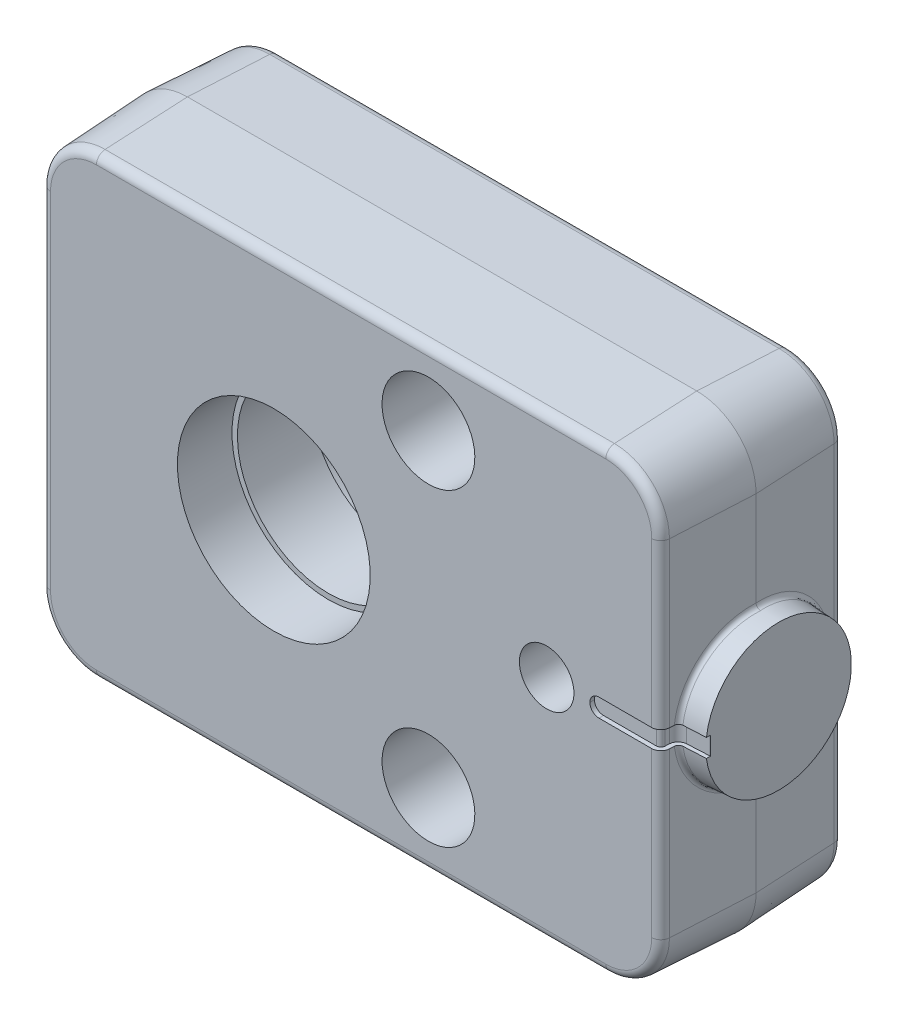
ISO-10303-21;
HEADER;
FILE_DESCRIPTION(('STEP AP214'),'2;1');
FILE_NAME('part.step','',(''),(''),'','','');
FILE_SCHEMA(('AUTOMOTIVE_DESIGN { 1 0 10303 214 1 1 1 1 }'));
ENDSEC;
DATA;
#1=APPLICATION_CONTEXT('core data for automotive mechanical design processes');
#2=APPLICATION_PROTOCOL_DEFINITION('international standard','automotive_design',2000,#1);
#3=PRODUCT_CONTEXT('',#1,'mechanical');
#4=PRODUCT('Part','Part','',(#3));
#5=PRODUCT_RELATED_PRODUCT_CATEGORY('part','',(#4));
#6=PRODUCT_DEFINITION_FORMATION('','',#4);
#7=PRODUCT_DEFINITION_CONTEXT('part definition',#1,'design');
#8=PRODUCT_DEFINITION('design','',#6,#7);
#9=PRODUCT_DEFINITION_SHAPE('','',#8);
#10=(LENGTH_UNIT() NAMED_UNIT(*) SI_UNIT(.MILLI.,.METRE.));
#11=(NAMED_UNIT(*) PLANE_ANGLE_UNIT() SI_UNIT($,.RADIAN.));
#12=(NAMED_UNIT(*) SI_UNIT($,.STERADIAN.) SOLID_ANGLE_UNIT());
#13=UNCERTAINTY_MEASURE_WITH_UNIT(LENGTH_MEASURE(1.E-05),#10,'distance_accuracy_value','');
#14=(GEOMETRIC_REPRESENTATION_CONTEXT(3) GLOBAL_UNCERTAINTY_ASSIGNED_CONTEXT((#13)) GLOBAL_UNIT_ASSIGNED_CONTEXT((#10,
#11,#12)) REPRESENTATION_CONTEXT('',''));
#15=CARTESIAN_POINT('',(0.,0.,0.));
#16=DIRECTION('',(0.,0.,1.));
#17=DIRECTION('',(1.,0.,0.));
#18=AXIS2_PLACEMENT_3D('',#15,#16,#17);
#19=CARTESIAN_POINT('',(-25.5,-25.,0.));
#20=DIRECTION('',(0.,0.,-1.));
#21=DIRECTION('',(0.,1.,0.));
#22=AXIS2_PLACEMENT_3D('',#19,#20,#21);
#23=PLANE('',#22);
#24=DIRECTION('',(1.,0.,0.));
#25=VECTOR('',#24,1.);
#26=CARTESIAN_POINT('',(-25.5,-24.0510354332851,0.));
#27=LINE('',#26,#25);
#28=CARTESIAN_POINT('',(36.5,-24.0510354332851,0.));
#29=VERTEX_POINT('',#28);
#30=CARTESIAN_POINT('',(-19.5,-24.0510354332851,0.));
#31=VERTEX_POINT('',#30);
#32=EDGE_CURVE('E271',#29,#31,#27,.F.);
#33=ORIENTED_EDGE('',*,*,#32,.T.);
#34=CARTESIAN_POINT('',(-19.5,-19.,0.));
#35=DIRECTION('',(0.,0.,-1.));
#36=DIRECTION('',(0.,1.,0.));
#37=AXIS2_PLACEMENT_3D('',#34,#35,#36);
#38=CIRCLE('',#37,5.05103543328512);
#39=CARTESIAN_POINT('',(-24.5510354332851,-19.,0.));
#40=VERTEX_POINT('',#39);
#41=EDGE_CURVE('E334',#31,#40,#38,.T.);
#42=ORIENTED_EDGE('',*,*,#41,.T.);
#43=DIRECTION('',(0.,-1.,0.));
#44=VECTOR('',#43,1.);
#45=CARTESIAN_POINT('',(-24.5510354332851,-25.,0.));
#46=LINE('',#45,#44);
#47=CARTESIAN_POINT('',(-24.5510354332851,19.,0.));
#48=VERTEX_POINT('',#47);
#49=EDGE_CURVE('E332',#40,#48,#46,.F.);
#50=ORIENTED_EDGE('',*,*,#49,.T.);
#51=CARTESIAN_POINT('',(-19.5,19.,0.));
#52=DIRECTION('',(0.,0.,-1.));
#53=DIRECTION('',(0.,1.,0.));
#54=AXIS2_PLACEMENT_3D('',#51,#52,#53);
#55=CIRCLE('',#54,5.05103543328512);
#56=CARTESIAN_POINT('',(-19.5,24.0510354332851,0.));
#57=VERTEX_POINT('',#56);
#58=EDGE_CURVE('E330',#48,#57,#55,.T.);
#59=ORIENTED_EDGE('',*,*,#58,.T.);
#60=DIRECTION('',(-1.,0.,0.));
#61=VECTOR('',#60,1.);
#62=CARTESIAN_POINT('',(-25.5,24.0510354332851,0.));
#63=LINE('',#62,#61);
#64=CARTESIAN_POINT('',(36.5,24.0510354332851,0.));
#65=VERTEX_POINT('',#64);
#66=EDGE_CURVE('E328',#57,#65,#63,.F.);
#67=ORIENTED_EDGE('',*,*,#66,.T.);
#68=CARTESIAN_POINT('',(36.5,19.,0.));
#69=DIRECTION('',(0.,0.,-1.));
#70=DIRECTION('',(0.,1.,0.));
#71=AXIS2_PLACEMENT_3D('',#68,#69,#70);
#72=CIRCLE('',#71,5.05103543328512);
#73=CARTESIAN_POINT('',(41.5510354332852,19.,0.));
#74=VERTEX_POINT('',#73);
#75=EDGE_CURVE('E326',#65,#74,#72,.T.);
#76=ORIENTED_EDGE('',*,*,#75,.T.);
#77=DIRECTION('',(0.,1.,0.));
#78=VECTOR('',#77,1.);
#79=CARTESIAN_POINT('',(41.5510354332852,-25.,0.));
#80=LINE('',#79,#78);
#81=CARTESIAN_POINT('',(41.5510354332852,-19.,0.));
#82=VERTEX_POINT('',#81);
#83=EDGE_CURVE('E324',#74,#82,#80,.F.);
#84=ORIENTED_EDGE('',*,*,#83,.T.);
#85=CARTESIAN_POINT('',(36.5,-19.,0.));
#86=DIRECTION('',(0.,0.,-1.));
#87=DIRECTION('',(0.,1.,0.));
#88=AXIS2_PLACEMENT_3D('',#85,#86,#87);
#89=CIRCLE('',#88,5.05103543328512);
#90=EDGE_CURVE('E322',#82,#29,#89,.T.);
#91=ORIENTED_EDGE('',*,*,#90,.T.);
#92=EDGE_LOOP('',(#33,#42,#50,#59,#67,#76,#84,#91));
#93=FACE_BOUND('',#92,.T.);
#94=CARTESIAN_POINT('',(17.,-17.,0.));
#95=DIRECTION('',(0.,0.,1.));
#96=DIRECTION('',(0.,-1.,0.));
#97=AXIS2_PLACEMENT_3D('',#94,#95,#96);
#98=CIRCLE('',#97,2.8);
#99=CARTESIAN_POINT('',(17.,-19.8,0.));
#100=VERTEX_POINT('',#99);
#101=EDGE_CURVE('E356',#100,#100,#98,.T.);
#102=ORIENTED_EDGE('',*,*,#101,.T.);
#103=EDGE_LOOP('',(#102));
#104=FACE_BOUND('',#103,.T.);
#105=CARTESIAN_POINT('',(17.,17.,0.));
#106=DIRECTION('',(0.,0.,1.));
#107=DIRECTION('',(0.,-1.,0.));
#108=AXIS2_PLACEMENT_3D('',#105,#106,#107);
#109=CIRCLE('',#108,2.8);
#110=CARTESIAN_POINT('',(17.,14.2,0.));
#111=VERTEX_POINT('',#110);
#112=EDGE_CURVE('E1329',#111,#111,#109,.T.);
#113=ORIENTED_EDGE('',*,*,#112,.T.);
#114=EDGE_LOOP('',(#113));
#115=FACE_BOUND('',#114,.T.);
#116=CARTESIAN_POINT('',(0.,0.,0.));
#117=DIRECTION('',(0.,0.,1.));
#118=DIRECTION('',(0.,-1.,0.));
#119=AXIS2_PLACEMENT_3D('',#116,#117,#118);
#120=CIRCLE('',#119,10.6);
#121=CARTESIAN_POINT('',(0.,-10.6,0.));
#122=VERTEX_POINT('',#121);
#123=EDGE_CURVE('E1306',#122,#122,#120,.T.);
#124=ORIENTED_EDGE('',*,*,#123,.T.);
#125=EDGE_LOOP('',(#124));
#126=FACE_BOUND('',#125,.T.);
#127=ADVANCED_FACE('F16',(#93,#104,#115,#126),#23,.T.);
#128=CARTESIAN_POINT('',(42.5,25.,20.));
#129=DIRECTION('',(0.998629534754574,0.,0.052335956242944));
#130=DIRECTION('',(-0.052335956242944,0.,0.998629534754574));
#131=AXIS2_PLACEMENT_3D('',#128,#129,#130);
#132=PLANE('',#131);
#133=DIRECTION('',(-0.052335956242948,0.,0.998629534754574));
#134=VECTOR('',#133,1.);
#135=CARTESIAN_POINT('',(42.5496649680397,1.,19.0523359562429));
#136=LINE('',#135,#134);
#137=CARTESIAN_POINT('',(42.5763358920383,1.,18.5434244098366));
#138=VERTEX_POINT('',#137);
#139=CARTESIAN_POINT('',(42.5496649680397,1.,19.0523359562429));
#140=VERTEX_POINT('',#139);
#141=EDGE_CURVE('E452',#138,#140,#136,.T.);
#142=ORIENTED_EDGE('',*,*,#141,.F.);
#143=CARTESIAN_POINT('',(43.0242106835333,0.,9.99746429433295));
#144=DIRECTION('',(0.998629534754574,0.,0.052335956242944));
#145=DIRECTION('',(-0.0523359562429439,0.,0.998629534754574));
#146=AXIS2_PLACEMENT_3D('',#143,#144,#145);
#147=ELLIPSE('',#146,8.61607684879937,8.60423636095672);
#148=CARTESIAN_POINT('',(43.0240777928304,8.60423598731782,10.));
#149=VERTEX_POINT('',#148);
#150=EDGE_CURVE('E605',#138,#149,#147,.F.);
#151=ORIENTED_EDGE('',*,*,#150,.T.);
#152=DIRECTION('',(0.,1.,0.));
#153=VECTOR('',#152,1.);
#154=CARTESIAN_POINT('',(43.0240777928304,25.,10.));
#155=LINE('',#154,#153);
#156=CARTESIAN_POINT('',(43.0240777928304,19.,10.));
#157=VERTEX_POINT('',#156);
#158=EDGE_CURVE('E258',#149,#157,#155,.T.);
#159=ORIENTED_EDGE('',*,*,#158,.T.);
#160=DIRECTION('',(0.0523359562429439,0.,-0.998629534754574));
#161=VECTOR('',#160,1.);
#162=CARTESIAN_POINT('',(42.5,19.,20.));
#163=LINE('',#162,#161);
#164=CARTESIAN_POINT('',(42.5496649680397,19.,19.0523359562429));
#165=VERTEX_POINT('',#164);
#166=EDGE_CURVE('E281',#157,#165,#163,.F.);
#167=ORIENTED_EDGE('',*,*,#166,.T.);
#168=DIRECTION('',(0.,1.,0.));
#169=VECTOR('',#168,1.);
#170=CARTESIAN_POINT('',(42.5496649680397,25.,19.0523359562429));
#171=LINE('',#170,#169);
#172=EDGE_CURVE('E642',#165,#140,#171,.F.);
#173=ORIENTED_EDGE('',*,*,#172,.T.);
#174=EDGE_LOOP('',(#142,#151,#159,#167,#173));
#175=FACE_BOUND('',#174,.T.);
#176=ADVANCED_FACE('F546',(#175),#132,.T.);
#177=CARTESIAN_POINT('',(-25.5,-25.,20.));
#178=DIRECTION('',(0.,0.,-1.));
#179=DIRECTION('',(0.,1.,0.));
#180=AXIS2_PLACEMENT_3D('',#177,#178,#179);
#181=PLANE('',#180);
#182=CARTESIAN_POINT('',(30.,0.,20.));
#183=DIRECTION('',(0.,0.,1.));
#184=DIRECTION('',(0.,-1.,0.));
#185=AXIS2_PLACEMENT_3D('',#182,#183,#184);
#186=CIRCLE('',#185,3.);
#187=CARTESIAN_POINT('',(30.,-3.,20.));
#188=VERTEX_POINT('',#187);
#189=EDGE_CURVE('E1301',#188,#188,#186,.T.);
#190=ORIENTED_EDGE('',*,*,#189,.F.);
#191=EDGE_LOOP('',(#190));
#192=FACE_BOUND('',#191,.T.);
#193=CARTESIAN_POINT('',(0.,0.,20.));
#194=DIRECTION('',(0.,0.,1.));
#195=DIRECTION('',(0.,-1.,0.));
#196=AXIS2_PLACEMENT_3D('',#193,#194,#195);
#197=CIRCLE('',#196,10.6);
#198=CARTESIAN_POINT('',(0.,-10.6,20.));
#199=VERTEX_POINT('',#198);
#200=EDGE_CURVE('E1312',#199,#199,#197,.T.);
#201=ORIENTED_EDGE('',*,*,#200,.F.);
#202=EDGE_LOOP('',(#201));
#203=FACE_BOUND('',#202,.T.);
#204=CARTESIAN_POINT('',(17.,17.,20.));
#205=DIRECTION('',(0.,0.,1.));
#206=DIRECTION('',(0.,-1.,0.));
#207=AXIS2_PLACEMENT_3D('',#204,#205,#206);
#208=CIRCLE('',#207,5.1);
#209=CARTESIAN_POINT('',(17.,11.9,20.));
#210=VERTEX_POINT('',#209);
#211=EDGE_CURVE('E1318',#210,#210,#208,.T.);
#212=ORIENTED_EDGE('',*,*,#211,.F.);
#213=EDGE_LOOP('',(#212));
#214=FACE_BOUND('',#213,.T.);
#215=CARTESIAN_POINT('',(17.,-17.,20.));
#216=DIRECTION('',(0.,0.,1.));
#217=DIRECTION('',(0.,-1.,0.));
#218=AXIS2_PLACEMENT_3D('',#215,#216,#217);
#219=CIRCLE('',#218,5.1);
#220=CARTESIAN_POINT('',(17.,-22.1,20.));
#221=VERTEX_POINT('',#220);
#222=EDGE_CURVE('E1332',#221,#221,#219,.T.);
#223=ORIENTED_EDGE('',*,*,#222,.F.);
#224=EDGE_LOOP('',(#223));
#225=FACE_BOUND('',#224,.T.);
#226=DIRECTION('',(-1.,0.,0.));
#227=VECTOR('',#226,1.);
#228=CARTESIAN_POINT('',(41.5510354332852,1.,20.));
#229=LINE('',#228,#227);
#230=CARTESIAN_POINT('',(41.5510354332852,1.,20.));
#231=VERTEX_POINT('',#230);
#232=CARTESIAN_POINT('',(35.75,1.,20.));
#233=VERTEX_POINT('',#232);
#234=EDGE_CURVE('E435',#231,#233,#229,.T.);
#235=ORIENTED_EDGE('',*,*,#234,.F.);
#236=DIRECTION('',(0.,-1.,0.));
#237=VECTOR('',#236,1.);
#238=CARTESIAN_POINT('',(41.5510354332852,-25.,20.));
#239=LINE('',#238,#237);
#240=CARTESIAN_POINT('',(41.5510354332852,19.,20.));
#241=VERTEX_POINT('',#240);
#242=EDGE_CURVE('E670',#231,#241,#239,.F.);
#243=ORIENTED_EDGE('',*,*,#242,.T.);
#244=CARTESIAN_POINT('',(36.5,19.,20.));
#245=DIRECTION('',(0.,0.,-1.));
#246=DIRECTION('',(0.,1.,0.));
#247=AXIS2_PLACEMENT_3D('',#244,#245,#246);
#248=CIRCLE('',#247,5.05103543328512);
#249=CARTESIAN_POINT('',(36.5,24.0510354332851,20.));
#250=VERTEX_POINT('',#249);
#251=EDGE_CURVE('E665',#241,#250,#248,.F.);
#252=ORIENTED_EDGE('',*,*,#251,.T.);
#253=DIRECTION('',(1.,0.,0.));
#254=VECTOR('',#253,1.);
#255=CARTESIAN_POINT('',(-25.5,24.0510354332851,20.));
#256=LINE('',#255,#254);
#257=CARTESIAN_POINT('',(-19.5,24.0510354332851,20.));
#258=VERTEX_POINT('',#257);
#259=EDGE_CURVE('E663',#250,#258,#256,.F.);
#260=ORIENTED_EDGE('',*,*,#259,.T.);
#261=CARTESIAN_POINT('',(-19.5,19.,20.));
#262=DIRECTION('',(0.,0.,-1.));
#263=DIRECTION('',(0.,1.,0.));
#264=AXIS2_PLACEMENT_3D('',#261,#262,#263);
#265=CIRCLE('',#264,5.05103543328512);
#266=CARTESIAN_POINT('',(-24.5510354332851,19.,20.));
#267=VERTEX_POINT('',#266);
#268=EDGE_CURVE('E661',#258,#267,#265,.F.);
#269=ORIENTED_EDGE('',*,*,#268,.T.);
#270=DIRECTION('',(0.,1.,0.));
#271=VECTOR('',#270,1.);
#272=CARTESIAN_POINT('',(-24.5510354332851,-25.,20.));
#273=LINE('',#272,#271);
#274=CARTESIAN_POINT('',(-24.5510354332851,-19.,20.));
#275=VERTEX_POINT('',#274);
#276=EDGE_CURVE('E659',#267,#275,#273,.F.);
#277=ORIENTED_EDGE('',*,*,#276,.T.);
#278=CARTESIAN_POINT('',(-19.5,-19.,20.));
#279=DIRECTION('',(0.,0.,-1.));
#280=DIRECTION('',(0.,1.,0.));
#281=AXIS2_PLACEMENT_3D('',#278,#279,#280);
#282=CIRCLE('',#281,5.05103543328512);
#283=CARTESIAN_POINT('',(-19.5,-24.0510354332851,20.));
#284=VERTEX_POINT('',#283);
#285=EDGE_CURVE('E656',#275,#284,#282,.F.);
#286=ORIENTED_EDGE('',*,*,#285,.T.);
#287=DIRECTION('',(-1.,0.,0.));
#288=VECTOR('',#287,1.);
#289=CARTESIAN_POINT('',(-25.5,-24.0510354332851,20.));
#290=LINE('',#289,#288);
#291=CARTESIAN_POINT('',(36.5,-24.0510354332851,20.));
#292=VERTEX_POINT('',#291);
#293=EDGE_CURVE('E673',#284,#292,#290,.F.);
#294=ORIENTED_EDGE('',*,*,#293,.T.);
#295=CARTESIAN_POINT('',(36.5,-19.,20.));
#296=DIRECTION('',(0.,0.,-1.));
#297=DIRECTION('',(0.,1.,0.));
#298=AXIS2_PLACEMENT_3D('',#295,#296,#297);
#299=CIRCLE('',#298,5.05103543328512);
#300=CARTESIAN_POINT('',(41.5510354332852,-19.,20.));
#301=VERTEX_POINT('',#300);
#302=EDGE_CURVE('E671',#292,#301,#299,.F.);
#303=ORIENTED_EDGE('',*,*,#302,.T.);
#304=CARTESIAN_POINT('',(41.5510354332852,-1.,20.));
#305=VERTEX_POINT('',#304);
#306=EDGE_CURVE('E667',#301,#305,#239,.F.);
#307=ORIENTED_EDGE('',*,*,#306,.T.);
#308=DIRECTION('',(-1.,0.,0.));
#309=VECTOR('',#308,1.);
#310=CARTESIAN_POINT('',(41.5510354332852,-1.,20.));
#311=LINE('',#310,#309);
#312=CARTESIAN_POINT('',(35.75,-1.,20.));
#313=VERTEX_POINT('',#312);
#314=EDGE_CURVE('E458',#305,#313,#311,.T.);
#315=ORIENTED_EDGE('',*,*,#314,.T.);
#316=CARTESIAN_POINT('',(35.75,0.,20.));
#317=DIRECTION('',(0.,0.,-1.));
#318=DIRECTION('',(0.,1.,0.));
#319=AXIS2_PLACEMENT_3D('',#316,#317,#318);
#320=CIRCLE('',#319,1.);
#321=CARTESIAN_POINT('',(34.75,0.,20.));
#322=VERTEX_POINT('',#321);
#323=EDGE_CURVE('E25',#313,#322,#320,.T.);
#324=ORIENTED_EDGE('',*,*,#323,.T.);
#325=CARTESIAN_POINT('',(35.75,0.,20.));
#326=DIRECTION('',(0.,0.,-1.));
#327=DIRECTION('',(0.,1.,0.));
#328=AXIS2_PLACEMENT_3D('',#325,#326,#327);
#329=CIRCLE('',#328,1.);
#330=EDGE_CURVE('E10',#322,#233,#329,.T.);
#331=ORIENTED_EDGE('',*,*,#330,.T.);
#332=EDGE_LOOP('',(#235,#243,#252,#260,#269,#277,#286,#294,#303,#307,#315,#324,#331));
#333=FACE_BOUND('',#332,.T.);
#334=ADVANCED_FACE('F573',(#192,#203,#214,#225,#333),#181,.F.);
#335=CARTESIAN_POINT('',(41.5510354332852,-25.,19.));
#336=DIRECTION('',(0.,-1.,0.));
#337=DIRECTION('',(0.,0.,-1.));
#338=AXIS2_PLACEMENT_3D('',#335,#336,#337);
#339=CYLINDRICAL_SURFACE('',#338,1.);
#340=ORIENTED_EDGE('',*,*,#242,.F.);
#341=CARTESIAN_POINT('',(41.5510354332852,1.,19.));
#342=DIRECTION('',(0.,-1.,0.));
#343=DIRECTION('',(0.,0.,-1.));
#344=AXIS2_PLACEMENT_3D('',#341,#342,#343);
#345=CIRCLE('',#344,1.);
#346=EDGE_CURVE('E433',#140,#231,#345,.T.);
#347=ORIENTED_EDGE('',*,*,#346,.F.);
#348=ORIENTED_EDGE('',*,*,#172,.F.);
#349=CARTESIAN_POINT('',(41.5510354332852,19.,19.));
#350=DIRECTION('',(0.,-1.,0.));
#351=DIRECTION('',(0.,0.,-1.));
#352=AXIS2_PLACEMENT_3D('',#349,#350,#351);
#353=CIRCLE('',#352,1.);
#354=EDGE_CURVE('E619',#165,#241,#353,.T.);
#355=ORIENTED_EDGE('',*,*,#354,.T.);
#356=EDGE_LOOP('',(#340,#347,#348,#355));
#357=FACE_BOUND('',#356,.T.);
#358=ADVANCED_FACE('F774',(#357),#339,.T.);
#359=CARTESIAN_POINT('',(43.0464268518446,0.,18.1285863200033));
#360=CARTESIAN_POINT('',(42.5968418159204,0.,18.152148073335));
#361=CARTESIAN_POINT('',(42.5732800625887,0.,18.6017331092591));
#362=CARTESIAN_POINT('',(43.0464268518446,-0.353705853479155,18.1285863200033));
#363=CARTESIAN_POINT('',(42.5968418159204,-0.355761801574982,18.152148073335));
#364=CARTESIAN_POINT('',(42.5732800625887,-0.37543294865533,18.6017331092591));
#365=CARTESIAN_POINT('',(43.0477164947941,-0.707411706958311,18.1053986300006));
#366=CARTESIAN_POINT('',(42.5980677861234,-0.711571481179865,18.128755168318));
#367=CARTESIAN_POINT('',(42.5745697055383,-0.750865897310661,18.577125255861));
#368=CARTESIAN_POINT('',(43.0528528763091,-1.40876818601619,18.0130472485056));
#369=CARTESIAN_POINT('',(42.6029489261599,-1.41695771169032,18.0356174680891));
#370=CARTESIAN_POINT('',(42.5797060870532,-1.49530783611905,18.4791172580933));
#371=CARTESIAN_POINT('',(43.0566997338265,-1.75641852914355,17.9438814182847));
#372=CARTESIAN_POINT('',(42.6066055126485,-1.76662652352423,17.965845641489));
#373=CARTESIAN_POINT('',(42.5835529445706,-1.86431652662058,18.4057148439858));
#374=CARTESIAN_POINT('',(43.0668846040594,-2.43971316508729,17.7607605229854));
#375=CARTESIAN_POINT('',(42.6162829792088,-2.45370866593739,17.7811885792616));
#376=CARTESIAN_POINT('',(42.5937378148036,-2.58959653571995,18.2113759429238));
#377=CARTESIAN_POINT('',(43.0732228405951,-2.77535637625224,17.6468014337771));
#378=CARTESIAN_POINT('',(42.6223065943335,-2.79120402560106,17.6662511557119));
#379=CARTESIAN_POINT('',(42.6000760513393,-2.94586670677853,18.0904351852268));
#380=CARTESIAN_POINT('',(43.088281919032,-3.428892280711,17.3760475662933));
#381=CARTESIAN_POINT('',(42.6366122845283,-3.44813745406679,17.3932823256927));
#382=CARTESIAN_POINT('',(42.6151351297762,-3.63957476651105,17.8030908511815));
#383=CARTESIAN_POINT('',(43.0970030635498,-3.74678271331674,17.2192473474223));
#384=CARTESIAN_POINT('',(42.6448982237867,-3.76764132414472,17.2351771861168));
#385=CARTESIAN_POINT('',(42.623856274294,-3.97701025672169,17.6366815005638));
#386=CARTESIAN_POINT('',(43.116678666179,-4.35937325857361,16.8654978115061));
#387=CARTESIAN_POINT('',(42.6635837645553,-4.38311160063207,16.8786358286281));
#388=CARTESIAN_POINT('',(42.6435318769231,-4.62727668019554,17.2612486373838));
#389=CARTESIAN_POINT('',(43.1276334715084,-4.6540697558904,16.6685422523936));
#390=CARTESIAN_POINT('',(42.6739880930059,-4.67912275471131,16.6801094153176));
#391=CARTESIAN_POINT('',(42.6544866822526,-4.94010377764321,17.052218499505));
#392=CARTESIAN_POINT('',(43.1515889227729,-5.21523029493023,16.2378554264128));
#393=CARTESIAN_POINT('',(42.6967292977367,-5.24254391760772,16.2461813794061));
#394=CARTESIAN_POINT('',(42.678442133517,-5.53580232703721,16.5951212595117));
#395=CARTESIAN_POINT('',(43.1645899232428,-5.48168943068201,16.0041177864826));
#396=CARTESIAN_POINT('',(42.7090714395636,-5.50997430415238,16.0106792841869));
#397=CARTESIAN_POINT('',(42.6914431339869,-5.81866857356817,16.3470473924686));
#398=CARTESIAN_POINT('',(43.1924153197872,-5.98181690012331,15.5038690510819));
#399=CARTESIAN_POINT('',(42.7354741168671,-6.01167368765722,15.5068861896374));
#400=CARTESIAN_POINT('',(42.7192685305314,-6.34960683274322,15.8161071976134));
#401=CARTESIAN_POINT('',(43.2072400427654,-6.21547933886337,15.2373520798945));
#402=CARTESIAN_POINT('',(42.7495400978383,-6.24593711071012,15.2384912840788));
#403=CARTESIAN_POINT('',(42.7340932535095,-6.59767259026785,15.5332346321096));
#404=CARTESIAN_POINT('',(43.238459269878,-6.64601665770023,14.6761071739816));
#405=CARTESIAN_POINT('',(42.7791471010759,-6.67732329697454,14.6735560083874));
#406=CARTESIAN_POINT('',(42.7653124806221,-7.05476633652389,14.9375362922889));
#407=CARTESIAN_POINT('',(43.2548540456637,-6.8428851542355,14.3813743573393));
#408=CARTESIAN_POINT('',(42.7946933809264,-6.87441478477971,14.3769153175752));
#409=CARTESIAN_POINT('',(42.7817072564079,-7.26378755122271,14.6247053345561));
#410=CARTESIAN_POINT('',(43.2889329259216,-7.19646760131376,13.7687423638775));
#411=CARTESIAN_POINT('',(42.8269927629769,-7.22812562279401,13.76060639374));
#412=CARTESIAN_POINT('',(42.8157861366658,-7.63921614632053,13.9744415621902));
#413=CARTESIAN_POINT('',(43.3066172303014,-7.35317530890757,13.4508395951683));
#414=CARTESIAN_POINT('',(42.8437505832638,-7.38469004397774,13.4408481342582));
#415=CARTESIAN_POINT('',(42.8334704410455,-7.80561690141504,13.637004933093));
#416=CARTESIAN_POINT('',(43.3429726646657,-7.62375638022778,12.7973081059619));
#417=CARTESIAN_POINT('',(42.8781846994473,-7.65471806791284,12.7838060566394));
#418=CARTESIAN_POINT('',(42.8698258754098,-8.09295704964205,12.9433019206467));
#419=CARTESIAN_POINT('',(43.3616439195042,-7.73762430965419,12.4616771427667));
#420=CARTESIAN_POINT('',(42.8958648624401,-7.76810677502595,12.4464484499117));
#421=CARTESIAN_POINT('',(42.8884971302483,-8.21389067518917,12.5870331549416));
#422=CARTESIAN_POINT('',(43.399653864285,-7.92057891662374,11.7784324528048));
#423=CARTESIAN_POINT('',(42.9318402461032,-7.94989981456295,11.7599972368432));
#424=CARTESIAN_POINT('',(42.9265070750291,-8.40822626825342,11.8617602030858));
#425=CARTESIAN_POINT('',(43.4189926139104,-7.98966157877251,11.4308176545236));
#426=CARTESIAN_POINT('',(42.9501382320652,-8.01821434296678,11.4108508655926));
#427=CARTESIAN_POINT('',(42.9458458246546,-8.4816239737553,11.4927548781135));
#428=CARTESIAN_POINT('',(43.4580067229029,-8.08186484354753,10.729553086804));
#429=CARTESIAN_POINT('',(42.9870360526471,-8.10874963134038,10.7067985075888));
#430=CARTESIAN_POINT('',(42.984859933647,-8.57963015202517,10.7483213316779));
#431=CARTESIAN_POINT('',(43.477682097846,-8.10498331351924,10.3759030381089));
#432=CARTESIAN_POINT('',(43.0056373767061,-8.13087175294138,10.3518641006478));
#433=CARTESIAN_POINT('',(43.0045353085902,-8.60423636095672,10.3728928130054));
#434=CARTESIAN_POINT('',(43.5170328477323,-8.10486364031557,9.66861869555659));
#435=CARTESIAN_POINT('',(43.042824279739,-8.12870239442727,9.64229572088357));
#436=CARTESIAN_POINT('',(43.0438860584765,-8.60423636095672,9.62203577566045));
#437=CARTESIAN_POINT('',(43.5367082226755,-8.08162549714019,9.31498440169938));
#438=CARTESIAN_POINT('',(43.0614099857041,-8.10431011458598,9.2876593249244));
#439=CARTESIAN_POINT('',(43.0635614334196,-8.57963015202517,9.24660725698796));
#440=CARTESIAN_POINT('',(43.575722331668,-7.98919104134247,8.61378178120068));
#441=CARTESIAN_POINT('',(43.0982491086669,-8.00958335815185,8.58472698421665));
#442=CARTESIAN_POINT('',(43.1025755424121,-8.4816239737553,8.50217371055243));
#443=CARTESIAN_POINT('',(43.5950610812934,-7.91999686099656,8.26621317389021));
#444=CARTESIAN_POINT('',(43.1165012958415,-7.93915274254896,8.23645450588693));
#445=CARTESIAN_POINT('',(43.1219142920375,-8.40822626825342,8.13316838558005));
#446=CARTESIAN_POINT('',(43.6330710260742,-7.73683497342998,7.58308815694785));
#447=CARTESIAN_POINT('',(43.152363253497,-7.7536001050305,7.55216758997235));
#448=CARTESIAN_POINT('',(43.1599242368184,-8.21389067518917,7.40789543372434));
#449=CARTESIAN_POINT('',(43.6517422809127,-7.62287128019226,7.24753067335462));
#450=CARTESIAN_POINT('',(43.1699705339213,-7.63839312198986,7.21620066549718));
#451=CARTESIAN_POINT('',(43.1785954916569,-8.09295704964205,7.0516266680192));
#452=CARTESIAN_POINT('',(43.688097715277,-7.35212096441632,6.59416842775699));
#453=CARTESIAN_POINT('',(43.2042441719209,-7.36529299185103,6.56222069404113));
#454=CARTESIAN_POINT('',(43.2149509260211,-7.80561690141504,6.35792365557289));
#455=CARTESIAN_POINT('',(43.7057820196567,-7.19533977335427,6.27636142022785));
#456=CARTESIAN_POINT('',(43.2209069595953,-7.2073318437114,6.24427576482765));
#457=CARTESIAN_POINT('',(43.2326352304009,-7.63921614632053,6.02048702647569));
#458=CARTESIAN_POINT('',(43.7398608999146,-6.84163765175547,5.66393670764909));
#459=CARTESIAN_POINT('',(43.2530096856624,-6.85144575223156,5.63171926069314));
#460=CARTESIAN_POINT('',(43.2667141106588,-7.26378755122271,5.37022325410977));
#461=CARTESIAN_POINT('',(43.7562556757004,-6.64472295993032,5.36931540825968));
#462=CARTESIAN_POINT('',(43.2684452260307,-6.65347443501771,5.3371916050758));
#463=CARTESIAN_POINT('',(43.2831088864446,-7.05476633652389,5.05739229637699));
#464=CARTESIAN_POINT('',(43.787474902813,-6.21412369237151,4.80830169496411));
#465=CARTESIAN_POINT('',(43.2978327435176,-6.22095868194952,4.77644436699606));
#466=CARTESIAN_POINT('',(43.3143281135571,-6.59767259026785,4.46169395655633));
#467=CARTESIAN_POINT('',(43.8022996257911,-5.98044549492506,4.54190439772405));
#468=CARTESIAN_POINT('',(43.311779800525,-5.98639274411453,4.51031866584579));
#469=CARTESIAN_POINT('',(43.3291528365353,-6.34960683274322,4.1788213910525));
#470=CARTESIAN_POINT('',(43.8301250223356,-5.48031802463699,4.04189501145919));
#471=CARTESIAN_POINT('',(43.3379550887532,-5.48468748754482,4.01086441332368));
#472=CARTESIAN_POINT('',(43.3569782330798,-5.81866857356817,3.64788119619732));
#473=CARTESIAN_POINT('',(43.8431260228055,-5.21387464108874,3.80827704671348));
#474=CARTESIAN_POINT('',(43.3501782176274,-5.21755314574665,3.77763322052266));
#475=CARTESIAN_POINT('',(43.3699792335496,-5.53580232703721,3.39980732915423));
#476=CARTESIAN_POINT('',(43.8670814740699,-4.65277604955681,3.37782141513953));
#477=CARTESIAN_POINT('',(43.3726996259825,-4.65525139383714,3.34789914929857));
#478=CARTESIAN_POINT('',(43.3939346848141,-4.94010377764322,2.94271008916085));
#479=CARTESIAN_POINT('',(43.8780362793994,-4.35812574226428,3.18097737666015));
#480=CARTESIAN_POINT('',(43.3829929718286,-4.36011529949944,3.15149041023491));
#481=CARTESIAN_POINT('',(43.4048894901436,-4.62727668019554,2.73367995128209));
#482=CARTESIAN_POINT('',(43.8977118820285,-3.74565487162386,2.82743512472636));
#483=CARTESIAN_POINT('',(43.4014813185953,-3.74681446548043,2.79871173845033));
#484=CARTESIAN_POINT('',(43.4245650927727,-3.97701025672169,2.35824708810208));
#485=CARTESIAN_POINT('',(43.9064330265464,-3.42783791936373,2.67073067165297));
#486=CARTESIAN_POINT('',(43.4096718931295,-3.42870549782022,2.64242626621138));
#487=CARTESIAN_POINT('',(43.4332862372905,-3.63957476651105,2.19183773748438));
#488=CARTESIAN_POINT('',(43.9214921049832,-2.77447126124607,2.40014605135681));
#489=CARTESIAN_POINT('',(43.4238164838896,-2.77484429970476,2.37253139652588));
#490=CARTESIAN_POINT('',(43.4483453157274,-2.94586670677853,1.90449340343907));
#491=CARTESIAN_POINT('',(43.9278303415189,-2.43892381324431,2.28626044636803));
#492=CARTESIAN_POINT('',(43.4297668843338,-2.43916879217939,2.25899099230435));
#493=CARTESIAN_POINT('',(43.4546835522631,-2.58959653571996,1.78355264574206));
#494=CARTESIAN_POINT('',(43.9380152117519,-1.75583646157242,2.10325922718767));
#495=CARTESIAN_POINT('',(43.4393303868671,-1.75585230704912,2.07650849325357));
#496=CARTESIAN_POINT('',(43.4648684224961,-1.86431652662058,1.58921374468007));
#497=CARTESIAN_POINT('',(43.9418620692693,-1.40829763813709,2.03413959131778));
#498=CARTESIAN_POINT('',(43.4429409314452,-1.40830410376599,2.00761519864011));
#499=CARTESIAN_POINT('',(43.4687152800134,-1.49530783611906,1.51581133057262));
#500=CARTESIAN_POINT('',(43.9469984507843,-0.707172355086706,1.94185015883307));
#501=CARTESIAN_POINT('',(43.4477630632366,-0.707119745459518,1.91560344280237));
#502=CARTESIAN_POINT('',(43.4738516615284,-0.750865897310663,1.41780333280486));
#503=CARTESIAN_POINT('',(43.9482880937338,-0.353586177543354,1.91867822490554));
#504=CARTESIAN_POINT('',(43.4489733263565,-0.353586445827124,1.89251024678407));
#505=CARTESIAN_POINT('',(43.475141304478,-0.375432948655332,1.39319547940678));
#506=CARTESIAN_POINT('',(43.9482880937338,0.353586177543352,1.91867822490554));
#507=CARTESIAN_POINT('',(43.4489733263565,0.353586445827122,1.89251024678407));
#508=CARTESIAN_POINT('',(43.475141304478,0.37543294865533,1.39319547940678));
#509=CARTESIAN_POINT('',(43.9469984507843,0.707172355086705,1.94185015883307));
#510=CARTESIAN_POINT('',(43.4477630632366,0.707119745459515,1.91560344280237));
#511=CARTESIAN_POINT('',(43.4738516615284,0.750865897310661,1.41780333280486));
#512=CARTESIAN_POINT('',(43.9418620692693,1.40829763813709,2.03413959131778));
#513=CARTESIAN_POINT('',(43.4429409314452,1.40830410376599,2.00761519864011));
#514=CARTESIAN_POINT('',(43.4687152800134,1.49530783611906,1.51581133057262));
#515=CARTESIAN_POINT('',(43.9380152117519,1.75583646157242,2.10325922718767));
#516=CARTESIAN_POINT('',(43.4393303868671,1.75585230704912,2.07650849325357));
#517=CARTESIAN_POINT('',(43.4648684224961,1.86431652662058,1.58921374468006));
#518=CARTESIAN_POINT('',(43.9278303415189,2.43892381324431,2.28626044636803));
#519=CARTESIAN_POINT('',(43.4297668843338,2.43916879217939,2.25899099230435));
#520=CARTESIAN_POINT('',(43.4546835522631,2.58959653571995,1.78355264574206));
#521=CARTESIAN_POINT('',(43.9214921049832,2.77447126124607,2.40014605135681));
#522=CARTESIAN_POINT('',(43.4238164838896,2.77484429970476,2.37253139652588));
#523=CARTESIAN_POINT('',(43.4483453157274,2.94586670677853,1.90449340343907));
#524=CARTESIAN_POINT('',(43.9064330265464,3.42783791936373,2.67073067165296));
#525=CARTESIAN_POINT('',(43.4096718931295,3.42870549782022,2.64242626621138));
#526=CARTESIAN_POINT('',(43.4332862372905,3.63957476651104,2.19183773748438));
#527=CARTESIAN_POINT('',(43.8977118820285,3.74565487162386,2.82743512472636));
#528=CARTESIAN_POINT('',(43.4014813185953,3.74681446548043,2.79871173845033));
#529=CARTESIAN_POINT('',(43.4245650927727,3.97701025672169,2.35824708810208));
#530=CARTESIAN_POINT('',(43.8780362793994,4.35812574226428,3.18097737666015));
#531=CARTESIAN_POINT('',(43.3829929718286,4.36011529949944,3.15149041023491));
#532=CARTESIAN_POINT('',(43.4048894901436,4.62727668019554,2.73367995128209));
#533=CARTESIAN_POINT('',(43.8670814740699,4.6527760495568,3.37782141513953));
#534=CARTESIAN_POINT('',(43.3726996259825,4.65525139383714,3.34789914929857));
#535=CARTESIAN_POINT('',(43.3939346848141,4.94010377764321,2.94271008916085));
#536=CARTESIAN_POINT('',(43.8431260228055,5.21387464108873,3.80827704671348));
#537=CARTESIAN_POINT('',(43.3501782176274,5.21755314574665,3.77763322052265));
#538=CARTESIAN_POINT('',(43.3699792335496,5.53580232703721,3.39980732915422));
#539=CARTESIAN_POINT('',(43.8301250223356,5.48031802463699,4.04189501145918));
#540=CARTESIAN_POINT('',(43.3379550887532,5.48468748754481,4.01086441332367));
#541=CARTESIAN_POINT('',(43.3569782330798,5.81866857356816,3.64788119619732));
#542=CARTESIAN_POINT('',(43.8022996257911,5.98044549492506,4.54190439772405));
#543=CARTESIAN_POINT('',(43.311779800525,5.98639274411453,4.51031866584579));
#544=CARTESIAN_POINT('',(43.3291528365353,6.34960683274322,4.1788213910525));
#545=CARTESIAN_POINT('',(43.787474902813,6.21412369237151,4.8083016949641));
#546=CARTESIAN_POINT('',(43.2978327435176,6.22095868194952,4.77644436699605));
#547=CARTESIAN_POINT('',(43.3143281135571,6.59767259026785,4.46169395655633));
#548=CARTESIAN_POINT('',(43.7562556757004,6.64472295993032,5.36931540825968));
#549=CARTESIAN_POINT('',(43.2684452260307,6.65347443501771,5.3371916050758));
#550=CARTESIAN_POINT('',(43.2831088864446,7.05476633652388,5.05739229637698));
#551=CARTESIAN_POINT('',(43.7398608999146,6.84163765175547,5.66393670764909));
#552=CARTESIAN_POINT('',(43.2530096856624,6.85144575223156,5.63171926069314));
#553=CARTESIAN_POINT('',(43.2667141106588,7.26378755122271,5.37022325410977));
#554=CARTESIAN_POINT('',(43.7057820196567,7.19533977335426,6.27636142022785));
#555=CARTESIAN_POINT('',(43.2209069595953,7.2073318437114,6.24427576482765));
#556=CARTESIAN_POINT('',(43.2326352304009,7.63921614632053,6.02048702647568));
#557=CARTESIAN_POINT('',(43.688097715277,7.35212096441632,6.59416842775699));
#558=CARTESIAN_POINT('',(43.2042441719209,7.36529299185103,6.56222069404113));
#559=CARTESIAN_POINT('',(43.2149509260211,7.80561690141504,6.35792365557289));
#560=CARTESIAN_POINT('',(43.6517422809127,7.62287128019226,7.24753067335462));
#561=CARTESIAN_POINT('',(43.1699705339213,7.63839312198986,7.21620066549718));
#562=CARTESIAN_POINT('',(43.1785954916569,8.09295704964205,7.0516266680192));
#563=CARTESIAN_POINT('',(43.6330710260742,7.73683497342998,7.58308815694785));
#564=CARTESIAN_POINT('',(43.152363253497,7.7536001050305,7.55216758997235));
#565=CARTESIAN_POINT('',(43.1599242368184,8.21389067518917,7.40789543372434));
#566=CARTESIAN_POINT('',(43.5950610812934,7.91999686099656,8.26621317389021));
#567=CARTESIAN_POINT('',(43.1165012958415,7.93915274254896,8.23645450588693));
#568=CARTESIAN_POINT('',(43.1219142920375,8.40822626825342,8.13316838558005));
#569=CARTESIAN_POINT('',(43.575722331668,7.98919104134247,8.61378178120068));
#570=CARTESIAN_POINT('',(43.0982491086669,8.00958335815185,8.58472698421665));
#571=CARTESIAN_POINT('',(43.1025755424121,8.4816239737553,8.50217371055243));
#572=CARTESIAN_POINT('',(43.5367082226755,8.08162549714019,9.31498440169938));
#573=CARTESIAN_POINT('',(43.0614099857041,8.10431011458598,9.2876593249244));
#574=CARTESIAN_POINT('',(43.0635614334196,8.57963015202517,9.24660725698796));
#575=CARTESIAN_POINT('',(43.5170328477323,8.10486364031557,9.66861869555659));
#576=CARTESIAN_POINT('',(43.042824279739,8.12870239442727,9.64229572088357));
#577=CARTESIAN_POINT('',(43.0438860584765,8.60423636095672,9.62203577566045));
#578=CARTESIAN_POINT('',(43.477682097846,8.10498331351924,10.3759030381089));
#579=CARTESIAN_POINT('',(43.0056373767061,8.13087175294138,10.3518641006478));
#580=CARTESIAN_POINT('',(43.0045353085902,8.60423636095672,10.3728928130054));
#581=CARTESIAN_POINT('',(43.4580067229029,8.08186484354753,10.729553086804));
#582=CARTESIAN_POINT('',(42.9870360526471,8.10874963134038,10.7067985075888));
#583=CARTESIAN_POINT('',(42.984859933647,8.57963015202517,10.7483213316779));
#584=CARTESIAN_POINT('',(43.4189926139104,7.98966157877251,11.4308176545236));
#585=CARTESIAN_POINT('',(42.9501382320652,8.01821434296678,11.4108508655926));
#586=CARTESIAN_POINT('',(42.9458458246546,8.4816239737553,11.4927548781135));
#587=CARTESIAN_POINT('',(43.399653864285,7.92057891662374,11.7784324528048));
#588=CARTESIAN_POINT('',(42.9318402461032,7.94989981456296,11.7599972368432));
#589=CARTESIAN_POINT('',(42.9265070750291,8.40822626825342,11.8617602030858));
#590=CARTESIAN_POINT('',(43.3616439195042,7.73762430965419,12.4616771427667));
#591=CARTESIAN_POINT('',(42.8958648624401,7.76810677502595,12.4464484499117));
#592=CARTESIAN_POINT('',(42.8884971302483,8.21389067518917,12.5870331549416));
#593=CARTESIAN_POINT('',(43.3429726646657,7.62375638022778,12.7973081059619));
#594=CARTESIAN_POINT('',(42.8781846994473,7.65471806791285,12.7838060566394));
#595=CARTESIAN_POINT('',(42.8698258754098,8.09295704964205,12.9433019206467));
#596=CARTESIAN_POINT('',(43.3066172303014,7.35317530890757,13.4508395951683));
#597=CARTESIAN_POINT('',(42.8437505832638,7.38469004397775,13.4408481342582));
#598=CARTESIAN_POINT('',(42.8334704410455,7.80561690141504,13.637004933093));
#599=CARTESIAN_POINT('',(43.2889329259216,7.19646760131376,13.7687423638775));
#600=CARTESIAN_POINT('',(42.8269927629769,7.22812562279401,13.76060639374));
#601=CARTESIAN_POINT('',(42.8157861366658,7.63921614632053,13.9744415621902));
#602=CARTESIAN_POINT('',(43.2548540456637,6.8428851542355,14.3813743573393));
#603=CARTESIAN_POINT('',(42.7946933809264,6.87441478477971,14.3769153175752));
#604=CARTESIAN_POINT('',(42.7817072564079,7.26378755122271,14.6247053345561));
#605=CARTESIAN_POINT('',(43.238459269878,6.64601665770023,14.6761071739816));
#606=CARTESIAN_POINT('',(42.7791471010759,6.67732329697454,14.6735560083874));
#607=CARTESIAN_POINT('',(42.7653124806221,7.05476633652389,14.9375362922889));
#608=CARTESIAN_POINT('',(43.2072400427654,6.21547933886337,15.2373520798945));
#609=CARTESIAN_POINT('',(42.7495400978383,6.24593711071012,15.2384912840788));
#610=CARTESIAN_POINT('',(42.7340932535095,6.59767259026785,15.5332346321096));
#611=CARTESIAN_POINT('',(43.1924153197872,5.98181690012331,15.5038690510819));
#612=CARTESIAN_POINT('',(42.7354741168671,6.01167368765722,15.5068861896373));
#613=CARTESIAN_POINT('',(42.7192685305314,6.34960683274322,15.8161071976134));
#614=CARTESIAN_POINT('',(43.1645899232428,5.48168943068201,16.0041177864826));
#615=CARTESIAN_POINT('',(42.7090714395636,5.50997430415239,16.0106792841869));
#616=CARTESIAN_POINT('',(42.6914431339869,5.81866857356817,16.3470473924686));
#617=CARTESIAN_POINT('',(43.1515889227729,5.21523029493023,16.2378554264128));
#618=CARTESIAN_POINT('',(42.6967292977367,5.24254391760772,16.2461813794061));
#619=CARTESIAN_POINT('',(42.678442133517,5.53580232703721,16.5951212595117));
#620=CARTESIAN_POINT('',(43.1276334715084,4.6540697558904,16.6685422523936));
#621=CARTESIAN_POINT('',(42.6739880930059,4.67912275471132,16.6801094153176));
#622=CARTESIAN_POINT('',(42.6544866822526,4.94010377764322,17.052218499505));
#623=CARTESIAN_POINT('',(43.116678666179,4.35937325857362,16.8654978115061));
#624=CARTESIAN_POINT('',(42.6635837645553,4.38311160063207,16.8786358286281));
#625=CARTESIAN_POINT('',(42.6435318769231,4.62727668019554,17.2612486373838));
#626=CARTESIAN_POINT('',(43.0970030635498,3.74678271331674,17.2192473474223));
#627=CARTESIAN_POINT('',(42.6448982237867,3.76764132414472,17.2351771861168));
#628=CARTESIAN_POINT('',(42.623856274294,3.97701025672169,17.6366815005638));
#629=CARTESIAN_POINT('',(43.088281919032,3.428892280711,17.3760475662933));
#630=CARTESIAN_POINT('',(42.6366122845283,3.44813745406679,17.3932823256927));
#631=CARTESIAN_POINT('',(42.6151351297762,3.63957476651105,17.8030908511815));
#632=CARTESIAN_POINT('',(43.0732228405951,2.77535637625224,17.6468014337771));
#633=CARTESIAN_POINT('',(42.6223065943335,2.79120402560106,17.6662511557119));
#634=CARTESIAN_POINT('',(42.6000760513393,2.94586670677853,18.0904351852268));
#635=CARTESIAN_POINT('',(43.0668846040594,2.43971316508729,17.7607605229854));
#636=CARTESIAN_POINT('',(42.6162829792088,2.4537086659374,17.7811885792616));
#637=CARTESIAN_POINT('',(42.5937378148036,2.58959653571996,18.2113759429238));
#638=CARTESIAN_POINT('',(43.0566997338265,1.75641852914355,17.9438814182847));
#639=CARTESIAN_POINT('',(42.6066055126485,1.76662652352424,17.965845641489));
#640=CARTESIAN_POINT('',(42.5835529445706,1.86431652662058,18.4057148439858));
#641=CARTESIAN_POINT('',(43.0528528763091,1.40876818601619,18.0130472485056));
#642=CARTESIAN_POINT('',(42.6029489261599,1.41695771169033,18.0356174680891));
#643=CARTESIAN_POINT('',(42.5797060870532,1.49530783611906,18.4791172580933));
#644=CARTESIAN_POINT('',(43.0477164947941,0.707411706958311,18.1053986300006));
#645=CARTESIAN_POINT('',(42.5980677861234,0.711571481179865,18.128755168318));
#646=CARTESIAN_POINT('',(42.5745697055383,0.750865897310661,18.577125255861));
#647=CARTESIAN_POINT('',(43.0464268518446,0.353705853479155,18.1285863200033));
#648=CARTESIAN_POINT('',(42.5968418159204,0.355761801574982,18.152148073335));
#649=CARTESIAN_POINT('',(42.5732800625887,0.37543294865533,18.6017331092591));
#650=CARTESIAN_POINT('',(43.0464268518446,0.,18.1285863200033));
#651=CARTESIAN_POINT('',(42.5968418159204,0.,18.152148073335));
#652=CARTESIAN_POINT('',(42.5732800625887,0.,18.6017331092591));
#653=(BOUNDED_SURFACE() B_SPLINE_SURFACE(3,2,((#359,#360,#361),(#362,#363,#364),(#365,#366,
#367),(#368,#369,#370),(#371,#372,#373),(#374,#375,#376),(#377,#378,#379),(#380,#381,#382),
(#383,#384,#385),(#386,#387,#388),(#389,#390,#391),(#392,#393,#394),(#395,#396,#397),(#398,#399,
#400),(#401,#402,#403),(#404,#405,#406),(#407,#408,#409),(#410,#411,#412),(#413,#414,#415),
(#416,#417,#418),(#419,#420,#421),(#422,#423,#424),(#425,#426,#427),(#428,#429,#430),(#431,#432,
#433),(#434,#435,#436),(#437,#438,#439),(#440,#441,#442),(#443,#444,#445),(#446,#447,#448),
(#449,#450,#451),(#452,#453,#454),(#455,#456,#457),(#458,#459,#460),(#461,#462,#463),(#464,#465,
#466),(#467,#468,#469),(#470,#471,#472),(#473,#474,#475),(#476,#477,#478),(#479,#480,#481),
(#482,#483,#484),(#485,#486,#487),(#488,#489,#490),(#491,#492,#493),(#494,#495,#496),(#497,#498,
#499),(#500,#501,#502),(#503,#504,#505),(#506,#507,#508),(#509,#510,#511),(#512,#513,#514),
(#515,#516,#517),(#518,#519,#520),(#521,#522,#523),(#524,#525,#526),(#527,#528,#529),(#530,#531,
#532),(#533,#534,#535),(#536,#537,#538),(#539,#540,#541),(#542,#543,#544),(#545,#546,#547),
(#548,#549,#550),(#551,#552,#553),(#554,#555,#556),(#557,#558,#559),(#560,#561,#562),(#563,#564,
#565),(#566,#567,#568),(#569,#570,#571),(#572,#573,#574),(#575,#576,#577),(#578,#579,#580),
(#581,#582,#583),(#584,#585,#586),(#587,#588,#589),(#590,#591,#592),(#593,#594,#595),(#596,#597,
#598),(#599,#600,#601),(#602,#603,#604),(#605,#606,#607),(#608,#609,#610),(#611,#612,#613),
(#614,#615,#616),(#617,#618,#619),(#620,#621,#622),(#623,#624,#625),(#626,#627,#628),(#629,#630,
#631),(#632,#633,#634),(#635,#636,#637),(#638,#639,#640),(#641,#642,#643),(#644,#645,#646),
(#647,#648,#649),(#650,#651,#652)),.UNSPECIFIED.,.T.,.F.,.F.) B_SPLINE_SURFACE_WITH_KNOTS((4,2,
2,2,2,2,2,2,2,2,2,2,2,2,2,2,2,2,2,2,2,2,2,2,2,2,2,2,2,2,2,2,2,2,2,2,2,2,2,2,2,2,2,2,2,2,2,2,4),
(3,3),(0.,1.12549459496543,2.25104154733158,3.37668963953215,4.502480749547,5.62844699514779,
6.75460854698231,7.88097225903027,9.00753120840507,10.1342651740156,11.2611420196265,
12.3881198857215,13.5151500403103,14.6421801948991,15.7691580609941,16.896034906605,
18.0227688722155,19.1493278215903,20.2756915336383,21.4018530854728,22.5278193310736,
23.6536104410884,24.779258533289,25.9048054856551,27.0303000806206,28.155794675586,
29.2813416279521,30.4069897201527,31.5327808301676,32.6587470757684,33.7849086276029,
34.9112723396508,36.0378312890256,37.1645652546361,38.2914421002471,39.4184199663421,
40.5454501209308,41.6724802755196,42.7994581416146,43.9263349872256,45.053068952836,
46.1796279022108,47.3059916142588,48.4321531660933,49.5581194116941,50.683910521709,
51.8095586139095,52.9351055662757,54.0606001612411),(0.,1.),
.UNSPECIFIED.) GEOMETRIC_REPRESENTATION_ITEM() RATIONAL_B_SPLINE_SURFACE(((1.,0.743144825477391,
1.),(1.,0.743144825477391,1.),(1.,0.743094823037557,1.),(1.,0.742895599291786,1.),(1.,
0.74274637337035,1.),(1.,0.742351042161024,1.),(1.,0.742104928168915,1.),(1.,0.741519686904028,
1.),(1.,0.741180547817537,1.),(1.,0.74041460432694,1.),(1.,0.739987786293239,1.),(1.,
0.739053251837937,1.),(1.,0.738545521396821,1.),(1.,0.737457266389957,1.),(1.,0.736876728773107,
1.),(1.,0.735652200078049,1.),(1.,0.735008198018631,1.),(1.,0.733667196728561,1.),(1.,
0.732970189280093,1.),(1.,0.731534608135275,1.),(1.,0.73079602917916,1.),(1.,0.729289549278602,
1.),(1.,0.728521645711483,1.),(1.,0.726969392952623,1.),(1.,0.726185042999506,1.),(1.,
0.724613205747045,1.),(1.,0.723825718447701,1.),(1.,0.722261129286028,1.),(1.,0.721484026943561,
1.),(1.,0.719953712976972,1.),(1.,0.719200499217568,1.),(1.,0.717731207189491,1.),(1.,
0.717015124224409,1.),(1.,0.715632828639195,1.),(1.,0.71496660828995,1.),(1.,0.713696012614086,
1.),(1.,0.713091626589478,1.),(1.,0.711955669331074,1.),(1.,0.711424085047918,1.),(1.,
0.710443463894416,1.),(1.,0.70999441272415,1.),(1.,0.709187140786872,1.),(1.,0.708828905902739,
1.),(1.,0.708209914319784,1.),(1.,0.707949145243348,1.),(1.,0.707529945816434,1.),(1.,
0.707371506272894,1.),(1.,0.707159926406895,1.),(1.,0.707106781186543,1.),(1.,0.707106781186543,
1.),(1.,0.707159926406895,1.),(1.,0.707371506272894,1.),(1.,0.707529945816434,1.),(1.,
0.707949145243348,1.),(1.,0.708209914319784,1.),(1.,0.708828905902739,1.),(1.,0.709187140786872,
1.),(1.,0.70999441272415,1.),(1.,0.710443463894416,1.),(1.,0.711424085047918,1.),(1.,
0.711955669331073,1.),(1.,0.713091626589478,1.),(1.,0.713696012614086,1.),(1.,0.71496660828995,
1.),(1.,0.715632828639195,1.),(1.,0.717015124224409,1.),(1.,0.717731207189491,1.),(1.,
0.719200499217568,1.),(1.,0.719953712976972,1.),(1.,0.721484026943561,1.),(1.,0.722261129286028,
1.),(1.,0.723825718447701,1.),(1.,0.724613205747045,1.),(1.,0.726185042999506,1.),(1.,
0.726969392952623,1.),(1.,0.728521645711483,1.),(1.,0.729289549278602,1.),(1.,0.73079602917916,
1.),(1.,0.731534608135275,1.),(1.,0.732970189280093,1.),(1.,0.733667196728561,1.),(1.,
0.735008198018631,1.),(1.,0.735652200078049,1.),(1.,0.736876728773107,1.),(1.,0.737457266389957,
1.),(1.,0.738545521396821,1.),(1.,0.739053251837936,1.),(1.,0.739987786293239,1.),(1.,
0.74041460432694,1.),(1.,0.741180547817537,1.),(1.,0.741519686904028,1.),(1.,0.742104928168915,
1.),(1.,0.742351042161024,1.),(1.,0.74274637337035,1.),(1.,0.742895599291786,1.),(1.,
0.743094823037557,1.),(1.,0.743144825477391,1.),(1.,0.743144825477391,1.))) REPRESENTATION_ITEM('') SURFACE());
#654=CARTESIAN_POINT('',(43.0498711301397,1.,18.0666586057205));
#655=CARTESIAN_POINT('',(43.0218935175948,1.,18.0681108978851));
#656=CARTESIAN_POINT('',(42.9940528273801,1.,18.071979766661));
#657=CARTESIAN_POINT('',(42.9394382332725,1.,18.0843193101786));
#658=CARTESIAN_POINT('',(42.9126632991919,1.,18.0927854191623));
#659=CARTESIAN_POINT('',(42.8609049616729,1.,18.1140958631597));
#660=CARTESIAN_POINT('',(42.835922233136,1.,18.1269418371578));
#661=CARTESIAN_POINT('',(42.7884600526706,1.,18.156624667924));
#662=CARTESIAN_POINT('',(42.7659801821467,1.,18.1734608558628));
#663=CARTESIAN_POINT('',(42.7240498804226,1.,18.2107184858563));
#664=CARTESIAN_POINT('',(42.7046125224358,1.,18.23115463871));
#665=CARTESIAN_POINT('',(42.6694072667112,1.,18.2749890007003));
#666=CARTESIAN_POINT('',(42.6536410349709,1.,18.2983885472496));
#667=CARTESIAN_POINT('',(42.6261083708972,1.,18.3476702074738));
#668=CARTESIAN_POINT('',(42.6143737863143,1.,18.3735701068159));
#669=CARTESIAN_POINT('',(42.5954144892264,1.,18.4269347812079));
#670=CARTESIAN_POINT('',(42.5881835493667,1.,18.4543973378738));
#671=CARTESIAN_POINT('',(42.5797276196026,1.,18.5024880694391));
#672=CARTESIAN_POINT('',(42.5773999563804,1.,18.522927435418));
#673=CARTESIAN_POINT('',(42.5763358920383,1.,18.5434244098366));
#674=B_SPLINE_CURVE_WITH_KNOTS('',3,(#654,#655,#656,#657,#658,#659,#660,#661,#662,#663,#664,
#665,#666,#667,#668,#669,#670,#671,#672,#673),.UNSPECIFIED.,.F.,.F.,(4,2,2,2,2,2,2,2,2,4),(0.,
0.0839299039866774,0.167776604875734,0.25165471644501,0.335518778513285,0.419733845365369,
0.503987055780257,0.588891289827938,0.673677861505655,0.735236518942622),.UNSPECIFIED.);
#675=CARTESIAN_POINT('',(43.0498711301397,1.,18.0666586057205));
#676=VERTEX_POINT('',#675);
#677=EDGE_CURVE('E518',#676,#138,#674,.T.);
#678=ORIENTED_EDGE('',*,*,#677,.F.);
#679=CARTESIAN_POINT('',(43.4985959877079,8.10488913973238,10.));
#680=CARTESIAN_POINT('',(43.4800652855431,8.10641071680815,10.3330671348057));
#681=CARTESIAN_POINT('',(43.4614952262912,8.08658039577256,10.6668494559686));
#682=CARTESIAN_POINT('',(43.3927588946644,7.93570886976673,11.9023572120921));
#683=CARTESIAN_POINT('',(43.3433096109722,7.67188541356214,12.7912398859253));
#684=CARTESIAN_POINT('',(43.2521776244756,6.86431501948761,14.429476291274));
#685=CARTESIAN_POINT('',(43.2104942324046,6.32059294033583,15.1788424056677));
#686=CARTESIAN_POINT('',(43.1395133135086,5.01574378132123,16.4549501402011));
#687=CARTESIAN_POINT('',(43.1102011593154,4.25487524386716,16.9819546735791));
#688=CARTESIAN_POINT('',(43.0672955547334,2.60236138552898,17.7533687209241));
#689=CARTESIAN_POINT('',(43.0536783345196,1.71091613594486,17.9982055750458));
#690=CARTESIAN_POINT('',(43.0436283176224,-0.101811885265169,18.1789035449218));
#691=CARTESIAN_POINT('',(43.0471752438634,-1.02305817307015,18.1151292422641));
#692=CARTESIAN_POINT('',(43.0710040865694,-2.79203248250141,17.686693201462));
#693=CARTESIAN_POINT('',(43.0912805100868,-3.63978453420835,17.3221302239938));
#694=CARTESIAN_POINT('',(43.1462690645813,-5.16777307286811,16.3334945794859));
#695=CARTESIAN_POINT('',(43.1809908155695,-5.847897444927,15.7092489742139));
#696=CARTESIAN_POINT('',(43.2610429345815,-6.96277809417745,14.2701081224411));
#697=CARTESIAN_POINT('',(43.3063877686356,-7.39719700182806,13.4549529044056));
#698=CARTESIAN_POINT('',(43.4007647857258,-7.9673571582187,11.7584498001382));
#699=CARTESIAN_POINT('',(43.4496166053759,-8.11285328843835,10.8803410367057));
#700=CARTESIAN_POINT('',(43.4985959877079,-8.10488913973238,10.));
#701=B_SPLINE_CURVE_WITH_KNOTS('',3,(#679,#680,#681,#682,#683,#684,#685,#686,#687,#688,#689,
#690,#691,#692,#693,#694,#695,#696,#697,#698,#699,#700),.UNSPECIFIED.,.F.,.F.,(4,2,2,2,2,2,2,2,
2,2,4),(0.,1.00190380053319,3.7309468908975,6.45974764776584,9.18531285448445,11.9067447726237,
14.6249624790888,17.342288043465,20.061426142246,22.7842887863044,25.4135412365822),.UNSPECIFIED.);
#702=CARTESIAN_POINT('',(43.4985959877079,8.10488913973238,10.));
#703=VERTEX_POINT('',#702);
#704=EDGE_CURVE('E606',#703,#676,#701,.T.);
#705=ORIENTED_EDGE('',*,*,#704,.F.);
#706=CARTESIAN_POINT('',(43.0464268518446,0.,1.87141367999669));
#707=CARTESIAN_POINT('',(42.5968418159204,0.,1.84785192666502));
#708=CARTESIAN_POINT('',(42.5732800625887,0.,1.39826689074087));
#709=CARTESIAN_POINT('',(43.0464268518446,0.353705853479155,1.87141367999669));
#710=CARTESIAN_POINT('',(42.5968418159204,0.355761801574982,1.84785192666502));
#711=CARTESIAN_POINT('',(42.5732800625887,0.37543294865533,1.39826689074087));
#712=CARTESIAN_POINT('',(43.0477164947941,0.70741170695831,1.89460136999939));
#713=CARTESIAN_POINT('',(42.5980677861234,0.711571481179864,1.87124483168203));
#714=CARTESIAN_POINT('',(42.5745697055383,0.750865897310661,1.42287474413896));
#715=CARTESIAN_POINT('',(43.0528528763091,1.40876818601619,1.98695275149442));
#716=CARTESIAN_POINT('',(42.6029489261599,1.41695771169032,1.96438253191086));
#717=CARTESIAN_POINT('',(42.5797060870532,1.49530783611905,1.52088274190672));
#718=CARTESIAN_POINT('',(43.0566997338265,1.75641852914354,2.05611858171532));
#719=CARTESIAN_POINT('',(42.6066055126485,1.76662652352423,2.03415435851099));
#720=CARTESIAN_POINT('',(42.5835529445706,1.86431652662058,1.59428515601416));
#721=CARTESIAN_POINT('',(43.0668846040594,2.43971316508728,2.23923947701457));
#722=CARTESIAN_POINT('',(42.6162829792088,2.45370866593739,2.21881142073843));
#723=CARTESIAN_POINT('',(42.5937378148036,2.58959653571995,1.78862405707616));
#724=CARTESIAN_POINT('',(43.0732228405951,2.77535637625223,2.35319856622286));
#725=CARTESIAN_POINT('',(42.6223065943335,2.79120402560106,2.33374884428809));
#726=CARTESIAN_POINT('',(42.6000760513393,2.94586670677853,1.90956481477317));
#727=CARTESIAN_POINT('',(43.088281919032,3.428892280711,2.62395243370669));
#728=CARTESIAN_POINT('',(42.6366122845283,3.44813745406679,2.60671767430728));
#729=CARTESIAN_POINT('',(42.6151351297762,3.63957476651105,2.19690914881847));
#730=CARTESIAN_POINT('',(43.0970030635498,3.74678271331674,2.78075265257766));
#731=CARTESIAN_POINT('',(42.6448982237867,3.76764132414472,2.76482281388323));
#732=CARTESIAN_POINT('',(42.623856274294,3.97701025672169,2.36331849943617));
#733=CARTESIAN_POINT('',(43.116678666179,4.35937325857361,3.13450218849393));
#734=CARTESIAN_POINT('',(42.6635837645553,4.38311160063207,3.12136417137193));
#735=CARTESIAN_POINT('',(42.6435318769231,4.62727668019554,2.73875136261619));
#736=CARTESIAN_POINT('',(43.1276334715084,4.65406975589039,3.33145774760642));
#737=CARTESIAN_POINT('',(42.6739880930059,4.67912275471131,3.31989058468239));
#738=CARTESIAN_POINT('',(42.6544866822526,4.94010377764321,2.94778150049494));
#739=CARTESIAN_POINT('',(43.1515889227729,5.21523029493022,3.76214457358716));
#740=CARTESIAN_POINT('',(42.6967292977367,5.24254391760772,3.75381862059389));
#741=CARTESIAN_POINT('',(42.678442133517,5.53580232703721,3.40487874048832));
#742=CARTESIAN_POINT('',(43.1645899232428,5.481689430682,3.99588221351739));
#743=CARTESIAN_POINT('',(42.7090714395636,5.50997430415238,3.98932071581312));
#744=CARTESIAN_POINT('',(42.6914431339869,5.81866857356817,3.65295260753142));
#745=CARTESIAN_POINT('',(43.1924153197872,5.9818169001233,4.49613094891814));
#746=CARTESIAN_POINT('',(42.7354741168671,6.01167368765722,4.49311381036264));
#747=CARTESIAN_POINT('',(42.7192685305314,6.34960683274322,4.18389280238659));
#748=CARTESIAN_POINT('',(43.2072400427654,6.21547933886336,4.76264792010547));
#749=CARTESIAN_POINT('',(42.7495400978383,6.24593711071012,4.7615087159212));
#750=CARTESIAN_POINT('',(42.7340932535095,6.59767259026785,4.46676536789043));
#751=CARTESIAN_POINT('',(43.238459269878,6.64601665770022,5.32389282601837));
#752=CARTESIAN_POINT('',(42.7791471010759,6.67732329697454,5.32644399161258));
#753=CARTESIAN_POINT('',(42.7653124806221,7.05476633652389,5.06246370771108));
#754=CARTESIAN_POINT('',(43.2548540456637,6.8428851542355,5.61862564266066));
#755=CARTESIAN_POINT('',(42.7946933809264,6.87441478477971,5.62308468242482));
#756=CARTESIAN_POINT('',(42.7817072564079,7.26378755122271,5.37529466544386));
#757=CARTESIAN_POINT('',(43.2889329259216,7.19646760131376,6.23125763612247));
#758=CARTESIAN_POINT('',(42.8269927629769,7.22812562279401,6.23939360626));
#759=CARTESIAN_POINT('',(42.8157861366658,7.63921614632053,6.02555843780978));
#760=CARTESIAN_POINT('',(43.3066172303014,7.35317530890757,6.5491604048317));
#761=CARTESIAN_POINT('',(42.8437505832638,7.38469004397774,6.55915186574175));
#762=CARTESIAN_POINT('',(42.8334704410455,7.80561690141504,6.36299506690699));
#763=CARTESIAN_POINT('',(43.3429726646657,7.62375638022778,7.20269189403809));
#764=CARTESIAN_POINT('',(42.8781846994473,7.65471806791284,7.21619394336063));
#765=CARTESIAN_POINT('',(42.8698258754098,8.09295704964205,7.05669807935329));
#766=CARTESIAN_POINT('',(43.3616439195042,7.73762430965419,7.53832285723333));
#767=CARTESIAN_POINT('',(42.8958648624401,7.76810677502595,7.55355155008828));
#768=CARTESIAN_POINT('',(42.8884971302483,8.21389067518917,7.41296684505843));
#769=CARTESIAN_POINT('',(43.399653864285,7.92057891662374,8.22156754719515));
#770=CARTESIAN_POINT('',(42.9318402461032,7.94989981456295,8.24000276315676));
#771=CARTESIAN_POINT('',(42.9265070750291,8.40822626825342,8.13823979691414));
#772=CARTESIAN_POINT('',(43.4189926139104,7.98966157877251,8.5691823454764));
#773=CARTESIAN_POINT('',(42.9501382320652,8.01821434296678,8.58914913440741));
#774=CARTESIAN_POINT('',(42.9458458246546,8.4816239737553,8.50724512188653));
#775=CARTESIAN_POINT('',(43.4580067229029,8.08186484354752,9.27044691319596));
#776=CARTESIAN_POINT('',(42.9870360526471,8.10874963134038,9.29320149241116));
#777=CARTESIAN_POINT('',(42.984859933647,8.57963015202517,9.25167866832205));
#778=CARTESIAN_POINT('',(43.477682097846,8.10498331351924,9.62409696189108));
#779=CARTESIAN_POINT('',(43.0056373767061,8.13087175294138,9.6481358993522));
#780=CARTESIAN_POINT('',(43.0045353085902,8.60423636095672,9.62710718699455));
#781=CARTESIAN_POINT('',(43.5170328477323,8.10486364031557,10.3313813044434));
#782=CARTESIAN_POINT('',(43.042824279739,8.12870239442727,10.3577042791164));
#783=CARTESIAN_POINT('',(43.0438860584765,8.60423636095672,10.3779642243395));
#784=CARTESIAN_POINT('',(43.5367082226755,8.08162549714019,10.6850155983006));
#785=CARTESIAN_POINT('',(43.0614099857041,8.10431011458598,10.7123406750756));
#786=CARTESIAN_POINT('',(43.0635614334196,8.57963015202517,10.753392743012));
#787=CARTESIAN_POINT('',(43.575722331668,7.98919104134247,11.3862182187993));
#788=CARTESIAN_POINT('',(43.0982491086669,8.00958335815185,11.4152730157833));
#789=CARTESIAN_POINT('',(43.1025755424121,8.4816239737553,11.4978262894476));
#790=CARTESIAN_POINT('',(43.5950610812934,7.91999686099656,11.7337868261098));
#791=CARTESIAN_POINT('',(43.1165012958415,7.93915274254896,11.7635454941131));
#792=CARTESIAN_POINT('',(43.1219142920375,8.40822626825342,11.8668316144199));
#793=CARTESIAN_POINT('',(43.6330710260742,7.73683497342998,12.4169118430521));
#794=CARTESIAN_POINT('',(43.152363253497,7.7536001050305,12.4478324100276));
#795=CARTESIAN_POINT('',(43.1599242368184,8.21389067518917,12.5921045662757));
#796=CARTESIAN_POINT('',(43.6517422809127,7.62287128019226,12.7524693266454));
#797=CARTESIAN_POINT('',(43.1699705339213,7.63839312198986,12.7837993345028));
#798=CARTESIAN_POINT('',(43.1785954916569,8.09295704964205,12.9483733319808));
#799=CARTESIAN_POINT('',(43.688097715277,7.35212096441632,13.405831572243));
#800=CARTESIAN_POINT('',(43.2042441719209,7.36529299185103,13.4377793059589));
#801=CARTESIAN_POINT('',(43.2149509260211,7.80561690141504,13.6420763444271));
#802=CARTESIAN_POINT('',(43.7057820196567,7.19533977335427,13.7236385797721));
#803=CARTESIAN_POINT('',(43.2209069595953,7.2073318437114,13.7557242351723));
#804=CARTESIAN_POINT('',(43.2326352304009,7.63921614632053,13.9795129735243));
#805=CARTESIAN_POINT('',(43.7398608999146,6.84163765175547,14.3360632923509));
#806=CARTESIAN_POINT('',(43.2530096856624,6.85144575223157,14.3682807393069));
#807=CARTESIAN_POINT('',(43.2667141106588,7.26378755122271,14.6297767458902));
#808=CARTESIAN_POINT('',(43.7562556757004,6.64472295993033,14.6306845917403));
#809=CARTESIAN_POINT('',(43.2684452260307,6.65347443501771,14.6628083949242));
#810=CARTESIAN_POINT('',(43.2831088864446,7.05476633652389,14.942607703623));
#811=CARTESIAN_POINT('',(43.787474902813,6.21412369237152,15.1916983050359));
#812=CARTESIAN_POINT('',(43.2978327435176,6.22095868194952,15.2235556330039));
#813=CARTESIAN_POINT('',(43.3143281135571,6.59767259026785,15.5383060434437));
#814=CARTESIAN_POINT('',(43.8022996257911,5.98044549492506,15.4580956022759));
#815=CARTESIAN_POINT('',(43.311779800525,5.98639274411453,15.4896813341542));
#816=CARTESIAN_POINT('',(43.3291528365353,6.34960683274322,15.8211786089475));
#817=CARTESIAN_POINT('',(43.8301250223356,5.480318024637,15.9581049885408));
#818=CARTESIAN_POINT('',(43.3379550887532,5.48468748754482,15.9891355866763));
#819=CARTESIAN_POINT('',(43.3569782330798,5.81866857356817,16.3521188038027));
#820=CARTESIAN_POINT('',(43.8431260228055,5.21387464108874,16.1917229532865));
#821=CARTESIAN_POINT('',(43.3501782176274,5.21755314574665,16.2223667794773));
#822=CARTESIAN_POINT('',(43.3699792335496,5.53580232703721,16.6001926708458));
#823=CARTESIAN_POINT('',(43.8670814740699,4.65277604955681,16.6221785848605));
#824=CARTESIAN_POINT('',(43.3726996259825,4.65525139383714,16.6521008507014));
#825=CARTESIAN_POINT('',(43.3939346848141,4.94010377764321,17.0572899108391));
#826=CARTESIAN_POINT('',(43.8780362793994,4.35812574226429,16.8190226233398));
#827=CARTESIAN_POINT('',(43.3829929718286,4.36011529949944,16.8485095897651));
#828=CARTESIAN_POINT('',(43.4048894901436,4.62727668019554,17.2663200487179));
#829=CARTESIAN_POINT('',(43.8977118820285,3.74565487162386,17.1725648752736));
#830=CARTESIAN_POINT('',(43.4014813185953,3.74681446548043,17.2012882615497));
#831=CARTESIAN_POINT('',(43.4245650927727,3.97701025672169,17.6417529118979));
#832=CARTESIAN_POINT('',(43.9064330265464,3.42783791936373,17.329269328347));
#833=CARTESIAN_POINT('',(43.4096718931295,3.42870549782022,17.3575737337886));
#834=CARTESIAN_POINT('',(43.4332862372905,3.63957476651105,17.8081622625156));
#835=CARTESIAN_POINT('',(43.9214921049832,2.77447126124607,17.5998539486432));
#836=CARTESIAN_POINT('',(43.4238164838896,2.77484429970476,17.6274686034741));
#837=CARTESIAN_POINT('',(43.4483453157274,2.94586670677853,18.0955065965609));
#838=CARTESIAN_POINT('',(43.9278303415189,2.43892381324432,17.713739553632));
#839=CARTESIAN_POINT('',(43.4297668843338,2.43916879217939,17.7410090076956));
#840=CARTESIAN_POINT('',(43.4546835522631,2.58959653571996,18.2164473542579));
#841=CARTESIAN_POINT('',(43.9380152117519,1.75583646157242,17.8967407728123));
#842=CARTESIAN_POINT('',(43.4393303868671,1.75585230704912,17.9234915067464));
#843=CARTESIAN_POINT('',(43.4648684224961,1.86431652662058,18.4107862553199));
#844=CARTESIAN_POINT('',(43.9418620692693,1.40829763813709,17.9658604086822));
#845=CARTESIAN_POINT('',(43.4429409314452,1.40830410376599,17.9923848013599));
#846=CARTESIAN_POINT('',(43.4687152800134,1.49530783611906,18.4841886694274));
#847=CARTESIAN_POINT('',(43.9469984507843,0.707172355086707,18.0581498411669));
#848=CARTESIAN_POINT('',(43.4477630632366,0.707119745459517,18.0843965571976));
#849=CARTESIAN_POINT('',(43.4738516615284,0.750865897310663,18.5821966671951));
#850=CARTESIAN_POINT('',(43.9482880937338,0.353586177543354,18.0813217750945));
#851=CARTESIAN_POINT('',(43.4489733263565,0.353586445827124,18.1074897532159));
#852=CARTESIAN_POINT('',(43.475141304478,0.375432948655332,18.6068045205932));
#853=CARTESIAN_POINT('',(43.9482880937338,-0.353586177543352,18.0813217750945));
#854=CARTESIAN_POINT('',(43.4489733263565,-0.353586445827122,18.1074897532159));
#855=CARTESIAN_POINT('',(43.475141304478,-0.37543294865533,18.6068045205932));
#856=CARTESIAN_POINT('',(43.9469984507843,-0.707172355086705,18.0581498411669));
#857=CARTESIAN_POINT('',(43.4477630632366,-0.707119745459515,18.0843965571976));
#858=CARTESIAN_POINT('',(43.4738516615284,-0.750865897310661,18.5821966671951));
#859=CARTESIAN_POINT('',(43.9418620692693,-1.40829763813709,17.9658604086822));
#860=CARTESIAN_POINT('',(43.4429409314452,-1.40830410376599,17.9923848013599));
#861=CARTESIAN_POINT('',(43.4687152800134,-1.49530783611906,18.4841886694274));
#862=CARTESIAN_POINT('',(43.9380152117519,-1.75583646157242,17.8967407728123));
#863=CARTESIAN_POINT('',(43.4393303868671,-1.75585230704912,17.9234915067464));
#864=CARTESIAN_POINT('',(43.4648684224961,-1.86431652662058,18.4107862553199));
#865=CARTESIAN_POINT('',(43.9278303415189,-2.43892381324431,17.713739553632));
#866=CARTESIAN_POINT('',(43.4297668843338,-2.43916879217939,17.7410090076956));
#867=CARTESIAN_POINT('',(43.4546835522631,-2.58959653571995,18.2164473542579));
#868=CARTESIAN_POINT('',(43.9214921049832,-2.77447126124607,17.5998539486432));
#869=CARTESIAN_POINT('',(43.4238164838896,-2.77484429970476,17.6274686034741));
#870=CARTESIAN_POINT('',(43.4483453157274,-2.94586670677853,18.0955065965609));
#871=CARTESIAN_POINT('',(43.9064330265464,-3.42783791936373,17.329269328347));
#872=CARTESIAN_POINT('',(43.4096718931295,-3.42870549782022,17.3575737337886));
#873=CARTESIAN_POINT('',(43.4332862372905,-3.63957476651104,17.8081622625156));
#874=CARTESIAN_POINT('',(43.8977118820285,-3.74565487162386,17.1725648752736));
#875=CARTESIAN_POINT('',(43.4014813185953,-3.74681446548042,17.2012882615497));
#876=CARTESIAN_POINT('',(43.4245650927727,-3.97701025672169,17.6417529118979));
#877=CARTESIAN_POINT('',(43.8780362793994,-4.35812574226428,16.8190226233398));
#878=CARTESIAN_POINT('',(43.3829929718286,-4.36011529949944,16.8485095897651));
#879=CARTESIAN_POINT('',(43.4048894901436,-4.62727668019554,17.2663200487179));
#880=CARTESIAN_POINT('',(43.8670814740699,-4.65277604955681,16.6221785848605));
#881=CARTESIAN_POINT('',(43.3726996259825,-4.65525139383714,16.6521008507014));
#882=CARTESIAN_POINT('',(43.3939346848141,-4.94010377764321,17.0572899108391));
#883=CARTESIAN_POINT('',(43.8431260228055,-5.21387464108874,16.1917229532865));
#884=CARTESIAN_POINT('',(43.3501782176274,-5.21755314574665,16.2223667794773));
#885=CARTESIAN_POINT('',(43.3699792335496,-5.53580232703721,16.6001926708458));
#886=CARTESIAN_POINT('',(43.8301250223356,-5.48031802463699,15.9581049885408));
#887=CARTESIAN_POINT('',(43.3379550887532,-5.48468748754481,15.9891355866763));
#888=CARTESIAN_POINT('',(43.3569782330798,-5.81866857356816,16.3521188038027));
#889=CARTESIAN_POINT('',(43.8022996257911,-5.98044549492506,15.4580956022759));
#890=CARTESIAN_POINT('',(43.311779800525,-5.98639274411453,15.4896813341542));
#891=CARTESIAN_POINT('',(43.3291528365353,-6.34960683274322,15.8211786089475));
#892=CARTESIAN_POINT('',(43.787474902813,-6.21412369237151,15.1916983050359));
#893=CARTESIAN_POINT('',(43.2978327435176,-6.22095868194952,15.2235556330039));
#894=CARTESIAN_POINT('',(43.3143281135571,-6.59767259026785,15.5383060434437));
#895=CARTESIAN_POINT('',(43.7562556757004,-6.64472295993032,14.6306845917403));
#896=CARTESIAN_POINT('',(43.2684452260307,-6.65347443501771,14.6628083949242));
#897=CARTESIAN_POINT('',(43.2831088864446,-7.05476633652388,14.942607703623));
#898=CARTESIAN_POINT('',(43.7398608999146,-6.84163765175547,14.3360632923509));
#899=CARTESIAN_POINT('',(43.2530096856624,-6.85144575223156,14.3682807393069));
#900=CARTESIAN_POINT('',(43.2667141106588,-7.26378755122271,14.6297767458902));
#901=CARTESIAN_POINT('',(43.7057820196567,-7.19533977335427,13.7236385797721));
#902=CARTESIAN_POINT('',(43.2209069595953,-7.2073318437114,13.7557242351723));
#903=CARTESIAN_POINT('',(43.2326352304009,-7.63921614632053,13.9795129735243));
#904=CARTESIAN_POINT('',(43.688097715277,-7.35212096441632,13.405831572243));
#905=CARTESIAN_POINT('',(43.2042441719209,-7.36529299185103,13.4377793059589));
#906=CARTESIAN_POINT('',(43.2149509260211,-7.80561690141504,13.6420763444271));
#907=CARTESIAN_POINT('',(43.6517422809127,-7.62287128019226,12.7524693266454));
#908=CARTESIAN_POINT('',(43.1699705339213,-7.63839312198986,12.7837993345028));
#909=CARTESIAN_POINT('',(43.1785954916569,-8.09295704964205,12.9483733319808));
#910=CARTESIAN_POINT('',(43.6330710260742,-7.73683497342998,12.4169118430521));
#911=CARTESIAN_POINT('',(43.152363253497,-7.7536001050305,12.4478324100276));
#912=CARTESIAN_POINT('',(43.1599242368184,-8.21389067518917,12.5921045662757));
#913=CARTESIAN_POINT('',(43.5950610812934,-7.91999686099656,11.7337868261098));
#914=CARTESIAN_POINT('',(43.1165012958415,-7.93915274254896,11.7635454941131));
#915=CARTESIAN_POINT('',(43.1219142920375,-8.40822626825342,11.8668316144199));
#916=CARTESIAN_POINT('',(43.575722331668,-7.98919104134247,11.3862182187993));
#917=CARTESIAN_POINT('',(43.0982491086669,-8.00958335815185,11.4152730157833));
#918=CARTESIAN_POINT('',(43.1025755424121,-8.4816239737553,11.4978262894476));
#919=CARTESIAN_POINT('',(43.5367082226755,-8.08162549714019,10.6850155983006));
#920=CARTESIAN_POINT('',(43.0614099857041,-8.10431011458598,10.7123406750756));
#921=CARTESIAN_POINT('',(43.0635614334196,-8.57963015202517,10.753392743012));
#922=CARTESIAN_POINT('',(43.5170328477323,-8.10486364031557,10.3313813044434));
#923=CARTESIAN_POINT('',(43.042824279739,-8.12870239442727,10.3577042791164));
#924=CARTESIAN_POINT('',(43.0438860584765,-8.60423636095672,10.3779642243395));
#925=CARTESIAN_POINT('',(43.477682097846,-8.10498331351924,9.62409696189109));
#926=CARTESIAN_POINT('',(43.0056373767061,-8.13087175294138,9.6481358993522));
#927=CARTESIAN_POINT('',(43.0045353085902,-8.60423636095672,9.62710718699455));
#928=CARTESIAN_POINT('',(43.4580067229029,-8.08186484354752,9.27044691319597));
#929=CARTESIAN_POINT('',(42.9870360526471,-8.10874963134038,9.29320149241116));
#930=CARTESIAN_POINT('',(42.984859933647,-8.57963015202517,9.25167866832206));
#931=CARTESIAN_POINT('',(43.4189926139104,-7.98966157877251,8.5691823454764));
#932=CARTESIAN_POINT('',(42.9501382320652,-8.01821434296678,8.58914913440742));
#933=CARTESIAN_POINT('',(42.9458458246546,-8.4816239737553,8.50724512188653));
#934=CARTESIAN_POINT('',(43.399653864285,-7.92057891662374,8.22156754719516));
#935=CARTESIAN_POINT('',(42.9318402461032,-7.94989981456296,8.24000276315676));
#936=CARTESIAN_POINT('',(42.9265070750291,-8.40822626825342,8.13823979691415));
#937=CARTESIAN_POINT('',(43.3616439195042,-7.73762430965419,7.53832285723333));
#938=CARTESIAN_POINT('',(42.8958648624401,-7.76810677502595,7.55355155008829));
#939=CARTESIAN_POINT('',(42.8884971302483,-8.21389067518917,7.41296684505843));
#940=CARTESIAN_POINT('',(43.3429726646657,-7.62375638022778,7.20269189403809));
#941=CARTESIAN_POINT('',(42.8781846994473,-7.65471806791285,7.21619394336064));
#942=CARTESIAN_POINT('',(42.8698258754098,-8.09295704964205,7.0566980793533));
#943=CARTESIAN_POINT('',(43.3066172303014,-7.35317530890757,6.5491604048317));
#944=CARTESIAN_POINT('',(42.8437505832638,-7.38469004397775,6.55915186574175));
#945=CARTESIAN_POINT('',(42.8334704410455,-7.80561690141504,6.36299506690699));
#946=CARTESIAN_POINT('',(43.2889329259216,-7.19646760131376,6.23125763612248));
#947=CARTESIAN_POINT('',(42.8269927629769,-7.22812562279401,6.23939360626));
#948=CARTESIAN_POINT('',(42.8157861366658,-7.63921614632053,6.02555843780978));
#949=CARTESIAN_POINT('',(43.2548540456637,-6.8428851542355,5.61862564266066));
#950=CARTESIAN_POINT('',(42.7946933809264,-6.87441478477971,5.62308468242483));
#951=CARTESIAN_POINT('',(42.7817072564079,-7.26378755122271,5.37529466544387));
#952=CARTESIAN_POINT('',(43.238459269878,-6.64601665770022,5.32389282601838));
#953=CARTESIAN_POINT('',(42.7791471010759,-6.67732329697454,5.32644399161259));
#954=CARTESIAN_POINT('',(42.7653124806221,-7.05476633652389,5.06246370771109));
#955=CARTESIAN_POINT('',(43.2072400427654,-6.21547933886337,4.76264792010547));
#956=CARTESIAN_POINT('',(42.7495400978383,-6.24593711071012,4.76150871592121));
#957=CARTESIAN_POINT('',(42.7340932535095,-6.59767259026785,4.46676536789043));
#958=CARTESIAN_POINT('',(43.1924153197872,-5.98181690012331,4.49613094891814));
#959=CARTESIAN_POINT('',(42.7354741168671,-6.01167368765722,4.49311381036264));
#960=CARTESIAN_POINT('',(42.7192685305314,-6.34960683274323,4.1838928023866));
#961=CARTESIAN_POINT('',(43.1645899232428,-5.481689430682,3.99588221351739));
#962=CARTESIAN_POINT('',(42.7090714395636,-5.50997430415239,3.98932071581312));
#963=CARTESIAN_POINT('',(42.6914431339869,-5.81866857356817,3.65295260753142));
#964=CARTESIAN_POINT('',(43.1515889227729,-5.21523029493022,3.76214457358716));
#965=CARTESIAN_POINT('',(42.6967292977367,-5.24254391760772,3.75381862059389));
#966=CARTESIAN_POINT('',(42.678442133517,-5.53580232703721,3.40487874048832));
#967=CARTESIAN_POINT('',(43.1276334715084,-4.65406975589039,3.33145774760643));
#968=CARTESIAN_POINT('',(42.6739880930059,-4.67912275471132,3.31989058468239));
#969=CARTESIAN_POINT('',(42.6544866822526,-4.94010377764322,2.94778150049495));
#970=CARTESIAN_POINT('',(43.116678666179,-4.35937325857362,3.13450218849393));
#971=CARTESIAN_POINT('',(42.6635837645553,-4.38311160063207,3.12136417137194));
#972=CARTESIAN_POINT('',(42.6435318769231,-4.62727668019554,2.73875136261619));
#973=CARTESIAN_POINT('',(43.0970030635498,-3.74678271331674,2.78075265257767));
#974=CARTESIAN_POINT('',(42.6448982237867,-3.76764132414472,2.76482281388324));
#975=CARTESIAN_POINT('',(42.623856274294,-3.97701025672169,2.36331849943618));
#976=CARTESIAN_POINT('',(43.088281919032,-3.428892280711,2.62395243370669));
#977=CARTESIAN_POINT('',(42.6366122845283,-3.44813745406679,2.60671767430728));
#978=CARTESIAN_POINT('',(42.6151351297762,-3.63957476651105,2.19690914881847));
#979=CARTESIAN_POINT('',(43.0732228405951,-2.77535637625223,2.35319856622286));
#980=CARTESIAN_POINT('',(42.6223065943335,-2.79120402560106,2.33374884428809));
#981=CARTESIAN_POINT('',(42.6000760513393,-2.94586670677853,1.90956481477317));
#982=CARTESIAN_POINT('',(43.0668846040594,-2.43971316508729,2.23923947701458));
#983=CARTESIAN_POINT('',(42.6162829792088,-2.4537086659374,2.21881142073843));
#984=CARTESIAN_POINT('',(42.5937378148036,-2.58959653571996,1.78862405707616));
#985=CARTESIAN_POINT('',(43.0566997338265,-1.75641852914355,2.05611858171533));
#986=CARTESIAN_POINT('',(42.6066055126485,-1.76662652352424,2.03415435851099));
#987=CARTESIAN_POINT('',(42.5835529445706,-1.86431652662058,1.59428515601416));
#988=CARTESIAN_POINT('',(43.0528528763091,-1.40876818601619,1.98695275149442));
#989=CARTESIAN_POINT('',(42.6029489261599,-1.41695771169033,1.96438253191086));
#990=CARTESIAN_POINT('',(42.5797060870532,-1.49530783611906,1.52088274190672));
#991=CARTESIAN_POINT('',(43.0477164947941,-0.70741170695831,1.89460136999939));
#992=CARTESIAN_POINT('',(42.5980677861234,-0.711571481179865,1.87124483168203));
#993=CARTESIAN_POINT('',(42.5745697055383,-0.750865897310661,1.42287474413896));
#994=CARTESIAN_POINT('',(43.0464268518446,-0.353705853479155,1.87141367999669));
#995=CARTESIAN_POINT('',(42.5968418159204,-0.355761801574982,1.84785192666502));
#996=CARTESIAN_POINT('',(42.5732800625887,-0.37543294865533,1.39826689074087));
#997=CARTESIAN_POINT('',(43.0464268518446,0.,1.87141367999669));
#998=CARTESIAN_POINT('',(42.5968418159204,0.,1.84785192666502));
#999=CARTESIAN_POINT('',(42.5732800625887,0.,1.39826689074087));
#1000=(BOUNDED_SURFACE() B_SPLINE_SURFACE(3,2,((#706,#707,#708),(#709,#710,#711),(#712,#713,
#714),(#715,#716,#717),(#718,#719,#720),(#721,#722,#723),(#724,#725,#726),(#727,#728,#729),
(#730,#731,#732),(#733,#734,#735),(#736,#737,#738),(#739,#740,#741),(#742,#743,#744),(#745,#746,
#747),(#748,#749,#750),(#751,#752,#753),(#754,#755,#756),(#757,#758,#759),(#760,#761,#762),
(#763,#764,#765),(#766,#767,#768),(#769,#770,#771),(#772,#773,#774),(#775,#776,#777),(#778,#779,
#780),(#781,#782,#783),(#784,#785,#786),(#787,#788,#789),(#790,#791,#792),(#793,#794,#795),
(#796,#797,#798),(#799,#800,#801),(#802,#803,#804),(#805,#806,#807),(#808,#809,#810),(#811,#812,
#813),(#814,#815,#816),(#817,#818,#819),(#820,#821,#822),(#823,#824,#825),(#826,#827,#828),
(#829,#830,#831),(#832,#833,#834),(#835,#836,#837),(#838,#839,#840),(#841,#842,#843),(#844,#845,
#846),(#847,#848,#849),(#850,#851,#852),(#853,#854,#855),(#856,#857,#858),(#859,#860,#861),
(#862,#863,#864),(#865,#866,#867),(#868,#869,#870),(#871,#872,#873),(#874,#875,#876),(#877,#878,
#879),(#880,#881,#882),(#883,#884,#885),(#886,#887,#888),(#889,#890,#891),(#892,#893,#894),
(#895,#896,#897),(#898,#899,#900),(#901,#902,#903),(#904,#905,#906),(#907,#908,#909),(#910,#911,
#912),(#913,#914,#915),(#916,#917,#918),(#919,#920,#921),(#922,#923,#924),(#925,#926,#927),
(#928,#929,#930),(#931,#932,#933),(#934,#935,#936),(#937,#938,#939),(#940,#941,#942),(#943,#944,
#945),(#946,#947,#948),(#949,#950,#951),(#952,#953,#954),(#955,#956,#957),(#958,#959,#960),
(#961,#962,#963),(#964,#965,#966),(#967,#968,#969),(#970,#971,#972),(#973,#974,#975),(#976,#977,
#978),(#979,#980,#981),(#982,#983,#984),(#985,#986,#987),(#988,#989,#990),(#991,#992,#993),
(#994,#995,#996),(#997,#998,#999)),.UNSPECIFIED.,.T.,.F.,.F.) B_SPLINE_SURFACE_WITH_KNOTS((4,2,
2,2,2,2,2,2,2,2,2,2,2,2,2,2,2,2,2,2,2,2,2,2,2,2,2,2,2,2,2,2,2,2,2,2,2,2,2,2,2,2,2,2,2,2,2,2,4),
(3,3),(0.,1.12549459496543,2.25104154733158,3.37668963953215,4.502480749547,5.62844699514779,
6.75460854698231,7.88097225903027,9.00753120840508,10.1342651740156,11.2611420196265,
12.3881198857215,13.5151500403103,14.6421801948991,15.7691580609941,16.896034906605,
18.0227688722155,19.1493278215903,20.2756915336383,21.4018530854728,22.5278193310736,
23.6536104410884,24.779258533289,25.9048054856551,27.0303000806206,28.155794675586,
29.2813416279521,30.4069897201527,31.5327808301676,32.6587470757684,33.7849086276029,
34.9112723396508,36.0378312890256,37.1645652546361,38.2914421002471,39.4184199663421,
40.5454501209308,41.6724802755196,42.7994581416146,43.9263349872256,45.053068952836,
46.1796279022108,47.3059916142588,48.4321531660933,49.5581194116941,50.683910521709,
51.8095586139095,52.9351055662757,54.0606001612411),(0.,1.),
.UNSPECIFIED.) GEOMETRIC_REPRESENTATION_ITEM() RATIONAL_B_SPLINE_SURFACE(((1.,0.743144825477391,
1.),(1.,0.743144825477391,1.),(1.,0.743094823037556,1.),(1.,0.742895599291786,1.),(1.,
0.74274637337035,1.),(1.,0.742351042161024,1.),(1.,0.742104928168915,1.),(1.,0.741519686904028,
1.),(1.,0.741180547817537,1.),(1.,0.74041460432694,1.),(1.,0.739987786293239,1.),(1.,
0.739053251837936,1.),(1.,0.738545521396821,1.),(1.,0.737457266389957,1.),(1.,0.736876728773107,
1.),(1.,0.735652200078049,1.),(1.,0.735008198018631,1.),(1.,0.733667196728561,1.),(1.,
0.732970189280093,1.),(1.,0.731534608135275,1.),(1.,0.73079602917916,1.),(1.,0.729289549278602,
1.),(1.,0.728521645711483,1.),(1.,0.726969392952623,1.),(1.,0.726185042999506,1.),(1.,
0.724613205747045,1.),(1.,0.723825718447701,1.),(1.,0.722261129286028,1.),(1.,0.721484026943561,
1.),(1.,0.719953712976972,1.),(1.,0.719200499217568,1.),(1.,0.717731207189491,1.),(1.,
0.717015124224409,1.),(1.,0.715632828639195,1.),(1.,0.71496660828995,1.),(1.,0.713696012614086,
1.),(1.,0.713091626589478,1.),(1.,0.711955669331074,1.),(1.,0.711424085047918,1.),(1.,
0.710443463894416,1.),(1.,0.70999441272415,1.),(1.,0.709187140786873,1.),(1.,0.708828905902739,
1.),(1.,0.708209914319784,1.),(1.,0.707949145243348,1.),(1.,0.707529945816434,1.),(1.,
0.707371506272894,1.),(1.,0.707159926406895,1.),(1.,0.707106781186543,1.),(1.,0.707106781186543,
1.),(1.,0.707159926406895,1.),(1.,0.707371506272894,1.),(1.,0.707529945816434,1.),(1.,
0.707949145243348,1.),(1.,0.708209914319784,1.),(1.,0.708828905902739,1.),(1.,0.709187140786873,
1.),(1.,0.70999441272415,1.),(1.,0.710443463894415,1.),(1.,0.711424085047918,1.),(1.,
0.711955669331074,1.),(1.,0.713091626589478,1.),(1.,0.713696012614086,1.),(1.,0.71496660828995,
1.),(1.,0.715632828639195,1.),(1.,0.717015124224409,1.),(1.,0.717731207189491,1.),(1.,
0.719200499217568,1.),(1.,0.719953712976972,1.),(1.,0.721484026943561,1.),(1.,0.722261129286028,
1.),(1.,0.723825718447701,1.),(1.,0.724613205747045,1.),(1.,0.726185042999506,1.),(1.,
0.726969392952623,1.),(1.,0.728521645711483,1.),(1.,0.729289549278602,1.),(1.,0.73079602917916,
1.),(1.,0.731534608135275,1.),(1.,0.732970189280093,1.),(1.,0.733667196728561,1.),(1.,
0.735008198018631,1.),(1.,0.735652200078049,1.),(1.,0.736876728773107,1.),(1.,0.737457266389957,
1.),(1.,0.738545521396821,1.),(1.,0.739053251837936,1.),(1.,0.739987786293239,1.),(1.,
0.74041460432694,1.),(1.,0.741180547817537,1.),(1.,0.741519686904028,1.),(1.,0.742104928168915,
1.),(1.,0.742351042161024,1.),(1.,0.74274637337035,1.),(1.,0.742895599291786,1.),(1.,
0.743094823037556,1.),(1.,0.743144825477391,1.),(1.,0.743144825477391,1.))) REPRESENTATION_ITEM('') SURFACE());
#1001=CARTESIAN_POINT('',(43.4985959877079,8.10488913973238,10.));
#1002=CARTESIAN_POINT('',(43.4704350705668,8.10634119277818,10.));
#1003=CARTESIAN_POINT('',(43.4424079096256,8.11021412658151,10.));
#1004=CARTESIAN_POINT('',(43.3874135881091,8.12258530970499,10.));
#1005=CARTESIAN_POINT('',(43.3604456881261,8.13108026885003,10.));
#1006=CARTESIAN_POINT('',(43.308307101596,8.15248707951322,10.));
#1007=CARTESIAN_POINT('',(43.283137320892,8.16540113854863,10.));
#1008=CARTESIAN_POINT('',(43.2353302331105,8.19527024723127,10.));
#1009=CARTESIAN_POINT('',(43.2126923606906,8.2122243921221,10.));
#1010=CARTESIAN_POINT('',(43.1706051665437,8.24968297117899,10.));
#1011=CARTESIAN_POINT('',(43.15115342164,8.27018468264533,10.));
#1012=CARTESIAN_POINT('',(43.1159677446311,8.31417432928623,10.));
#1013=CARTESIAN_POINT('',(43.1002349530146,8.33766317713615,10.));
#1014=CARTESIAN_POINT('',(43.0729614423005,8.38692260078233,10.));
#1015=CARTESIAN_POINT('',(43.0614161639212,8.41269065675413,10.));
#1016=CARTESIAN_POINT('',(43.0428327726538,8.46578933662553,10.));
#1017=CARTESIAN_POINT('',(43.0357900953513,8.49311834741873,10.));
#1018=CARTESIAN_POINT('',(43.0287580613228,8.53460606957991,10.));
#1019=CARTESIAN_POINT('',(43.0270027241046,8.54848653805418,10.));
#1020=CARTESIAN_POINT('',(43.0246636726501,8.57632122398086,10.));
#1021=CARTESIAN_POINT('',(43.0240778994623,8.5902752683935,10.));
#1022=CARTESIAN_POINT('',(43.0240777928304,8.60423598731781,10.));
#1023=B_SPLINE_CURVE_WITH_KNOTS('',3,(#1001,#1002,#1003,#1004,#1005,#1006,#1007,#1008,#1009,
#1010,#1011,#1012,#1013,#1014,#1015,#1016,#1017,#1018,#1019,#1020,#1021,#1022),.UNSPECIFIED.,
.F.,.F.,(4,2,2,2,2,2,2,2,2,2,4),(0.,0.0844831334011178,0.16890620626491,0.253371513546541,
0.337817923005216,0.422199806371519,0.506607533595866,0.590923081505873,0.675153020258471,
0.717083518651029,0.758940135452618),.UNSPECIFIED.);
#1024=EDGE_CURVE('E582',#703,#149,#1023,.T.);
#1025=ORIENTED_EDGE('',*,*,#1024,.T.);
#1026=ORIENTED_EDGE('',*,*,#150,.F.);
#1027=EDGE_LOOP('',(#678,#705,#1025,#1026));
#1028=FACE_BOUND('',#1027,.T.);
#1029=ADVANCED_FACE('F534',(#1028),#653,.F.);
#1030=CARTESIAN_POINT('',(43.0240777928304,-8.6042359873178,10.));
#1031=VERTEX_POINT('',#1030);
#1032=CARTESIAN_POINT('',(42.5763358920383,-1.,18.5434244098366));
#1033=VERTEX_POINT('',#1032);
#1034=EDGE_CURVE('E519',#1031,#1033,#147,.F.);
#1035=ORIENTED_EDGE('',*,*,#1034,.T.);
#1036=DIRECTION('',(0.052335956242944,0.,-0.998629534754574));
#1037=VECTOR('',#1036,1.);
#1038=CARTESIAN_POINT('',(42.5,-1.,20.));
#1039=LINE('',#1038,#1037);
#1040=CARTESIAN_POINT('',(42.5496649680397,-1.,19.0523359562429));
#1041=VERTEX_POINT('',#1040);
#1042=EDGE_CURVE('E489',#1033,#1041,#1039,.F.);
#1043=ORIENTED_EDGE('',*,*,#1042,.T.);
#1044=CARTESIAN_POINT('',(42.5496649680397,-19.,19.0523359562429));
#1045=VERTEX_POINT('',#1044);
#1046=EDGE_CURVE('E645',#1041,#1045,#171,.F.);
#1047=ORIENTED_EDGE('',*,*,#1046,.T.);
#1048=DIRECTION('',(0.0523359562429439,0.,-0.998629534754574));
#1049=VECTOR('',#1048,1.);
#1050=CARTESIAN_POINT('',(42.5,-19.,20.));
#1051=LINE('',#1050,#1049);
#1052=CARTESIAN_POINT('',(43.0240777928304,-19.,10.));
#1053=VERTEX_POINT('',#1052);
#1054=EDGE_CURVE('E604',#1045,#1053,#1051,.T.);
#1055=ORIENTED_EDGE('',*,*,#1054,.T.);
#1056=EDGE_CURVE('E300',#1053,#1031,#155,.T.);
#1057=ORIENTED_EDGE('',*,*,#1056,.T.);
#1058=EDGE_LOOP('',(#1035,#1043,#1047,#1055,#1057));
#1059=FACE_BOUND('',#1058,.T.);
#1060=ADVANCED_FACE('F540',(#1059),#132,.T.);
#1061=CARTESIAN_POINT('',(42.5,-25.,20.));
#1062=DIRECTION('',(0.,-0.998629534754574,0.052335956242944));
#1063=DIRECTION('',(0.,-0.052335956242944,-0.998629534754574));
#1064=AXIS2_PLACEMENT_3D('',#1061,#1062,#1063);
#1065=PLANE('',#1064);
#1066=DIRECTION('',(0.,-0.0523359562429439,-0.998629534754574));
#1067=VECTOR('',#1066,1.);
#1068=CARTESIAN_POINT('',(36.5,-25.,20.));
#1069=LINE('',#1068,#1067);
#1070=CARTESIAN_POINT('',(36.5,-25.5240777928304,10.));
#1071=VERTEX_POINT('',#1070);
#1072=CARTESIAN_POINT('',(36.5,-25.0496649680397,19.0523359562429));
#1073=VERTEX_POINT('',#1072);
#1074=EDGE_CURVE('E282',#1071,#1073,#1069,.F.);
#1075=ORIENTED_EDGE('',*,*,#1074,.T.);
#1076=DIRECTION('',(1.,0.,0.));
#1077=VECTOR('',#1076,1.);
#1078=CARTESIAN_POINT('',(42.5,-25.0496649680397,19.0523359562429));
#1079=LINE('',#1078,#1077);
#1080=CARTESIAN_POINT('',(-19.5,-25.0496649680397,19.0523359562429));
#1081=VERTEX_POINT('',#1080);
#1082=EDGE_CURVE('E277',#1073,#1081,#1079,.F.);
#1083=ORIENTED_EDGE('',*,*,#1082,.T.);
#1084=DIRECTION('',(0.,-0.0523359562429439,-0.998629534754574));
#1085=VECTOR('',#1084,1.);
#1086=CARTESIAN_POINT('',(-19.5,-25.,20.));
#1087=LINE('',#1086,#1085);
#1088=CARTESIAN_POINT('',(-19.5,-25.5240777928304,10.));
#1089=VERTEX_POINT('',#1088);
#1090=EDGE_CURVE('E274',#1081,#1089,#1087,.T.);
#1091=ORIENTED_EDGE('',*,*,#1090,.T.);
#1092=DIRECTION('',(1.,0.,0.));
#1093=VECTOR('',#1092,1.);
#1094=CARTESIAN_POINT('',(42.5,-25.5240777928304,10.));
#1095=LINE('',#1094,#1093);
#1096=EDGE_CURVE('E247',#1089,#1071,#1095,.T.);
#1097=ORIENTED_EDGE('',*,*,#1096,.T.);
#1098=EDGE_LOOP('',(#1075,#1083,#1091,#1097));
#1099=FACE_BOUND('',#1098,.T.);
#1100=ADVANCED_FACE('F275',(#1099),#1065,.T.);
#1101=CARTESIAN_POINT('',(42.5,25.,20.));
#1102=DIRECTION('',(0.,0.998629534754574,0.052335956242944));
#1103=DIRECTION('',(0.,-0.052335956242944,0.998629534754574));
#1104=AXIS2_PLACEMENT_3D('',#1101,#1102,#1103);
#1105=PLANE('',#1104);
#1106=DIRECTION('',(0.,0.0523359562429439,-0.998629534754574));
#1107=VECTOR('',#1106,1.);
#1108=CARTESIAN_POINT('',(-19.5,25.,20.));
#1109=LINE('',#1108,#1107);
#1110=CARTESIAN_POINT('',(-19.5,25.5240777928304,10.));
#1111=VERTEX_POINT('',#1110);
#1112=CARTESIAN_POINT('',(-19.5,25.0496649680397,19.0523359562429));
#1113=VERTEX_POINT('',#1112);
#1114=EDGE_CURVE('E676',#1111,#1113,#1109,.F.);
#1115=ORIENTED_EDGE('',*,*,#1114,.T.);
#1116=DIRECTION('',(-1.,0.,0.));
#1117=VECTOR('',#1116,1.);
#1118=CARTESIAN_POINT('',(42.5,25.0496649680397,19.0523359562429));
#1119=LINE('',#1118,#1117);
#1120=CARTESIAN_POINT('',(36.5,25.0496649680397,19.0523359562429));
#1121=VERTEX_POINT('',#1120);
#1122=EDGE_CURVE('E648',#1113,#1121,#1119,.F.);
#1123=ORIENTED_EDGE('',*,*,#1122,.T.);
#1124=DIRECTION('',(0.,0.0523359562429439,-0.998629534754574));
#1125=VECTOR('',#1124,1.);
#1126=CARTESIAN_POINT('',(36.5,25.,20.));
#1127=LINE('',#1126,#1125);
#1128=CARTESIAN_POINT('',(36.5,25.5240777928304,10.));
#1129=VERTEX_POINT('',#1128);
#1130=EDGE_CURVE('E680',#1121,#1129,#1127,.T.);
#1131=ORIENTED_EDGE('',*,*,#1130,.T.);
#1132=DIRECTION('',(-1.,0.,0.));
#1133=VECTOR('',#1132,1.);
#1134=CARTESIAN_POINT('',(42.5,25.5240777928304,10.));
#1135=LINE('',#1134,#1133);
#1136=EDGE_CURVE('E302',#1129,#1111,#1135,.T.);
#1137=ORIENTED_EDGE('',*,*,#1136,.T.);
#1138=EDGE_LOOP('',(#1115,#1123,#1131,#1137));
#1139=FACE_BOUND('',#1138,.T.);
#1140=ADVANCED_FACE('F552',(#1139),#1105,.T.);
#1141=CARTESIAN_POINT('',(-25.5,-25.,20.));
#1142=DIRECTION('',(-0.998629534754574,0.,0.052335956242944));
#1143=DIRECTION('',(-0.052335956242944,0.,-0.998629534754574));
#1144=AXIS2_PLACEMENT_3D('',#1141,#1142,#1143);
#1145=PLANE('',#1144);
#1146=DIRECTION('',(-0.0523359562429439,0.,-0.998629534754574));
#1147=VECTOR('',#1146,1.);
#1148=CARTESIAN_POINT('',(-25.5,-19.,20.));
#1149=LINE('',#1148,#1147);
#1150=CARTESIAN_POINT('',(-26.0240777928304,-19.,10.));
#1151=VERTEX_POINT('',#1150);
#1152=CARTESIAN_POINT('',(-25.5496649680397,-19.,19.0523359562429));
#1153=VERTEX_POINT('',#1152);
#1154=EDGE_CURVE('E287',#1151,#1153,#1149,.F.);
#1155=ORIENTED_EDGE('',*,*,#1154,.T.);
#1156=DIRECTION('',(0.,-1.,0.));
#1157=VECTOR('',#1156,1.);
#1158=CARTESIAN_POINT('',(-25.5496649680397,-25.,19.0523359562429));
#1159=LINE('',#1158,#1157);
#1160=CARTESIAN_POINT('',(-25.5496649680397,19.,19.0523359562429));
#1161=VERTEX_POINT('',#1160);
#1162=EDGE_CURVE('E652',#1153,#1161,#1159,.F.);
#1163=ORIENTED_EDGE('',*,*,#1162,.T.);
#1164=DIRECTION('',(-0.0523359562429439,0.,-0.998629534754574));
#1165=VECTOR('',#1164,1.);
#1166=CARTESIAN_POINT('',(-25.5,19.,20.));
#1167=LINE('',#1166,#1165);
#1168=CARTESIAN_POINT('',(-26.0240777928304,19.,10.));
#1169=VERTEX_POINT('',#1168);
#1170=EDGE_CURVE('E681',#1161,#1169,#1167,.T.);
#1171=ORIENTED_EDGE('',*,*,#1170,.T.);
#1172=DIRECTION('',(0.,-1.,0.));
#1173=VECTOR('',#1172,1.);
#1174=CARTESIAN_POINT('',(-26.0240777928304,-25.,10.));
#1175=LINE('',#1174,#1173);
#1176=EDGE_CURVE('E306',#1169,#1151,#1175,.T.);
#1177=ORIENTED_EDGE('',*,*,#1176,.T.);
#1178=EDGE_LOOP('',(#1155,#1163,#1171,#1177));
#1179=FACE_BOUND('',#1178,.T.);
#1180=ADVANCED_FACE('F554',(#1179),#1145,.T.);
#1181=CARTESIAN_POINT('',(-19.5,19.,20.));
#1182=DIRECTION('',(0.,0.,-1.));
#1183=DIRECTION('',(0.,1.,0.));
#1184=AXIS2_PLACEMENT_3D('',#1181,#1182,#1183);
#1185=CONICAL_SURFACE('',#1184,6.,0.05235987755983);
#1186=ORIENTED_EDGE('',*,*,#1170,.F.);
#1187=CARTESIAN_POINT('',(-19.5,19.,19.0523359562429));
#1188=DIRECTION('',(0.,0.,-1.));
#1189=DIRECTION('',(0.,1.,0.));
#1190=AXIS2_PLACEMENT_3D('',#1187,#1188,#1189);
#1191=CIRCLE('',#1190,6.04966496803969);
#1192=EDGE_CURVE('E650',#1161,#1113,#1191,.T.);
#1193=ORIENTED_EDGE('',*,*,#1192,.T.);
#1194=ORIENTED_EDGE('',*,*,#1114,.F.);
#1195=CARTESIAN_POINT('',(-19.5,19.,10.));
#1196=DIRECTION('',(0.,0.,-1.));
#1197=DIRECTION('',(0.,1.,0.));
#1198=AXIS2_PLACEMENT_3D('',#1195,#1196,#1197);
#1199=CIRCLE('',#1198,6.52407779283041);
#1200=EDGE_CURVE('E292',#1111,#1169,#1199,.F.);
#1201=ORIENTED_EDGE('',*,*,#1200,.T.);
#1202=EDGE_LOOP('',(#1186,#1193,#1194,#1201));
#1203=FACE_BOUND('',#1202,.T.);
#1204=ADVANCED_FACE('F562',(#1203),#1185,.T.);
#1205=CARTESIAN_POINT('',(-19.5,-19.,20.));
#1206=DIRECTION('',(0.,0.,-1.));
#1207=DIRECTION('',(0.,1.,0.));
#1208=AXIS2_PLACEMENT_3D('',#1205,#1206,#1207);
#1209=CONICAL_SURFACE('',#1208,6.,0.05235987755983);
#1210=ORIENTED_EDGE('',*,*,#1090,.F.);
#1211=CARTESIAN_POINT('',(-19.5,-19.,19.0523359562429));
#1212=DIRECTION('',(0.,0.,-1.));
#1213=DIRECTION('',(0.,1.,0.));
#1214=AXIS2_PLACEMENT_3D('',#1211,#1212,#1213);
#1215=CIRCLE('',#1214,6.04966496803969);
#1216=EDGE_CURVE('E654',#1081,#1153,#1215,.T.);
#1217=ORIENTED_EDGE('',*,*,#1216,.T.);
#1218=ORIENTED_EDGE('',*,*,#1154,.F.);
#1219=CARTESIAN_POINT('',(-19.5,-19.,10.));
#1220=DIRECTION('',(0.,0.,-1.));
#1221=DIRECTION('',(0.,1.,0.));
#1222=AXIS2_PLACEMENT_3D('',#1219,#1220,#1221);
#1223=CIRCLE('',#1222,6.52407779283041);
#1224=EDGE_CURVE('E267',#1151,#1089,#1223,.F.);
#1225=ORIENTED_EDGE('',*,*,#1224,.T.);
#1226=EDGE_LOOP('',(#1210,#1217,#1218,#1225));
#1227=FACE_BOUND('',#1226,.T.);
#1228=ADVANCED_FACE('F285',(#1227),#1209,.T.);
#1229=CARTESIAN_POINT('',(36.5,-19.,20.));
#1230=DIRECTION('',(0.,0.,-1.));
#1231=DIRECTION('',(0.,1.,0.));
#1232=AXIS2_PLACEMENT_3D('',#1229,#1230,#1231);
#1233=CONICAL_SURFACE('',#1232,6.,0.05235987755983);
#1234=ORIENTED_EDGE('',*,*,#1054,.F.);
#1235=CARTESIAN_POINT('',(36.5,-19.,19.0523359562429));
#1236=DIRECTION('',(0.,0.,-1.));
#1237=DIRECTION('',(0.,1.,0.));
#1238=AXIS2_PLACEMENT_3D('',#1235,#1236,#1237);
#1239=CIRCLE('',#1238,6.04966496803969);
#1240=EDGE_CURVE('E640',#1045,#1073,#1239,.T.);
#1241=ORIENTED_EDGE('',*,*,#1240,.T.);
#1242=ORIENTED_EDGE('',*,*,#1074,.F.);
#1243=CARTESIAN_POINT('',(36.5,-19.,10.));
#1244=DIRECTION('',(0.,0.,-1.));
#1245=DIRECTION('',(0.,1.,0.));
#1246=AXIS2_PLACEMENT_3D('',#1243,#1244,#1245);
#1247=CIRCLE('',#1246,6.52407779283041);
#1248=EDGE_CURVE('E289',#1071,#1053,#1247,.F.);
#1249=ORIENTED_EDGE('',*,*,#1248,.T.);
#1250=EDGE_LOOP('',(#1234,#1241,#1242,#1249));
#1251=FACE_BOUND('',#1250,.T.);
#1252=ADVANCED_FACE('F547',(#1251),#1233,.T.);
#1253=CARTESIAN_POINT('',(36.5,19.,20.));
#1254=DIRECTION('',(0.,0.,-1.));
#1255=DIRECTION('',(0.,1.,0.));
#1256=AXIS2_PLACEMENT_3D('',#1253,#1254,#1255);
#1257=CONICAL_SURFACE('',#1256,6.,0.05235987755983);
#1258=ORIENTED_EDGE('',*,*,#1130,.F.);
#1259=CARTESIAN_POINT('',(36.5,19.,19.0523359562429));
#1260=DIRECTION('',(0.,0.,-1.));
#1261=DIRECTION('',(0.,1.,0.));
#1262=AXIS2_PLACEMENT_3D('',#1259,#1260,#1261);
#1263=CIRCLE('',#1262,6.04966496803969);
#1264=EDGE_CURVE('E646',#1121,#165,#1263,.T.);
#1265=ORIENTED_EDGE('',*,*,#1264,.T.);
#1266=ORIENTED_EDGE('',*,*,#166,.F.);
#1267=CARTESIAN_POINT('',(36.5,19.,10.));
#1268=DIRECTION('',(0.,0.,-1.));
#1269=DIRECTION('',(0.,1.,0.));
#1270=AXIS2_PLACEMENT_3D('',#1267,#1268,#1269);
#1271=CIRCLE('',#1270,6.52407779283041);
#1272=EDGE_CURVE('E288',#157,#1129,#1271,.F.);
#1273=ORIENTED_EDGE('',*,*,#1272,.T.);
#1274=EDGE_LOOP('',(#1258,#1265,#1266,#1273));
#1275=FACE_BOUND('',#1274,.T.);
#1276=ADVANCED_FACE('F549',(#1275),#1257,.T.);
#1277=CARTESIAN_POINT('',(45.5,0.,10.));
#1278=DIRECTION('',(-1.,0.,0.));
#1279=DIRECTION('',(0.,0.,-1.));
#1280=AXIS2_PLACEMENT_3D('',#1277,#1278,#1279);
#1281=CONICAL_SURFACE('',#1280,8.,0.0523598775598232);
#1282=CARTESIAN_POINT('',(45.5,0.,10.));
#1283=DIRECTION('',(-1.,0.,0.));
#1284=DIRECTION('',(0.,0.,-1.));
#1285=AXIS2_PLACEMENT_3D('',#1282,#1283,#1284);
#1286=CIRCLE('',#1285,8.);
#1287=CARTESIAN_POINT('',(45.5,1.,17.9372539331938));
#1288=VERTEX_POINT('',#1287);
#1289=CARTESIAN_POINT('',(45.5,-1.,17.9372539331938));
#1290=VERTEX_POINT('',#1289);
#1291=EDGE_CURVE('E618',#1288,#1290,#1286,.T.);
#1292=ORIENTED_EDGE('',*,*,#1291,.T.);
#1293=CARTESIAN_POINT('',(48.5455675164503,-1.,17.7763547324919));
#1294=CARTESIAN_POINT('',(46.6879401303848,-1.,17.8745084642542));
#1295=CARTESIAN_POINT('',(44.8303113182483,-1.,17.9726351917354));
#1296=CARTESIAN_POINT('',(41.1150508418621,-1.,18.1688346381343));
#1297=CARTESIAN_POINT('',(39.2574191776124,-1.,18.2669073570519));
#1298=CARTESIAN_POINT('',(37.3997860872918,-1.,18.3649530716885));
#1299=B_SPLINE_CURVE_WITH_KNOTS('',3,(#1293,#1294,#1295,#1296,#1297,#1298),.UNSPECIFIED.,.F.,
.F.,(4,2,4),(0.,5.58065613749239,11.1613122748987),.UNSPECIFIED.);
#1300=CARTESIAN_POINT('',(43.0498711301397,-1.,18.0666586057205));
#1301=VERTEX_POINT('',#1300);
#1302=EDGE_CURVE('E474',#1290,#1301,#1299,.T.);
#1303=ORIENTED_EDGE('',*,*,#1302,.T.);
#1304=CARTESIAN_POINT('',(43.4985959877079,-8.10488913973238,10.));
#1305=VERTEX_POINT('',#1304);
#1306=EDGE_CURVE('E614',#1301,#1305,#701,.T.);
#1307=ORIENTED_EDGE('',*,*,#1306,.T.);
#1308=CARTESIAN_POINT('',(43.4985959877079,-8.10488913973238,10.));
#1309=CARTESIAN_POINT('',(43.4800652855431,-8.10641071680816,9.66693286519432));
#1310=CARTESIAN_POINT('',(43.4614952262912,-8.08658039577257,9.33315054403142));
#1311=CARTESIAN_POINT('',(43.3927588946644,-7.93570886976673,8.09764278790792));
#1312=CARTESIAN_POINT('',(43.3433096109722,-7.67188541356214,7.20876011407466));
#1313=CARTESIAN_POINT('',(43.2521776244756,-6.86431501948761,5.57052370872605));
#1314=CARTESIAN_POINT('',(43.2104942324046,-6.32059294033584,4.82115759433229));
#1315=CARTESIAN_POINT('',(43.1395133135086,-5.01574378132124,3.54504985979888));
#1316=CARTESIAN_POINT('',(43.1102011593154,-4.25487524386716,3.01804532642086));
#1317=CARTESIAN_POINT('',(43.0672955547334,-2.60236138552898,2.24663127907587));
#1318=CARTESIAN_POINT('',(43.0536783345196,-1.71091613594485,2.0017944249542));
#1319=CARTESIAN_POINT('',(43.0436283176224,0.101811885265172,1.82109645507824));
#1320=CARTESIAN_POINT('',(43.0471752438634,1.02305817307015,1.8848707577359));
#1321=CARTESIAN_POINT('',(43.0710040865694,2.79203248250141,2.313306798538));
#1322=CARTESIAN_POINT('',(43.0912805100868,3.63978453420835,2.67786977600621));
#1323=CARTESIAN_POINT('',(43.1462690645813,5.1677730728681,3.66650542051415));
#1324=CARTESIAN_POINT('',(43.1809908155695,5.847897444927,4.29075102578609));
#1325=CARTESIAN_POINT('',(43.2610429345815,6.96277809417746,5.72989187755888));
#1326=CARTESIAN_POINT('',(43.3063877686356,7.39719700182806,6.54504709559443));
#1327=CARTESIAN_POINT('',(43.4007647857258,7.9673571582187,8.24155019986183));
#1328=CARTESIAN_POINT('',(43.4496166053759,8.11285328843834,9.11965896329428));
#1329=CARTESIAN_POINT('',(43.4985959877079,8.10488913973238,10.));
#1330=B_SPLINE_CURVE_WITH_KNOTS('',3,(#1308,#1309,#1310,#1311,#1312,#1313,#1314,#1315,#1316,
#1317,#1318,#1319,#1320,#1321,#1322,#1323,#1324,#1325,#1326,#1327,#1328,#1329),.UNSPECIFIED.,
.F.,.F.,(4,2,2,2,2,2,2,2,2,2,4),(0.,1.00190380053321,3.73094689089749,6.45974764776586,
9.18531285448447,11.9067447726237,14.6249624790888,17.3422880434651,20.061426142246,
22.7842887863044,25.4135412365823),.UNSPECIFIED.);
#1331=EDGE_CURVE('E352',#1305,#703,#1330,.T.);
#1332=ORIENTED_EDGE('',*,*,#1331,.T.);
#1333=ORIENTED_EDGE('',*,*,#704,.T.);
#1334=CARTESIAN_POINT('',(48.5455675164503,1.,17.7763547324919));
#1335=CARTESIAN_POINT('',(46.6879401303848,1.,17.8745084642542));
#1336=CARTESIAN_POINT('',(44.8303113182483,1.,17.9726351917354));
#1337=CARTESIAN_POINT('',(41.1150508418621,1.,18.1688346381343));
#1338=CARTESIAN_POINT('',(39.2574191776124,1.,18.2669073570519));
#1339=CARTESIAN_POINT('',(37.3997860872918,1.,18.3649530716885));
#1340=B_SPLINE_CURVE_WITH_KNOTS('',3,(#1334,#1335,#1336,#1337,#1338,#1339),.UNSPECIFIED.,.F.,
.F.,(4,2,4),(0.,5.58065613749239,11.1613122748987),.UNSPECIFIED.);
#1341=EDGE_CURVE('E638',#1288,#676,#1340,.T.);
#1342=ORIENTED_EDGE('',*,*,#1341,.F.);
#1343=EDGE_LOOP('',(#1292,#1303,#1307,#1332,#1333,#1342));
#1344=FACE_BOUND('',#1343,.T.);
#1345=ADVANCED_FACE('F491',(#1344),#1281,.T.);
#1346=CARTESIAN_POINT('',(36.5,19.,19.));
#1347=DIRECTION('',(0.,0.,-1.));
#1348=DIRECTION('',(0.,1.,0.));
#1349=AXIS2_PLACEMENT_3D('',#1346,#1347,#1348);
#1350=TOROIDAL_SURFACE('',#1349,5.05103543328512,1.);
#1351=ORIENTED_EDGE('',*,*,#354,.F.);
#1352=ORIENTED_EDGE('',*,*,#1264,.F.);
#1353=CARTESIAN_POINT('',(36.5,24.0510354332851,19.));
#1354=DIRECTION('',(-1.,0.,0.));
#1355=DIRECTION('',(0.,0.,-1.));
#1356=AXIS2_PLACEMENT_3D('',#1353,#1354,#1355);
#1357=CIRCLE('',#1356,1.);
#1358=EDGE_CURVE('E615',#250,#1121,#1357,.T.);
#1359=ORIENTED_EDGE('',*,*,#1358,.F.);
#1360=ORIENTED_EDGE('',*,*,#251,.F.);
#1361=EDGE_LOOP('',(#1351,#1352,#1359,#1360));
#1362=FACE_BOUND('',#1361,.T.);
#1363=ADVANCED_FACE('F769',(#1362),#1350,.T.);
#1364=CARTESIAN_POINT('',(-25.5,24.0510354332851,19.));
#1365=DIRECTION('',(1.,0.,0.));
#1366=DIRECTION('',(0.,1.,0.));
#1367=AXIS2_PLACEMENT_3D('',#1364,#1365,#1366);
#1368=CYLINDRICAL_SURFACE('',#1367,1.);
#1369=ORIENTED_EDGE('',*,*,#1358,.T.);
#1370=ORIENTED_EDGE('',*,*,#1122,.F.);
#1371=CARTESIAN_POINT('',(-19.5,24.0510354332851,19.));
#1372=DIRECTION('',(-1.,0.,0.));
#1373=DIRECTION('',(0.,0.,-1.));
#1374=AXIS2_PLACEMENT_3D('',#1371,#1372,#1373);
#1375=CIRCLE('',#1374,1.);
#1376=EDGE_CURVE('E622',#258,#1113,#1375,.T.);
#1377=ORIENTED_EDGE('',*,*,#1376,.F.);
#1378=ORIENTED_EDGE('',*,*,#259,.F.);
#1379=EDGE_LOOP('',(#1369,#1370,#1377,#1378));
#1380=FACE_BOUND('',#1379,.T.);
#1381=ADVANCED_FACE('F764',(#1380),#1368,.T.);
#1382=CARTESIAN_POINT('',(41.5510354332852,-1.,19.));
#1383=DIRECTION('',(0.,-1.,0.));
#1384=DIRECTION('',(0.,0.,-1.));
#1385=AXIS2_PLACEMENT_3D('',#1382,#1383,#1384);
#1386=CIRCLE('',#1385,1.);
#1387=EDGE_CURVE('E455',#1041,#305,#1386,.T.);
#1388=ORIENTED_EDGE('',*,*,#1387,.T.);
#1389=ORIENTED_EDGE('',*,*,#306,.F.);
#1390=CARTESIAN_POINT('',(41.5510354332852,-19.,19.));
#1391=DIRECTION('',(0.,-1.,0.));
#1392=DIRECTION('',(0.,0.,-1.));
#1393=AXIS2_PLACEMENT_3D('',#1390,#1391,#1392);
#1394=CIRCLE('',#1393,1.);
#1395=EDGE_CURVE('E625',#1045,#301,#1394,.T.);
#1396=ORIENTED_EDGE('',*,*,#1395,.F.);
#1397=ORIENTED_EDGE('',*,*,#1046,.F.);
#1398=EDGE_LOOP('',(#1388,#1389,#1396,#1397));
#1399=FACE_BOUND('',#1398,.T.);
#1400=ADVANCED_FACE('F705',(#1399),#339,.T.);
#1401=CARTESIAN_POINT('',(-19.5,19.,19.));
#1402=DIRECTION('',(0.,0.,-1.));
#1403=DIRECTION('',(0.,1.,0.));
#1404=AXIS2_PLACEMENT_3D('',#1401,#1402,#1403);
#1405=TOROIDAL_SURFACE('',#1404,5.05103543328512,1.);
#1406=ORIENTED_EDGE('',*,*,#1376,.T.);
#1407=ORIENTED_EDGE('',*,*,#1192,.F.);
#1408=CARTESIAN_POINT('',(-24.5510354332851,19.,19.));
#1409=DIRECTION('',(0.,-1.,0.));
#1410=DIRECTION('',(0.,0.,-1.));
#1411=AXIS2_PLACEMENT_3D('',#1408,#1409,#1410);
#1412=CIRCLE('',#1411,1.);
#1413=EDGE_CURVE('E628',#267,#1161,#1412,.T.);
#1414=ORIENTED_EDGE('',*,*,#1413,.F.);
#1415=ORIENTED_EDGE('',*,*,#268,.F.);
#1416=EDGE_LOOP('',(#1406,#1407,#1414,#1415));
#1417=FACE_BOUND('',#1416,.T.);
#1418=ADVANCED_FACE('F751',(#1417),#1405,.T.);
#1419=CARTESIAN_POINT('',(36.5,-19.,19.));
#1420=DIRECTION('',(0.,0.,-1.));
#1421=DIRECTION('',(0.,1.,0.));
#1422=AXIS2_PLACEMENT_3D('',#1419,#1420,#1421);
#1423=TOROIDAL_SURFACE('',#1422,5.05103543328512,1.);
#1424=ORIENTED_EDGE('',*,*,#1395,.T.);
#1425=ORIENTED_EDGE('',*,*,#302,.F.);
#1426=CARTESIAN_POINT('',(36.5,-24.0510354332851,19.));
#1427=DIRECTION('',(-1.,0.,0.));
#1428=DIRECTION('',(0.,0.,-1.));
#1429=AXIS2_PLACEMENT_3D('',#1426,#1427,#1428);
#1430=CIRCLE('',#1429,1.);
#1431=EDGE_CURVE('E631',#1073,#292,#1430,.T.);
#1432=ORIENTED_EDGE('',*,*,#1431,.F.);
#1433=ORIENTED_EDGE('',*,*,#1240,.F.);
#1434=EDGE_LOOP('',(#1424,#1425,#1432,#1433));
#1435=FACE_BOUND('',#1434,.T.);
#1436=ADVANCED_FACE('F710',(#1435),#1423,.T.);
#1437=CARTESIAN_POINT('',(-24.5510354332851,-25.,19.));
#1438=DIRECTION('',(0.,1.,0.));
#1439=DIRECTION('',(0.,0.,1.));
#1440=AXIS2_PLACEMENT_3D('',#1437,#1438,#1439);
#1441=CYLINDRICAL_SURFACE('',#1440,1.);
#1442=ORIENTED_EDGE('',*,*,#1413,.T.);
#1443=ORIENTED_EDGE('',*,*,#1162,.F.);
#1444=CARTESIAN_POINT('',(-24.5510354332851,-19.,19.));
#1445=DIRECTION('',(0.,-1.,0.));
#1446=DIRECTION('',(0.,0.,-1.));
#1447=AXIS2_PLACEMENT_3D('',#1444,#1445,#1446);
#1448=CIRCLE('',#1447,1.);
#1449=EDGE_CURVE('E634',#275,#1153,#1448,.T.);
#1450=ORIENTED_EDGE('',*,*,#1449,.F.);
#1451=ORIENTED_EDGE('',*,*,#276,.F.);
#1452=EDGE_LOOP('',(#1442,#1443,#1450,#1451));
#1453=FACE_BOUND('',#1452,.T.);
#1454=ADVANCED_FACE('F757',(#1453),#1441,.T.);
#1455=CARTESIAN_POINT('',(-25.5,-24.0510354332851,19.));
#1456=DIRECTION('',(-1.,0.,0.));
#1457=DIRECTION('',(0.,-1.,0.));
#1458=AXIS2_PLACEMENT_3D('',#1455,#1456,#1457);
#1459=CYLINDRICAL_SURFACE('',#1458,1.);
#1460=ORIENTED_EDGE('',*,*,#1431,.T.);
#1461=ORIENTED_EDGE('',*,*,#293,.F.);
#1462=CARTESIAN_POINT('',(-19.5,-24.0510354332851,19.));
#1463=DIRECTION('',(-1.,0.,0.));
#1464=DIRECTION('',(0.,0.,-1.));
#1465=AXIS2_PLACEMENT_3D('',#1462,#1463,#1464);
#1466=CIRCLE('',#1465,1.);
#1467=EDGE_CURVE('E636',#1081,#284,#1466,.T.);
#1468=ORIENTED_EDGE('',*,*,#1467,.F.);
#1469=ORIENTED_EDGE('',*,*,#1082,.F.);
#1470=EDGE_LOOP('',(#1460,#1461,#1468,#1469));
#1471=FACE_BOUND('',#1470,.T.);
#1472=ADVANCED_FACE('F800',(#1471),#1459,.T.);
#1473=CARTESIAN_POINT('',(-19.5,-19.,19.));
#1474=DIRECTION('',(0.,0.,-1.));
#1475=DIRECTION('',(0.,1.,0.));
#1476=AXIS2_PLACEMENT_3D('',#1473,#1474,#1475);
#1477=TOROIDAL_SURFACE('',#1476,5.05103543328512,1.);
#1478=ORIENTED_EDGE('',*,*,#1449,.T.);
#1479=ORIENTED_EDGE('',*,*,#1216,.F.);
#1480=ORIENTED_EDGE('',*,*,#1467,.T.);
#1481=ORIENTED_EDGE('',*,*,#285,.F.);
#1482=EDGE_LOOP('',(#1478,#1479,#1480,#1481));
#1483=FACE_BOUND('',#1482,.T.);
#1484=ADVANCED_FACE('F532',(#1483),#1477,.T.);
#1485=ORIENTED_EDGE('',*,*,#1306,.F.);
#1486=CARTESIAN_POINT('',(43.0498711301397,-1.,18.0666586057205));
#1487=CARTESIAN_POINT('',(43.0218935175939,-1.,18.0681108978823));
#1488=CARTESIAN_POINT('',(42.994052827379,-1.,18.0719797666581));
#1489=CARTESIAN_POINT('',(42.9394382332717,-1.,18.084319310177));
#1490=CARTESIAN_POINT('',(42.9126632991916,-1.,18.092785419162));
#1491=CARTESIAN_POINT('',(42.8609049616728,-1.,18.1140958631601));
#1492=CARTESIAN_POINT('',(42.8359222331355,-1.,18.1269418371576));
#1493=CARTESIAN_POINT('',(42.7884600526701,-1.,18.1566246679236));
#1494=CARTESIAN_POINT('',(42.7659801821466,-1.,18.1734608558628));
#1495=CARTESIAN_POINT('',(42.7240498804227,-1.,18.2107184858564));
#1496=CARTESIAN_POINT('',(42.7046125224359,-1.,18.2311546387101));
#1497=CARTESIAN_POINT('',(42.6694072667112,-1.,18.2749890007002));
#1498=CARTESIAN_POINT('',(42.653641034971,-1.,18.2983885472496));
#1499=CARTESIAN_POINT('',(42.6261083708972,-1.,18.3476702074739));
#1500=CARTESIAN_POINT('',(42.6143737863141,-1.,18.373570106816));
#1501=CARTESIAN_POINT('',(42.5954144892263,-1.,18.426934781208));
#1502=CARTESIAN_POINT('',(42.5881835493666,-1.,18.4543973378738));
#1503=CARTESIAN_POINT('',(42.5797276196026,-1.,18.502488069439));
#1504=CARTESIAN_POINT('',(42.5773999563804,-1.,18.522927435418));
#1505=CARTESIAN_POINT('',(42.5763358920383,-1.,18.5434244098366));
#1506=B_SPLINE_CURVE_WITH_KNOTS('',3,(#1486,#1487,#1488,#1489,#1490,#1491,#1492,#1493,#1494,
#1495,#1496,#1497,#1498,#1499,#1500,#1501,#1502,#1503,#1504,#1505),.UNSPECIFIED.,.F.,.F.,(4,2,2,
2,2,2,2,2,2,4),(0.,0.083929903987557,0.167776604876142,0.251654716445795,0.335518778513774,
0.419733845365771,0.503987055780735,0.588891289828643,0.673677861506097,0.735236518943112),.UNSPECIFIED.);
#1507=EDGE_CURVE('E509',#1301,#1033,#1506,.T.);
#1508=ORIENTED_EDGE('',*,*,#1507,.T.);
#1509=ORIENTED_EDGE('',*,*,#1034,.F.);
#1510=CARTESIAN_POINT('',(43.0240777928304,-8.60423598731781,10.));
#1511=CARTESIAN_POINT('',(43.024053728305,-8.57613507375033,10.));
#1512=CARTESIAN_POINT('',(43.0264485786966,-8.54804152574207,10.));
#1513=CARTESIAN_POINT('',(43.0358984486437,-8.49267143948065,10.));
#1514=CARTESIAN_POINT('',(43.0429497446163,-8.46539426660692,10.));
#1515=CARTESIAN_POINT('',(43.0615397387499,-8.41239936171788,10.));
#1516=CARTESIAN_POINT('',(43.0730805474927,-8.38668236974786,10.));
#1517=CARTESIAN_POINT('',(43.1003093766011,-8.33755404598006,10.));
#1518=CARTESIAN_POINT('',(43.1159965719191,-8.31414225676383,10.));
#1519=CARTESIAN_POINT('',(43.1510840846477,-8.27026740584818,10.));
#1520=CARTESIAN_POINT('',(43.1704865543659,-8.24980606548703,10.));
#1521=CARTESIAN_POINT('',(43.212453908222,-8.21241922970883,10.));
#1522=CARTESIAN_POINT('',(43.2350197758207,-8.19549483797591,10.));
#1523=CARTESIAN_POINT('',(43.2827057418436,-8.16564060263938,10.));
#1524=CARTESIAN_POINT('',(43.3078302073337,-8.15271774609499,10.));
#1525=CARTESIAN_POINT('',(43.3598795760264,-8.13127857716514,10.));
#1526=CARTESIAN_POINT('',(43.3868027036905,-8.12275798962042,10.));
#1527=CARTESIAN_POINT('',(43.4281019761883,-8.11341499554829,10.));
#1528=CARTESIAN_POINT('',(43.4421087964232,-8.11086888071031,10.));
#1529=CARTESIAN_POINT('',(43.470263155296,-8.10697874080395,10.));
#1530=CARTESIAN_POINT('',(43.4844104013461,-8.10563259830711,10.));
#1531=CARTESIAN_POINT('',(43.4985959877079,-8.10488913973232,10.));
#1532=B_SPLINE_CURVE_WITH_KNOTS('',3,(#1510,#1511,#1512,#1513,#1514,#1515,#1516,#1517,#1518,
#1519,#1520,#1521,#1522,#1523,#1524,#1525,#1526,#1527,#1528,#1529,#1530,#1531),.UNSPECIFIED.,
.F.,.F.,(4,2,2,2,2,2,2,2,2,2,4),(0.,0.0841902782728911,0.168313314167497,0.252475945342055,
0.336621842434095,0.420816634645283,0.505037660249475,0.589404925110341,0.673690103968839,
0.716354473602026,0.758943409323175),.UNSPECIFIED.);
#1533=EDGE_CURVE('E413',#1031,#1305,#1532,.T.);
#1534=ORIENTED_EDGE('',*,*,#1533,.T.);
#1535=EDGE_LOOP('',(#1485,#1508,#1509,#1534));
#1536=FACE_BOUND('',#1535,.T.);
#1537=ADVANCED_FACE('F527',(#1536),#653,.F.);
#1538=CARTESIAN_POINT('',(45.5,1.,17.499313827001));
#1539=DIRECTION('',(-0.0523359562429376,0.,-0.998629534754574));
#1540=DIRECTION('',(0.998629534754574,0.,-0.0523359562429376));
#1541=AXIS2_PLACEMENT_3D('',#1538,#1539,#1540);
#1542=PLANE('',#1541);
#1543=DIRECTION('',(0.998629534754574,0.,-0.0523359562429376));
#1544=VECTOR('',#1543,1.);
#1545=CARTESIAN_POINT('',(45.5,1.,17.499313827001));
#1546=LINE('',#1545,#1544);
#1547=CARTESIAN_POINT('',(43.0202588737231,1.,17.629271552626));
#1548=VERTEX_POINT('',#1547);
#1549=CARTESIAN_POINT('',(45.4773007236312,1.,17.5005034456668));
#1550=VERTEX_POINT('',#1549);
#1551=EDGE_CURVE('E449',#1548,#1550,#1546,.T.);
#1552=ORIENTED_EDGE('',*,*,#1551,.F.);
#1553=DIRECTION('',(0.,-1.,0.));
#1554=VECTOR('',#1553,1.);
#1555=CARTESIAN_POINT('',(43.0202588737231,1.,17.629271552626));
#1556=LINE('',#1555,#1554);
#1557=CARTESIAN_POINT('',(43.0202588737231,-1.,17.629271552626));
#1558=VERTEX_POINT('',#1557);
#1559=EDGE_CURVE('E472',#1548,#1558,#1556,.T.);
#1560=ORIENTED_EDGE('',*,*,#1559,.T.);
#1561=DIRECTION('',(0.998629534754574,0.,-0.0523359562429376));
#1562=VECTOR('',#1561,1.);
#1563=CARTESIAN_POINT('',(45.5,-1.,17.499313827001));
#1564=LINE('',#1563,#1562);
#1565=CARTESIAN_POINT('',(45.4773007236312,-1.,17.5005034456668));
#1566=VERTEX_POINT('',#1565);
#1567=EDGE_CURVE('E436',#1558,#1566,#1564,.T.);
#1568=ORIENTED_EDGE('',*,*,#1567,.T.);
#1569=CARTESIAN_POINT('',(45.4773021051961,1.0002,17.5005033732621));
#1570=CARTESIAN_POINT('',(45.4749887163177,0.6668,17.5006246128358));
#1571=CARTESIAN_POINT('',(45.4738320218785,0.3334,17.5006852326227));
#1572=CARTESIAN_POINT('',(45.4738320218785,-0.3334,17.5006852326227));
#1573=CARTESIAN_POINT('',(45.4749887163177,-0.6668,17.5006246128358));
#1574=CARTESIAN_POINT('',(45.4773021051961,-1.0002,17.5005033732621));
#1575=B_SPLINE_CURVE_WITH_KNOTS('',3,(#1569,#1570,#1571,#1572,#1573,#1574),.UNSPECIFIED.,.F.,
.F.,(4,2,4),(0.,1.0002060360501,2.0004120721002),.UNSPECIFIED.);
#1576=EDGE_CURVE('E775',#1550,#1566,#1575,.T.);
#1577=ORIENTED_EDGE('',*,*,#1576,.F.);
#1578=EDGE_LOOP('',(#1552,#1560,#1568,#1577));
#1579=FACE_BOUND('',#1578,.T.);
#1580=ADVANCED_FACE('F504',(#1579),#1542,.F.);
#1581=CARTESIAN_POINT('',(41.5510354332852,1.,19.));
#1582=DIRECTION('',(0.,-1.,0.));
#1583=DIRECTION('',(0.,0.,-1.));
#1584=AXIS2_PLACEMENT_3D('',#1581,#1582,#1583);
#1585=PLANE('',#1584);
#1586=ORIENTED_EDGE('',*,*,#234,.T.);
#1587=DIRECTION('',(0.,0.,-1.));
#1588=VECTOR('',#1587,1.);
#1589=CARTESIAN_POINT('',(35.75,1.,19.));
#1590=LINE('',#1589,#1588);
#1591=CARTESIAN_POINT('',(35.75,1.,19.5));
#1592=VERTEX_POINT('',#1591);
#1593=EDGE_CURVE('E1412',#233,#1592,#1590,.T.);
#1594=ORIENTED_EDGE('',*,*,#1593,.T.);
#1595=DIRECTION('',(1.,0.,0.));
#1596=VECTOR('',#1595,1.);
#1597=CARTESIAN_POINT('',(41.5510354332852,1.,19.5));
#1598=LINE('',#1597,#1596);
#1599=CARTESIAN_POINT('',(41.5510354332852,1.,19.5));
#1600=VERTEX_POINT('',#1599);
#1601=EDGE_CURVE('E438',#1592,#1600,#1598,.T.);
#1602=ORIENTED_EDGE('',*,*,#1601,.T.);
#1603=CARTESIAN_POINT('',(41.5510354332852,1.,19.));
#1604=DIRECTION('',(0.,1.,0.));
#1605=DIRECTION('',(0.,0.,-1.));
#1606=AXIS2_PLACEMENT_3D('',#1603,#1604,#1605);
#1607=CIRCLE('',#1606,0.5);
#1608=CARTESIAN_POINT('',(42.0503502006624,1.,19.0261679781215));
#1609=VERTEX_POINT('',#1608);
#1610=EDGE_CURVE('E440',#1600,#1609,#1607,.T.);
#1611=ORIENTED_EDGE('',*,*,#1610,.T.);
#1612=DIRECTION('',(0.0523359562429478,0.,-0.998629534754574));
#1613=VECTOR('',#1612,1.);
#1614=CARTESIAN_POINT('',(42.0503502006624,1.,19.0261679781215));
#1615=LINE('',#1614,#1613);
#1616=CARTESIAN_POINT('',(42.0739652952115,1.,18.5755651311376));
#1617=VERTEX_POINT('',#1616);
#1618=EDGE_CURVE('E443',#1609,#1617,#1615,.T.);
#1619=ORIENTED_EDGE('',*,*,#1618,.T.);
#1620=CARTESIAN_POINT('',(43.0725948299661,1.,18.6279010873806));
#1621=DIRECTION('',(0.,-1.,0.));
#1622=DIRECTION('',(0.,0.,-1.));
#1623=AXIS2_PLACEMENT_3D('',#1620,#1621,#1622);
#1624=CIRCLE('',#1623,1.);
#1625=EDGE_CURVE('E446',#1617,#1548,#1624,.T.);
#1626=ORIENTED_EDGE('',*,*,#1625,.T.);
#1627=ORIENTED_EDGE('',*,*,#1551,.T.);
#1628=DIRECTION('',(1.,0.,0.));
#1629=VECTOR('',#1628,1.);
#1630=CARTESIAN_POINT('',(-500000.,1.,17.5005034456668));
#1631=LINE('',#1630,#1629);
#1632=CARTESIAN_POINT('',(45.5,1.,17.5005034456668));
#1633=VERTEX_POINT('',#1632);
#1634=EDGE_CURVE('E430',#1550,#1633,#1631,.T.);
#1635=ORIENTED_EDGE('',*,*,#1634,.T.);
#1636=DIRECTION('',(0.,0.,-1.));
#1637=VECTOR('',#1636,1.);
#1638=CARTESIAN_POINT('',(45.5,1.,17.9372539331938));
#1639=LINE('',#1638,#1637);
#1640=EDGE_CURVE('E419',#1288,#1633,#1639,.T.);
#1641=ORIENTED_EDGE('',*,*,#1640,.F.);
#1642=ORIENTED_EDGE('',*,*,#1341,.T.);
#1643=ORIENTED_EDGE('',*,*,#677,.T.);
#1644=ORIENTED_EDGE('',*,*,#141,.T.);
#1645=ORIENTED_EDGE('',*,*,#346,.T.);
#1646=EDGE_LOOP('',(#1586,#1594,#1602,#1611,#1619,#1626,#1627,#1635,#1641,#1642,#1643,#1644,#1645));
#1647=FACE_BOUND('',#1646,.T.);
#1648=ADVANCED_FACE('F501',(#1647),#1585,.T.);
#1649=CARTESIAN_POINT('',(41.5510354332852,-1.,19.));
#1650=DIRECTION('',(0.,-1.,0.));
#1651=DIRECTION('',(0.,0.,-1.));
#1652=AXIS2_PLACEMENT_3D('',#1649,#1650,#1651);
#1653=PLANE('',#1652);
#1654=DIRECTION('',(1.,0.,0.));
#1655=VECTOR('',#1654,1.);
#1656=CARTESIAN_POINT('',(41.5510354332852,-1.,19.5));
#1657=LINE('',#1656,#1655);
#1658=CARTESIAN_POINT('',(35.75,-1.,19.5));
#1659=VERTEX_POINT('',#1658);
#1660=CARTESIAN_POINT('',(41.5510354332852,-1.,19.5));
#1661=VERTEX_POINT('',#1660);
#1662=EDGE_CURVE('E460',#1659,#1661,#1657,.T.);
#1663=ORIENTED_EDGE('',*,*,#1662,.F.);
#1664=DIRECTION('',(0.,0.,-1.));
#1665=VECTOR('',#1664,1.);
#1666=CARTESIAN_POINT('',(35.75,-1.,20.));
#1667=LINE('',#1666,#1665);
#1668=EDGE_CURVE('E1410',#1659,#313,#1667,.F.);
#1669=ORIENTED_EDGE('',*,*,#1668,.T.);
#1670=ORIENTED_EDGE('',*,*,#314,.F.);
#1671=ORIENTED_EDGE('',*,*,#1387,.F.);
#1672=ORIENTED_EDGE('',*,*,#1042,.F.);
#1673=ORIENTED_EDGE('',*,*,#1507,.F.);
#1674=ORIENTED_EDGE('',*,*,#1302,.F.);
#1675=DIRECTION('',(0.,3.66507409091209E-07,0.999999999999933));
#1676=VECTOR('',#1675,1.);
#1677=CARTESIAN_POINT('',(45.5,-1.00000016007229,17.5005034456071));
#1678=LINE('',#1677,#1676);
#1679=CARTESIAN_POINT('',(45.5,-1.00000016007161,17.5005034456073));
#1680=VERTEX_POINT('',#1679);
#1681=EDGE_CURVE('E425',#1680,#1290,#1678,.T.);
#1682=ORIENTED_EDGE('',*,*,#1681,.F.);
#1683=DIRECTION('',(1.,0.,0.));
#1684=VECTOR('',#1683,1.);
#1685=CARTESIAN_POINT('',(-500000.,-1.00000016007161,17.5005034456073));
#1686=LINE('',#1685,#1684);
#1687=EDGE_CURVE('E428',#1566,#1680,#1686,.T.);
#1688=ORIENTED_EDGE('',*,*,#1687,.F.);
#1689=ORIENTED_EDGE('',*,*,#1567,.F.);
#1690=CARTESIAN_POINT('',(43.0725948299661,-1.,18.6279010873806));
#1691=DIRECTION('',(0.,-1.,0.));
#1692=DIRECTION('',(0.,0.,-1.));
#1693=AXIS2_PLACEMENT_3D('',#1690,#1691,#1692);
#1694=CIRCLE('',#1693,1.);
#1695=CARTESIAN_POINT('',(42.0739652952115,-1.,18.5755651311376));
#1696=VERTEX_POINT('',#1695);
#1697=EDGE_CURVE('E468',#1696,#1558,#1694,.T.);
#1698=ORIENTED_EDGE('',*,*,#1697,.F.);
#1699=DIRECTION('',(0.0523359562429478,0.,-0.998629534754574));
#1700=VECTOR('',#1699,1.);
#1701=CARTESIAN_POINT('',(42.0503502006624,-1.,19.0261679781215));
#1702=LINE('',#1701,#1700);
#1703=CARTESIAN_POINT('',(42.0503502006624,-1.,19.0261679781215));
#1704=VERTEX_POINT('',#1703);
#1705=EDGE_CURVE('E465',#1704,#1696,#1702,.T.);
#1706=ORIENTED_EDGE('',*,*,#1705,.F.);
#1707=CARTESIAN_POINT('',(41.5510354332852,-1.,19.));
#1708=DIRECTION('',(0.,1.,0.));
#1709=DIRECTION('',(0.,0.,-1.));
#1710=AXIS2_PLACEMENT_3D('',#1707,#1708,#1709);
#1711=CIRCLE('',#1710,0.5);
#1712=EDGE_CURVE('E462',#1661,#1704,#1711,.T.);
#1713=ORIENTED_EDGE('',*,*,#1712,.F.);
#1714=EDGE_LOOP('',(#1663,#1669,#1670,#1671,#1672,#1673,#1674,#1682,#1688,#1689,#1698,#1706,#1713));
#1715=FACE_BOUND('',#1714,.T.);
#1716=ADVANCED_FACE('F495',(#1715),#1653,.F.);
#1717=CARTESIAN_POINT('',(43.0725948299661,1.,18.6279010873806));
#1718=DIRECTION('',(0.,-1.,0.));
#1719=DIRECTION('',(0.,0.,-1.));
#1720=AXIS2_PLACEMENT_3D('',#1717,#1718,#1719);
#1721=CYLINDRICAL_SURFACE('',#1720,1.);
#1722=ORIENTED_EDGE('',*,*,#1697,.T.);
#1723=ORIENTED_EDGE('',*,*,#1559,.F.);
#1724=ORIENTED_EDGE('',*,*,#1625,.F.);
#1725=DIRECTION('',(0.,-1.,0.));
#1726=VECTOR('',#1725,1.);
#1727=CARTESIAN_POINT('',(42.0739652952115,1.,18.5755651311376));
#1728=LINE('',#1727,#1726);
#1729=EDGE_CURVE('E475',#1617,#1696,#1728,.T.);
#1730=ORIENTED_EDGE('',*,*,#1729,.T.);
#1731=EDGE_LOOP('',(#1722,#1723,#1724,#1730));
#1732=FACE_BOUND('',#1731,.T.);
#1733=ADVANCED_FACE('F500',(#1732),#1721,.F.);
#1734=CARTESIAN_POINT('',(42.0503502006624,1.,19.0261679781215));
#1735=DIRECTION('',(-0.998629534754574,0.,-0.0523359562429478));
#1736=DIRECTION('',(0.0523359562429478,0.,-0.998629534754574));
#1737=AXIS2_PLACEMENT_3D('',#1734,#1735,#1736);
#1738=PLANE('',#1737);
#1739=ORIENTED_EDGE('',*,*,#1705,.T.);
#1740=ORIENTED_EDGE('',*,*,#1729,.F.);
#1741=ORIENTED_EDGE('',*,*,#1618,.F.);
#1742=DIRECTION('',(0.,-1.,0.));
#1743=VECTOR('',#1742,1.);
#1744=CARTESIAN_POINT('',(42.0503502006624,1.,19.0261679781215));
#1745=LINE('',#1744,#1743);
#1746=EDGE_CURVE('E477',#1609,#1704,#1745,.T.);
#1747=ORIENTED_EDGE('',*,*,#1746,.T.);
#1748=EDGE_LOOP('',(#1739,#1740,#1741,#1747));
#1749=FACE_BOUND('',#1748,.T.);
#1750=ADVANCED_FACE('F963',(#1749),#1738,.F.);
#1751=CARTESIAN_POINT('',(41.5510354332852,1.,19.));
#1752=DIRECTION('',(0.,-1.,0.));
#1753=DIRECTION('',(0.,0.,-1.));
#1754=AXIS2_PLACEMENT_3D('',#1751,#1752,#1753);
#1755=CYLINDRICAL_SURFACE('',#1754,0.5);
#1756=ORIENTED_EDGE('',*,*,#1712,.T.);
#1757=ORIENTED_EDGE('',*,*,#1746,.F.);
#1758=ORIENTED_EDGE('',*,*,#1610,.F.);
#1759=DIRECTION('',(0.,-1.,0.));
#1760=VECTOR('',#1759,1.);
#1761=CARTESIAN_POINT('',(41.5510354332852,1.,19.5));
#1762=LINE('',#1761,#1760);
#1763=EDGE_CURVE('E454',#1600,#1661,#1762,.T.);
#1764=ORIENTED_EDGE('',*,*,#1763,.T.);
#1765=EDGE_LOOP('',(#1756,#1757,#1758,#1764));
#1766=FACE_BOUND('',#1765,.T.);
#1767=ADVANCED_FACE('F971',(#1766),#1755,.T.);
#1768=CARTESIAN_POINT('',(41.5510354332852,1.,19.5));
#1769=DIRECTION('',(0.,0.,-1.));
#1770=DIRECTION('',(1.,0.,0.));
#1771=AXIS2_PLACEMENT_3D('',#1768,#1769,#1770);
#1772=PLANE('',#1771);
#1773=ORIENTED_EDGE('',*,*,#1763,.F.);
#1774=ORIENTED_EDGE('',*,*,#1601,.F.);
#1775=CARTESIAN_POINT('',(35.75,0.,19.5));
#1776=DIRECTION('',(0.,0.,-1.));
#1777=DIRECTION('',(1.,0.,0.));
#1778=AXIS2_PLACEMENT_3D('',#1775,#1776,#1777);
#1779=CIRCLE('',#1778,1.);
#1780=CARTESIAN_POINT('',(34.75,0.,19.5));
#1781=VERTEX_POINT('',#1780);
#1782=EDGE_CURVE('E788',#1592,#1781,#1779,.F.);
#1783=ORIENTED_EDGE('',*,*,#1782,.T.);
#1784=CARTESIAN_POINT('',(35.75,0.,19.5));
#1785=DIRECTION('',(0.,0.,-1.));
#1786=DIRECTION('',(1.,0.,0.));
#1787=AXIS2_PLACEMENT_3D('',#1784,#1785,#1786);
#1788=CIRCLE('',#1787,1.);
#1789=EDGE_CURVE('E789',#1781,#1659,#1788,.F.);
#1790=ORIENTED_EDGE('',*,*,#1789,.T.);
#1791=ORIENTED_EDGE('',*,*,#1662,.T.);
#1792=EDGE_LOOP('',(#1773,#1774,#1783,#1790,#1791));
#1793=FACE_BOUND('',#1792,.T.);
#1794=ADVANCED_FACE('F980',(#1793),#1772,.F.);
#1795=CARTESIAN_POINT('',(35.75,0.,19.));
#1796=DIRECTION('',(0.,0.,-1.));
#1797=DIRECTION('',(0.,1.,0.));
#1798=AXIS2_PLACEMENT_3D('',#1795,#1796,#1797);
#1799=CYLINDRICAL_SURFACE('',#1798,1.);
#1800=ORIENTED_EDGE('',*,*,#1593,.F.);
#1801=ORIENTED_EDGE('',*,*,#330,.F.);
#1802=DIRECTION('',(0.,0.,-1.));
#1803=VECTOR('',#1802,1.);
#1804=CARTESIAN_POINT('',(34.75,0.,20.));
#1805=LINE('',#1804,#1803);
#1806=EDGE_CURVE('E432',#1781,#322,#1805,.F.);
#1807=ORIENTED_EDGE('',*,*,#1806,.F.);
#1808=ORIENTED_EDGE('',*,*,#1782,.F.);
#1809=EDGE_LOOP('',(#1800,#1801,#1807,#1808));
#1810=FACE_BOUND('',#1809,.T.);
#1811=ADVANCED_FACE('F18',(#1810),#1799,.F.);
#1812=CARTESIAN_POINT('',(35.75,0.,20.));
#1813=DIRECTION('',(0.,0.,1.));
#1814=DIRECTION('',(0.,-1.,0.));
#1815=AXIS2_PLACEMENT_3D('',#1812,#1813,#1814);
#1816=CYLINDRICAL_SURFACE('',#1815,1.);
#1817=ORIENTED_EDGE('',*,*,#323,.F.);
#1818=ORIENTED_EDGE('',*,*,#1668,.F.);
#1819=ORIENTED_EDGE('',*,*,#1789,.F.);
#1820=ORIENTED_EDGE('',*,*,#1806,.T.);
#1821=EDGE_LOOP('',(#1817,#1818,#1819,#1820));
#1822=FACE_BOUND('',#1821,.T.);
#1823=ADVANCED_FACE('F537',(#1822),#1816,.F.);
#1824=CARTESIAN_POINT('',(-500000.,1.51277590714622E-09,-2745.02067639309));
#1825=DIRECTION('',(1.,0.,0.));
#1826=DIRECTION('',(0.,0.,1.));
#1827=AXIS2_PLACEMENT_3D('',#1824,#1825,#1826);
#1828=CYLINDRICAL_SURFACE('',#1827,2762.52136083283);
#1829=ORIENTED_EDGE('',*,*,#1634,.F.);
#1830=ORIENTED_EDGE('',*,*,#1576,.T.);
#1831=ORIENTED_EDGE('',*,*,#1687,.T.);
#1832=CARTESIAN_POINT('',(45.5,1.51277590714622E-09,-2745.02067639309));
#1833=DIRECTION('',(1.,0.,0.));
#1834=DIRECTION('',(0.,0.,1.));
#1835=AXIS2_PLACEMENT_3D('',#1832,#1833,#1834);
#1836=CIRCLE('',#1835,2762.52136083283);
#1837=EDGE_CURVE('E422',#1633,#1680,#1836,.T.);
#1838=ORIENTED_EDGE('',*,*,#1837,.F.);
#1839=EDGE_LOOP('',(#1829,#1830,#1831,#1838));
#1840=FACE_BOUND('',#1839,.T.);
#1841=ADVANCED_FACE('F784',(#1840),#1828,.T.);
#1842=CARTESIAN_POINT('',(45.5,0.,10.));
#1843=DIRECTION('',(1.,0.,0.));
#1844=DIRECTION('',(0.,0.,1.));
#1845=AXIS2_PLACEMENT_3D('',#1842,#1843,#1844);
#1846=PLANE('',#1845);
#1847=ORIENTED_EDGE('',*,*,#1291,.F.);
#1848=ORIENTED_EDGE('',*,*,#1640,.T.);
#1849=ORIENTED_EDGE('',*,*,#1837,.T.);
#1850=ORIENTED_EDGE('',*,*,#1681,.T.);
#1851=EDGE_LOOP('',(#1847,#1848,#1849,#1850));
#1852=FACE_BOUND('',#1851,.T.);
#1853=ADVANCED_FACE('F403',(#1852),#1846,.T.);
#1854=CARTESIAN_POINT('',(42.5,-25.,0.));
#1855=DIRECTION('',(0.,-0.998629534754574,-0.052335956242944));
#1856=DIRECTION('',(0.,0.052335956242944,-0.998629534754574));
#1857=AXIS2_PLACEMENT_3D('',#1854,#1855,#1856);
#1858=PLANE('',#1857);
#1859=DIRECTION('',(0.,-0.0523359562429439,0.998629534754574));
#1860=VECTOR('',#1859,1.);
#1861=CARTESIAN_POINT('',(-19.5,-25.,0.));
#1862=LINE('',#1861,#1860);
#1863=CARTESIAN_POINT('',(-19.5,-25.0496649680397,0.947664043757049));
#1864=VERTEX_POINT('',#1863);
#1865=EDGE_CURVE('E250',#1089,#1864,#1862,.F.);
#1866=ORIENTED_EDGE('',*,*,#1865,.T.);
#1867=DIRECTION('',(1.,0.,0.));
#1868=VECTOR('',#1867,1.);
#1869=CARTESIAN_POINT('',(42.5,-25.0496649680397,0.947664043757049));
#1870=LINE('',#1869,#1868);
#1871=CARTESIAN_POINT('',(36.5,-25.0496649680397,0.947664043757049));
#1872=VERTEX_POINT('',#1871);
#1873=EDGE_CURVE('E350',#1864,#1872,#1870,.T.);
#1874=ORIENTED_EDGE('',*,*,#1873,.T.);
#1875=DIRECTION('',(0.,-0.0523359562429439,0.998629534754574));
#1876=VECTOR('',#1875,1.);
#1877=CARTESIAN_POINT('',(36.5,-25.,0.));
#1878=LINE('',#1877,#1876);
#1879=EDGE_CURVE('E252',#1872,#1071,#1878,.T.);
#1880=ORIENTED_EDGE('',*,*,#1879,.T.);
#1881=ORIENTED_EDGE('',*,*,#1096,.F.);
#1882=EDGE_LOOP('',(#1866,#1874,#1880,#1881));
#1883=FACE_BOUND('',#1882,.T.);
#1884=ADVANCED_FACE('F249',(#1883),#1858,.T.);
#1885=CARTESIAN_POINT('',(-25.5,-25.,0.));
#1886=DIRECTION('',(-0.998629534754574,0.,-0.052335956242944));
#1887=DIRECTION('',(0.052335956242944,0.,-0.998629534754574));
#1888=AXIS2_PLACEMENT_3D('',#1885,#1886,#1887);
#1889=PLANE('',#1888);
#1890=DIRECTION('',(-0.0523359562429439,0.,0.998629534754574));
#1891=VECTOR('',#1890,1.);
#1892=CARTESIAN_POINT('',(-25.5,19.,0.));
#1893=LINE('',#1892,#1891);
#1894=CARTESIAN_POINT('',(-25.5496649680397,19.,0.947664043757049));
#1895=VERTEX_POINT('',#1894);
#1896=EDGE_CURVE('E312',#1169,#1895,#1893,.F.);
#1897=ORIENTED_EDGE('',*,*,#1896,.T.);
#1898=DIRECTION('',(0.,-1.,0.));
#1899=VECTOR('',#1898,1.);
#1900=CARTESIAN_POINT('',(-25.5496649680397,-25.,0.947664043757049));
#1901=LINE('',#1900,#1899);
#1902=CARTESIAN_POINT('',(-25.5496649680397,-19.,0.947664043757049));
#1903=VERTEX_POINT('',#1902);
#1904=EDGE_CURVE('E338',#1895,#1903,#1901,.T.);
#1905=ORIENTED_EDGE('',*,*,#1904,.T.);
#1906=DIRECTION('',(-0.0523359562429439,0.,0.998629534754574));
#1907=VECTOR('',#1906,1.);
#1908=CARTESIAN_POINT('',(-25.5,-19.,0.));
#1909=LINE('',#1908,#1907);
#1910=EDGE_CURVE('E309',#1903,#1151,#1909,.T.);
#1911=ORIENTED_EDGE('',*,*,#1910,.T.);
#1912=ORIENTED_EDGE('',*,*,#1176,.F.);
#1913=EDGE_LOOP('',(#1897,#1905,#1911,#1912));
#1914=FACE_BOUND('',#1913,.T.);
#1915=ADVANCED_FACE('F1023',(#1914),#1889,.T.);
#1916=CARTESIAN_POINT('',(42.5,25.,0.));
#1917=DIRECTION('',(0.,0.998629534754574,-0.052335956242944));
#1918=DIRECTION('',(0.,0.052335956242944,0.998629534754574));
#1919=AXIS2_PLACEMENT_3D('',#1916,#1917,#1918);
#1920=PLANE('',#1919);
#1921=DIRECTION('',(0.,0.0523359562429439,0.998629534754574));
#1922=VECTOR('',#1921,1.);
#1923=CARTESIAN_POINT('',(36.5,25.,0.));
#1924=LINE('',#1923,#1922);
#1925=CARTESIAN_POINT('',(36.5,25.0496649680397,0.947664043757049));
#1926=VERTEX_POINT('',#1925);
#1927=EDGE_CURVE('E310',#1129,#1926,#1924,.F.);
#1928=ORIENTED_EDGE('',*,*,#1927,.T.);
#1929=DIRECTION('',(-1.,0.,0.));
#1930=VECTOR('',#1929,1.);
#1931=CARTESIAN_POINT('',(42.5,25.0496649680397,0.947664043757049));
#1932=LINE('',#1931,#1930);
#1933=CARTESIAN_POINT('',(-19.5,25.0496649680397,0.947664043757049));
#1934=VERTEX_POINT('',#1933);
#1935=EDGE_CURVE('E342',#1926,#1934,#1932,.T.);
#1936=ORIENTED_EDGE('',*,*,#1935,.T.);
#1937=DIRECTION('',(0.,0.0523359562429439,0.998629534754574));
#1938=VECTOR('',#1937,1.);
#1939=CARTESIAN_POINT('',(-19.5,25.,0.));
#1940=LINE('',#1939,#1938);
#1941=EDGE_CURVE('E295',#1934,#1111,#1940,.T.);
#1942=ORIENTED_EDGE('',*,*,#1941,.T.);
#1943=ORIENTED_EDGE('',*,*,#1136,.F.);
#1944=EDGE_LOOP('',(#1928,#1936,#1942,#1943));
#1945=FACE_BOUND('',#1944,.T.);
#1946=ADVANCED_FACE('F740',(#1945),#1920,.T.);
#1947=CARTESIAN_POINT('',(42.5,25.,0.));
#1948=DIRECTION('',(0.998629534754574,0.,-0.052335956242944));
#1949=DIRECTION('',(0.052335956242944,0.,0.998629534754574));
#1950=AXIS2_PLACEMENT_3D('',#1947,#1948,#1949);
#1951=PLANE('',#1950);
#1952=ORIENTED_EDGE('',*,*,#158,.F.);
#1953=CARTESIAN_POINT('',(43.0242106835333,0.,10.002535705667));
#1954=DIRECTION('',(0.998629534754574,0.,-0.052335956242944));
#1955=DIRECTION('',(-0.0523359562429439,0.,-0.998629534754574));
#1956=AXIS2_PLACEMENT_3D('',#1953,#1954,#1955);
#1957=ELLIPSE('',#1956,8.61607684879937,8.60423636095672);
#1958=EDGE_CURVE('E383',#149,#1031,#1957,.F.);
#1959=ORIENTED_EDGE('',*,*,#1958,.T.);
#1960=ORIENTED_EDGE('',*,*,#1056,.F.);
#1961=DIRECTION('',(0.0523359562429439,0.,0.998629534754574));
#1962=VECTOR('',#1961,1.);
#1963=CARTESIAN_POINT('',(42.5,-19.,0.));
#1964=LINE('',#1963,#1962);
#1965=CARTESIAN_POINT('',(42.5496649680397,-19.,0.947664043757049));
#1966=VERTEX_POINT('',#1965);
#1967=EDGE_CURVE('E315',#1053,#1966,#1964,.F.);
#1968=ORIENTED_EDGE('',*,*,#1967,.T.);
#1969=DIRECTION('',(0.,1.,0.));
#1970=VECTOR('',#1969,1.);
#1971=CARTESIAN_POINT('',(42.5496649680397,25.,0.947664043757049));
#1972=LINE('',#1971,#1970);
#1973=CARTESIAN_POINT('',(42.5496649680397,19.,0.947664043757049));
#1974=VERTEX_POINT('',#1973);
#1975=EDGE_CURVE('E346',#1966,#1974,#1972,.T.);
#1976=ORIENTED_EDGE('',*,*,#1975,.T.);
#1977=DIRECTION('',(0.0523359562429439,0.,0.998629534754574));
#1978=VECTOR('',#1977,1.);
#1979=CARTESIAN_POINT('',(42.5,19.,0.));
#1980=LINE('',#1979,#1978);
#1981=EDGE_CURVE('E320',#1974,#157,#1980,.T.);
#1982=ORIENTED_EDGE('',*,*,#1981,.T.);
#1983=EDGE_LOOP('',(#1952,#1959,#1960,#1968,#1976,#1982));
#1984=FACE_BOUND('',#1983,.T.);
#1985=ADVANCED_FACE('F407',(#1984),#1951,.T.);
#1986=CARTESIAN_POINT('',(-19.5,19.,0.));
#1987=DIRECTION('',(0.,0.,1.));
#1988=DIRECTION('',(0.,1.,0.));
#1989=AXIS2_PLACEMENT_3D('',#1986,#1987,#1988);
#1990=CONICAL_SURFACE('',#1989,6.,0.05235987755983);
#1991=ORIENTED_EDGE('',*,*,#1941,.F.);
#1992=CARTESIAN_POINT('',(-19.5,19.,0.94766404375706));
#1993=DIRECTION('',(0.,0.,-1.));
#1994=DIRECTION('',(0.,1.,0.));
#1995=AXIS2_PLACEMENT_3D('',#1992,#1993,#1994);
#1996=CIRCLE('',#1995,6.04966496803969);
#1997=EDGE_CURVE('E340',#1934,#1895,#1996,.F.);
#1998=ORIENTED_EDGE('',*,*,#1997,.T.);
#1999=ORIENTED_EDGE('',*,*,#1896,.F.);
#2000=ORIENTED_EDGE('',*,*,#1200,.F.);
#2001=EDGE_LOOP('',(#1991,#1998,#1999,#2000));
#2002=FACE_BOUND('',#2001,.T.);
#2003=ADVANCED_FACE('F1044',(#2002),#1990,.T.);
#2004=CARTESIAN_POINT('',(36.5,19.,0.));
#2005=DIRECTION('',(0.,0.,1.));
#2006=DIRECTION('',(0.,1.,0.));
#2007=AXIS2_PLACEMENT_3D('',#2004,#2005,#2006);
#2008=CONICAL_SURFACE('',#2007,6.,0.05235987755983);
#2009=ORIENTED_EDGE('',*,*,#1981,.F.);
#2010=CARTESIAN_POINT('',(36.5,19.,0.94766404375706));
#2011=DIRECTION('',(0.,0.,-1.));
#2012=DIRECTION('',(0.,1.,0.));
#2013=AXIS2_PLACEMENT_3D('',#2010,#2011,#2012);
#2014=CIRCLE('',#2013,6.04966496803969);
#2015=EDGE_CURVE('E344',#1974,#1926,#2014,.F.);
#2016=ORIENTED_EDGE('',*,*,#2015,.T.);
#2017=ORIENTED_EDGE('',*,*,#1927,.F.);
#2018=ORIENTED_EDGE('',*,*,#1272,.F.);
#2019=EDGE_LOOP('',(#2009,#2016,#2017,#2018));
#2020=FACE_BOUND('',#2019,.T.);
#2021=ADVANCED_FACE('F737',(#2020),#2008,.T.);
#2022=CARTESIAN_POINT('',(-19.5,-19.,0.));
#2023=DIRECTION('',(0.,0.,1.));
#2024=DIRECTION('',(0.,1.,0.));
#2025=AXIS2_PLACEMENT_3D('',#2022,#2023,#2024);
#2026=CONICAL_SURFACE('',#2025,6.,0.05235987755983);
#2027=ORIENTED_EDGE('',*,*,#1910,.F.);
#2028=CARTESIAN_POINT('',(-19.5,-19.,0.94766404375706));
#2029=DIRECTION('',(0.,0.,-1.));
#2030=DIRECTION('',(0.,1.,0.));
#2031=AXIS2_PLACEMENT_3D('',#2028,#2029,#2030);
#2032=CIRCLE('',#2031,6.04966496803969);
#2033=EDGE_CURVE('E270',#1903,#1864,#2032,.F.);
#2034=ORIENTED_EDGE('',*,*,#2033,.T.);
#2035=ORIENTED_EDGE('',*,*,#1865,.F.);
#2036=ORIENTED_EDGE('',*,*,#1224,.F.);
#2037=EDGE_LOOP('',(#2027,#2034,#2035,#2036));
#2038=FACE_BOUND('',#2037,.T.);
#2039=ADVANCED_FACE('F265',(#2038),#2026,.T.);
#2040=CARTESIAN_POINT('',(36.5,-19.,0.));
#2041=DIRECTION('',(0.,0.,1.));
#2042=DIRECTION('',(0.,1.,0.));
#2043=AXIS2_PLACEMENT_3D('',#2040,#2041,#2042);
#2044=CONICAL_SURFACE('',#2043,6.,0.05235987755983);
#2045=ORIENTED_EDGE('',*,*,#1879,.F.);
#2046=CARTESIAN_POINT('',(36.5,-19.,0.94766404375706));
#2047=DIRECTION('',(0.,0.,-1.));
#2048=DIRECTION('',(0.,1.,0.));
#2049=AXIS2_PLACEMENT_3D('',#2046,#2047,#2048);
#2050=CIRCLE('',#2049,6.04966496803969);
#2051=EDGE_CURVE('E348',#1872,#1966,#2050,.F.);
#2052=ORIENTED_EDGE('',*,*,#2051,.T.);
#2053=ORIENTED_EDGE('',*,*,#1967,.F.);
#2054=ORIENTED_EDGE('',*,*,#1248,.F.);
#2055=EDGE_LOOP('',(#2045,#2052,#2053,#2054));
#2056=FACE_BOUND('',#2055,.T.);
#2057=ADVANCED_FACE('F713',(#2056),#2044,.T.);
#2058=CARTESIAN_POINT('',(36.5,19.,1.));
#2059=DIRECTION('',(0.,0.,-1.));
#2060=DIRECTION('',(0.,1.,0.));
#2061=AXIS2_PLACEMENT_3D('',#2058,#2059,#2060);
#2062=TOROIDAL_SURFACE('',#2061,5.05103543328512,1.);
#2063=CARTESIAN_POINT('',(36.5,24.0510354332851,1.));
#2064=DIRECTION('',(-1.,0.,0.));
#2065=DIRECTION('',(0.,0.,-1.));
#2066=AXIS2_PLACEMENT_3D('',#2063,#2064,#2065);
#2067=CIRCLE('',#2066,1.);
#2068=EDGE_CURVE('E370',#1926,#65,#2067,.T.);
#2069=ORIENTED_EDGE('',*,*,#2068,.F.);
#2070=ORIENTED_EDGE('',*,*,#2015,.F.);
#2071=CARTESIAN_POINT('',(41.5510354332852,19.,1.));
#2072=DIRECTION('',(0.,-1.,0.));
#2073=DIRECTION('',(0.,0.,-1.));
#2074=AXIS2_PLACEMENT_3D('',#2071,#2072,#2073);
#2075=CIRCLE('',#2074,1.);
#2076=EDGE_CURVE('E259',#74,#1974,#2075,.T.);
#2077=ORIENTED_EDGE('',*,*,#2076,.F.);
#2078=ORIENTED_EDGE('',*,*,#75,.F.);
#2079=EDGE_LOOP('',(#2069,#2070,#2077,#2078));
#2080=FACE_BOUND('',#2079,.T.);
#2081=ADVANCED_FACE('F733',(#2080),#2062,.T.);
#2082=CARTESIAN_POINT('',(41.5510354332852,25.,1.));
#2083=DIRECTION('',(0.,1.,0.));
#2084=DIRECTION('',(0.,0.,1.));
#2085=AXIS2_PLACEMENT_3D('',#2082,#2083,#2084);
#2086=CYLINDRICAL_SURFACE('',#2085,1.);
#2087=ORIENTED_EDGE('',*,*,#2076,.T.);
#2088=ORIENTED_EDGE('',*,*,#1975,.F.);
#2089=CARTESIAN_POINT('',(41.5510354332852,-19.,1.));
#2090=DIRECTION('',(0.,-1.,0.));
#2091=DIRECTION('',(0.,0.,-1.));
#2092=AXIS2_PLACEMENT_3D('',#2089,#2090,#2091);
#2093=CIRCLE('',#2092,1.);
#2094=EDGE_CURVE('E367',#82,#1966,#2093,.T.);
#2095=ORIENTED_EDGE('',*,*,#2094,.F.);
#2096=ORIENTED_EDGE('',*,*,#83,.F.);
#2097=EDGE_LOOP('',(#2087,#2088,#2095,#2096));
#2098=FACE_BOUND('',#2097,.T.);
#2099=ADVANCED_FACE('F719',(#2098),#2086,.T.);
#2100=CARTESIAN_POINT('',(42.5,24.0510354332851,1.));
#2101=DIRECTION('',(-1.,0.,0.));
#2102=DIRECTION('',(0.,-1.,0.));
#2103=AXIS2_PLACEMENT_3D('',#2100,#2101,#2102);
#2104=CYLINDRICAL_SURFACE('',#2103,1.);
#2105=ORIENTED_EDGE('',*,*,#2068,.T.);
#2106=ORIENTED_EDGE('',*,*,#66,.F.);
#2107=CARTESIAN_POINT('',(-19.5,24.0510354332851,1.));
#2108=DIRECTION('',(-1.,0.,0.));
#2109=DIRECTION('',(0.,0.,-1.));
#2110=AXIS2_PLACEMENT_3D('',#2107,#2108,#2109);
#2111=CIRCLE('',#2110,1.);
#2112=EDGE_CURVE('E364',#1934,#57,#2111,.T.);
#2113=ORIENTED_EDGE('',*,*,#2112,.F.);
#2114=ORIENTED_EDGE('',*,*,#1935,.F.);
#2115=EDGE_LOOP('',(#2105,#2106,#2113,#2114));
#2116=FACE_BOUND('',#2115,.T.);
#2117=ADVANCED_FACE('F1083',(#2116),#2104,.T.);
#2118=CARTESIAN_POINT('',(36.5,-19.,1.));
#2119=DIRECTION('',(0.,0.,-1.));
#2120=DIRECTION('',(0.,1.,0.));
#2121=AXIS2_PLACEMENT_3D('',#2118,#2119,#2120);
#2122=TOROIDAL_SURFACE('',#2121,5.05103543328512,1.);
#2123=ORIENTED_EDGE('',*,*,#2094,.T.);
#2124=ORIENTED_EDGE('',*,*,#2051,.F.);
#2125=CARTESIAN_POINT('',(36.5,-24.0510354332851,1.));
#2126=DIRECTION('',(-1.,0.,0.));
#2127=DIRECTION('',(0.,0.,-1.));
#2128=AXIS2_PLACEMENT_3D('',#2125,#2126,#2127);
#2129=CIRCLE('',#2128,1.);
#2130=EDGE_CURVE('E361',#29,#1872,#2129,.T.);
#2131=ORIENTED_EDGE('',*,*,#2130,.F.);
#2132=ORIENTED_EDGE('',*,*,#90,.F.);
#2133=EDGE_LOOP('',(#2123,#2124,#2131,#2132));
#2134=FACE_BOUND('',#2133,.T.);
#2135=ADVANCED_FACE('F724',(#2134),#2122,.T.);
#2136=CARTESIAN_POINT('',(-19.5,19.,1.));
#2137=DIRECTION('',(0.,0.,-1.));
#2138=DIRECTION('',(0.,1.,0.));
#2139=AXIS2_PLACEMENT_3D('',#2136,#2137,#2138);
#2140=TOROIDAL_SURFACE('',#2139,5.05103543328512,1.);
#2141=ORIENTED_EDGE('',*,*,#2112,.T.);
#2142=ORIENTED_EDGE('',*,*,#58,.F.);
#2143=CARTESIAN_POINT('',(-24.5510354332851,19.,1.));
#2144=DIRECTION('',(0.,-1.,0.));
#2145=DIRECTION('',(0.,0.,-1.));
#2146=AXIS2_PLACEMENT_3D('',#2143,#2144,#2145);
#2147=CIRCLE('',#2146,1.);
#2148=EDGE_CURVE('E358',#1895,#48,#2147,.T.);
#2149=ORIENTED_EDGE('',*,*,#2148,.F.);
#2150=ORIENTED_EDGE('',*,*,#1997,.F.);
#2151=EDGE_LOOP('',(#2141,#2142,#2149,#2150));
#2152=FACE_BOUND('',#2151,.T.);
#2153=ADVANCED_FACE('F1099',(#2152),#2140,.T.);
#2154=CARTESIAN_POINT('',(42.5,-24.0510354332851,1.));
#2155=DIRECTION('',(1.,0.,0.));
#2156=DIRECTION('',(0.,1.,0.));
#2157=AXIS2_PLACEMENT_3D('',#2154,#2155,#2156);
#2158=CYLINDRICAL_SURFACE('',#2157,1.);
#2159=ORIENTED_EDGE('',*,*,#2130,.T.);
#2160=ORIENTED_EDGE('',*,*,#1873,.F.);
#2161=CARTESIAN_POINT('',(-19.5,-24.0510354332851,1.));
#2162=DIRECTION('',(-1.,0.,0.));
#2163=DIRECTION('',(0.,0.,-1.));
#2164=AXIS2_PLACEMENT_3D('',#2161,#2162,#2163);
#2165=CIRCLE('',#2164,1.);
#2166=EDGE_CURVE('E355',#31,#1864,#2165,.T.);
#2167=ORIENTED_EDGE('',*,*,#2166,.F.);
#2168=ORIENTED_EDGE('',*,*,#32,.F.);
#2169=EDGE_LOOP('',(#2159,#2160,#2167,#2168));
#2170=FACE_BOUND('',#2169,.T.);
#2171=ADVANCED_FACE('F1107',(#2170),#2158,.T.);
#2172=CARTESIAN_POINT('',(-24.5510354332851,-25.,1.));
#2173=DIRECTION('',(0.,-1.,0.));
#2174=DIRECTION('',(0.,0.,-1.));
#2175=AXIS2_PLACEMENT_3D('',#2172,#2173,#2174);
#2176=CYLINDRICAL_SURFACE('',#2175,1.);
#2177=ORIENTED_EDGE('',*,*,#2148,.T.);
#2178=ORIENTED_EDGE('',*,*,#49,.F.);
#2179=CARTESIAN_POINT('',(-24.5510354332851,-19.,1.));
#2180=DIRECTION('',(0.,-1.,0.));
#2181=DIRECTION('',(0.,0.,-1.));
#2182=AXIS2_PLACEMENT_3D('',#2179,#2180,#2181);
#2183=CIRCLE('',#2182,1.);
#2184=EDGE_CURVE('E353',#1903,#40,#2183,.T.);
#2185=ORIENTED_EDGE('',*,*,#2184,.F.);
#2186=ORIENTED_EDGE('',*,*,#1904,.F.);
#2187=EDGE_LOOP('',(#2177,#2178,#2185,#2186));
#2188=FACE_BOUND('',#2187,.T.);
#2189=ADVANCED_FACE('F1116',(#2188),#2176,.T.);
#2190=CARTESIAN_POINT('',(-19.5,-19.,1.));
#2191=DIRECTION('',(0.,0.,-1.));
#2192=DIRECTION('',(0.,1.,0.));
#2193=AXIS2_PLACEMENT_3D('',#2190,#2191,#2192);
#2194=TOROIDAL_SURFACE('',#2193,5.05103543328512,1.);
#2195=ORIENTED_EDGE('',*,*,#2166,.T.);
#2196=ORIENTED_EDGE('',*,*,#2033,.F.);
#2197=ORIENTED_EDGE('',*,*,#2184,.T.);
#2198=ORIENTED_EDGE('',*,*,#41,.F.);
#2199=EDGE_LOOP('',(#2195,#2196,#2197,#2198));
#2200=FACE_BOUND('',#2199,.T.);
#2201=ADVANCED_FACE('F392',(#2200),#2194,.T.);
#2202=ORIENTED_EDGE('',*,*,#1533,.F.);
#2203=ORIENTED_EDGE('',*,*,#1958,.F.);
#2204=ORIENTED_EDGE('',*,*,#1024,.F.);
#2205=ORIENTED_EDGE('',*,*,#1331,.F.);
#2206=EDGE_LOOP('',(#2202,#2203,#2204,#2205));
#2207=FACE_BOUND('',#2206,.T.);
#2208=ADVANCED_FACE('F395',(#2207),#1000,.F.);
#2209=CARTESIAN_POINT('',(17.,-17.,20.));
#2210=DIRECTION('',(0.,0.,1.));
#2211=DIRECTION('',(0.,-1.,0.));
#2212=AXIS2_PLACEMENT_3D('',#2209,#2210,#2211);
#2213=CYLINDRICAL_SURFACE('',#2212,2.8);
#2214=ORIENTED_EDGE('',*,*,#101,.F.);
#2215=EDGE_LOOP('',(#2214));
#2216=FACE_BOUND('',#2215,.T.);
#2217=CARTESIAN_POINT('',(17.,-17.,12.5));
#2218=DIRECTION('',(0.,0.,1.));
#2219=DIRECTION('',(0.,-1.,0.));
#2220=AXIS2_PLACEMENT_3D('',#2217,#2218,#2219);
#2221=CIRCLE('',#2220,2.8);
#2222=CARTESIAN_POINT('',(17.,-19.8,12.5));
#2223=VERTEX_POINT('',#2222);
#2224=EDGE_CURVE('E1338',#2223,#2223,#2221,.T.);
#2225=ORIENTED_EDGE('',*,*,#2224,.T.);
#2226=EDGE_LOOP('',(#2225));
#2227=FACE_BOUND('',#2226,.T.);
#2228=ADVANCED_FACE('F401',(#2216,#2227),#2213,.F.);
#2229=CARTESIAN_POINT('',(17.,-19.8,12.5));
#2230=DIRECTION('',(0.,0.,-1.));
#2231=DIRECTION('',(0.,1.,0.));
#2232=AXIS2_PLACEMENT_3D('',#2229,#2230,#2231);
#2233=PLANE('',#2232);
#2234=ORIENTED_EDGE('',*,*,#2224,.F.);
#2235=EDGE_LOOP('',(#2234));
#2236=FACE_BOUND('',#2235,.T.);
#2237=CARTESIAN_POINT('',(17.,-17.,12.5));
#2238=DIRECTION('',(0.,0.,1.));
#2239=DIRECTION('',(0.,-1.,0.));
#2240=AXIS2_PLACEMENT_3D('',#2237,#2238,#2239);
#2241=CIRCLE('',#2240,5.1);
#2242=CARTESIAN_POINT('',(17.,-22.1,12.5));
#2243=VERTEX_POINT('',#2242);
#2244=EDGE_CURVE('E1335',#2243,#2243,#2241,.T.);
#2245=ORIENTED_EDGE('',*,*,#2244,.T.);
#2246=EDGE_LOOP('',(#2245));
#2247=FACE_BOUND('',#2246,.T.);
#2248=ADVANCED_FACE('F1143',(#2236,#2247),#2233,.F.);
#2249=CARTESIAN_POINT('',(17.,-17.,20.));
#2250=DIRECTION('',(0.,0.,1.));
#2251=DIRECTION('',(0.,-1.,0.));
#2252=AXIS2_PLACEMENT_3D('',#2249,#2250,#2251);
#2253=CYLINDRICAL_SURFACE('',#2252,5.1);
#2254=ORIENTED_EDGE('',*,*,#2244,.F.);
#2255=EDGE_LOOP('',(#2254));
#2256=FACE_BOUND('',#2255,.T.);
#2257=ORIENTED_EDGE('',*,*,#222,.T.);
#2258=EDGE_LOOP('',(#2257));
#2259=FACE_BOUND('',#2258,.T.);
#2260=ADVANCED_FACE('F1151',(#2256,#2259),#2253,.F.);
#2261=CARTESIAN_POINT('',(17.,17.,20.));
#2262=DIRECTION('',(0.,0.,1.));
#2263=DIRECTION('',(0.,-1.,0.));
#2264=AXIS2_PLACEMENT_3D('',#2261,#2262,#2263);
#2265=CYLINDRICAL_SURFACE('',#2264,2.8);
#2266=ORIENTED_EDGE('',*,*,#112,.F.);
#2267=EDGE_LOOP('',(#2266));
#2268=FACE_BOUND('',#2267,.T.);
#2269=CARTESIAN_POINT('',(17.,17.,12.5));
#2270=DIRECTION('',(0.,0.,1.));
#2271=DIRECTION('',(0.,-1.,0.));
#2272=AXIS2_PLACEMENT_3D('',#2269,#2270,#2271);
#2273=CIRCLE('',#2272,2.8);
#2274=CARTESIAN_POINT('',(17.,14.2,12.5));
#2275=VERTEX_POINT('',#2274);
#2276=EDGE_CURVE('E1326',#2275,#2275,#2273,.T.);
#2277=ORIENTED_EDGE('',*,*,#2276,.T.);
#2278=EDGE_LOOP('',(#2277));
#2279=FACE_BOUND('',#2278,.T.);
#2280=ADVANCED_FACE('F1159',(#2268,#2279),#2265,.F.);
#2281=CARTESIAN_POINT('',(17.,14.2,12.5));
#2282=DIRECTION('',(0.,0.,-1.));
#2283=DIRECTION('',(0.,1.,0.));
#2284=AXIS2_PLACEMENT_3D('',#2281,#2282,#2283);
#2285=PLANE('',#2284);
#2286=ORIENTED_EDGE('',*,*,#2276,.F.);
#2287=EDGE_LOOP('',(#2286));
#2288=FACE_BOUND('',#2287,.T.);
#2289=CARTESIAN_POINT('',(17.,17.,12.5));
#2290=DIRECTION('',(0.,0.,1.));
#2291=DIRECTION('',(0.,-1.,0.));
#2292=AXIS2_PLACEMENT_3D('',#2289,#2290,#2291);
#2293=CIRCLE('',#2292,5.1);
#2294=CARTESIAN_POINT('',(17.,11.9,12.5));
#2295=VERTEX_POINT('',#2294);
#2296=EDGE_CURVE('E1323',#2295,#2295,#2293,.T.);
#2297=ORIENTED_EDGE('',*,*,#2296,.T.);
#2298=EDGE_LOOP('',(#2297));
#2299=FACE_BOUND('',#2298,.T.);
#2300=ADVANCED_FACE('F1168',(#2288,#2299),#2285,.F.);
#2301=CARTESIAN_POINT('',(17.,17.,20.));
#2302=DIRECTION('',(0.,0.,1.));
#2303=DIRECTION('',(0.,-1.,0.));
#2304=AXIS2_PLACEMENT_3D('',#2301,#2302,#2303);
#2305=CYLINDRICAL_SURFACE('',#2304,5.1);
#2306=ORIENTED_EDGE('',*,*,#2296,.F.);
#2307=EDGE_LOOP('',(#2306));
#2308=FACE_BOUND('',#2307,.T.);
#2309=ORIENTED_EDGE('',*,*,#211,.T.);
#2310=EDGE_LOOP('',(#2309));
#2311=FACE_BOUND('',#2310,.T.);
#2312=ADVANCED_FACE('F1177',(#2308,#2311),#2305,.F.);
#2313=CARTESIAN_POINT('',(0.,0.,14.));
#2314=DIRECTION('',(0.,0.,1.));
#2315=DIRECTION('',(0.,-1.,0.));
#2316=AXIS2_PLACEMENT_3D('',#2313,#2314,#2315);
#2317=CYLINDRICAL_SURFACE('',#2316,10.6);
#2318=CARTESIAN_POINT('',(0.,0.,14.));
#2319=DIRECTION('',(0.,0.,1.));
#2320=DIRECTION('',(0.,-1.,0.));
#2321=AXIS2_PLACEMENT_3D('',#2318,#2319,#2320);
#2322=CIRCLE('',#2321,10.6);
#2323=CARTESIAN_POINT('',(0.,-10.6,14.));
#2324=VERTEX_POINT('',#2323);
#2325=EDGE_CURVE('E1315',#2324,#2324,#2322,.T.);
#2326=ORIENTED_EDGE('',*,*,#2325,.F.);
#2327=EDGE_LOOP('',(#2326));
#2328=FACE_BOUND('',#2327,.T.);
#2329=ORIENTED_EDGE('',*,*,#200,.T.);
#2330=EDGE_LOOP('',(#2329));
#2331=FACE_BOUND('',#2330,.T.);
#2332=ADVANCED_FACE('F1186',(#2328,#2331),#2317,.F.);
#2333=CARTESIAN_POINT('',(0.,0.,14.));
#2334=DIRECTION('',(0.,0.,1.));
#2335=DIRECTION('',(0.,-1.,0.));
#2336=AXIS2_PLACEMENT_3D('',#2333,#2334,#2335);
#2337=PLANE('',#2336);
#2338=CARTESIAN_POINT('',(0.,0.,14.));
#2339=DIRECTION('',(0.,0.,1.));
#2340=DIRECTION('',(0.,-1.,0.));
#2341=AXIS2_PLACEMENT_3D('',#2338,#2339,#2340);
#2342=CIRCLE('',#2341,10.);
#2343=CARTESIAN_POINT('',(0.,-10.,14.));
#2344=VERTEX_POINT('',#2343);
#2345=EDGE_CURVE('E1299',#2344,#2344,#2342,.T.);
#2346=ORIENTED_EDGE('',*,*,#2345,.F.);
#2347=EDGE_LOOP('',(#2346));
#2348=FACE_BOUND('',#2347,.T.);
#2349=ORIENTED_EDGE('',*,*,#2325,.T.);
#2350=EDGE_LOOP('',(#2349));
#2351=FACE_BOUND('',#2350,.T.);
#2352=ADVANCED_FACE('F1195',(#2348,#2351),#2337,.T.);
#2353=CARTESIAN_POINT('',(0.,0.,6.));
#2354=DIRECTION('',(0.,0.,-1.));
#2355=DIRECTION('',(0.,1.,0.));
#2356=AXIS2_PLACEMENT_3D('',#2353,#2354,#2355);
#2357=CYLINDRICAL_SURFACE('',#2356,10.6);
#2358=CARTESIAN_POINT('',(0.,0.,6.));
#2359=DIRECTION('',(0.,0.,1.));
#2360=DIRECTION('',(0.,-1.,0.));
#2361=AXIS2_PLACEMENT_3D('',#2358,#2359,#2360);
#2362=CIRCLE('',#2361,10.6);
#2363=CARTESIAN_POINT('',(0.,-10.6,6.));
#2364=VERTEX_POINT('',#2363);
#2365=EDGE_CURVE('E1309',#2364,#2364,#2362,.T.);
#2366=ORIENTED_EDGE('',*,*,#2365,.T.);
#2367=EDGE_LOOP('',(#2366));
#2368=FACE_BOUND('',#2367,.T.);
#2369=ORIENTED_EDGE('',*,*,#123,.F.);
#2370=EDGE_LOOP('',(#2369));
#2371=FACE_BOUND('',#2370,.T.);
#2372=ADVANCED_FACE('F1204',(#2368,#2371),#2357,.F.);
#2373=CARTESIAN_POINT('',(0.,0.,6.));
#2374=DIRECTION('',(0.,0.,-1.));
#2375=DIRECTION('',(0.,-1.,0.));
#2376=AXIS2_PLACEMENT_3D('',#2373,#2374,#2375);
#2377=PLANE('',#2376);
#2378=CARTESIAN_POINT('',(0.,0.,6.));
#2379=DIRECTION('',(0.,0.,-1.));
#2380=DIRECTION('',(0.,1.,0.));
#2381=AXIS2_PLACEMENT_3D('',#2378,#2379,#2380);
#2382=CIRCLE('',#2381,10.);
#2383=CARTESIAN_POINT('',(0.,10.,6.));
#2384=VERTEX_POINT('',#2383);
#2385=EDGE_CURVE('E20',#2384,#2384,#2382,.T.);
#2386=ORIENTED_EDGE('',*,*,#2385,.F.);
#2387=EDGE_LOOP('',(#2386));
#2388=FACE_BOUND('',#2387,.T.);
#2389=ORIENTED_EDGE('',*,*,#2365,.F.);
#2390=EDGE_LOOP('',(#2389));
#2391=FACE_BOUND('',#2390,.T.);
#2392=ADVANCED_FACE('F1213',(#2388,#2391),#2377,.T.);
#2393=CARTESIAN_POINT('',(30.,0.,14.8));
#2394=DIRECTION('',(0.,0.,1.));
#2395=DIRECTION('',(0.,-1.,0.));
#2396=AXIS2_PLACEMENT_3D('',#2393,#2394,#2395);
#2397=CYLINDRICAL_SURFACE('',#2396,3.);
#2398=CARTESIAN_POINT('',(30.,0.,14.8));
#2399=DIRECTION('',(0.,0.,1.));
#2400=DIRECTION('',(0.,-1.,0.));
#2401=AXIS2_PLACEMENT_3D('',#2398,#2399,#2400);
#2402=CIRCLE('',#2401,3.);
#2403=CARTESIAN_POINT('',(30.,-3.,14.8));
#2404=VERTEX_POINT('',#2403);
#2405=EDGE_CURVE('E1303',#2404,#2404,#2402,.T.);
#2406=ORIENTED_EDGE('',*,*,#2405,.F.);
#2407=EDGE_LOOP('',(#2406));
#2408=FACE_BOUND('',#2407,.T.);
#2409=ORIENTED_EDGE('',*,*,#189,.T.);
#2410=EDGE_LOOP('',(#2409));
#2411=FACE_BOUND('',#2410,.T.);
#2412=ADVANCED_FACE('F1222',(#2408,#2411),#2397,.F.);
#2413=CARTESIAN_POINT('',(30.,0.,14.8));
#2414=DIRECTION('',(0.,0.,1.));
#2415=DIRECTION('',(0.,-1.,0.));
#2416=AXIS2_PLACEMENT_3D('',#2413,#2414,#2415);
#2417=PLANE('',#2416);
#2418=ORIENTED_EDGE('',*,*,#2405,.T.);
#2419=EDGE_LOOP('',(#2418));
#2420=FACE_BOUND('',#2419,.T.);
#2421=ADVANCED_FACE('F1231',(#2420),#2417,.T.);
#2422=CARTESIAN_POINT('',(0.,0.,0.));
#2423=DIRECTION('',(0.,0.,1.));
#2424=DIRECTION('',(0.,-1.,0.));
#2425=AXIS2_PLACEMENT_3D('',#2422,#2423,#2424);
#2426=CYLINDRICAL_SURFACE('',#2425,10.);
#2427=ORIENTED_EDGE('',*,*,#2385,.T.);
#2428=EDGE_LOOP('',(#2427));
#2429=FACE_BOUND('',#2428,.T.);
#2430=ORIENTED_EDGE('',*,*,#2345,.T.);
#2431=EDGE_LOOP('',(#2430));
#2432=FACE_BOUND('',#2431,.T.);
#2433=ADVANCED_FACE('F1240',(#2429,#2432),#2426,.F.);
#2434=CLOSED_SHELL('',(#127,#176,#334,#358,#1029,#1060,#1100,#1140,#1180,#1204,#1228,#1252,
#1276,#1345,#1363,#1381,#1400,#1418,#1436,#1454,#1472,#1484,#1537,#1580,#1648,#1716,#1733,#1750,
#1767,#1794,#1811,#1823,#1841,#1853,#1884,#1915,#1946,#1985,#2003,#2021,#2039,#2057,#2081,#2099,
#2117,#2135,#2153,#2171,#2189,#2201,#2208,#2228,#2248,#2260,#2280,#2300,#2312,#2332,#2352,#2372,
#2392,#2412,#2421,#2433));
#2435=MANIFOLD_SOLID_BREP('B1',#2434);
#2436=ADVANCED_BREP_SHAPE_REPRESENTATION('',(#18,#2435),#14);
#2437=SHAPE_DEFINITION_REPRESENTATION(#9,#2436);
ENDSEC;
END-ISO-10303-21;
